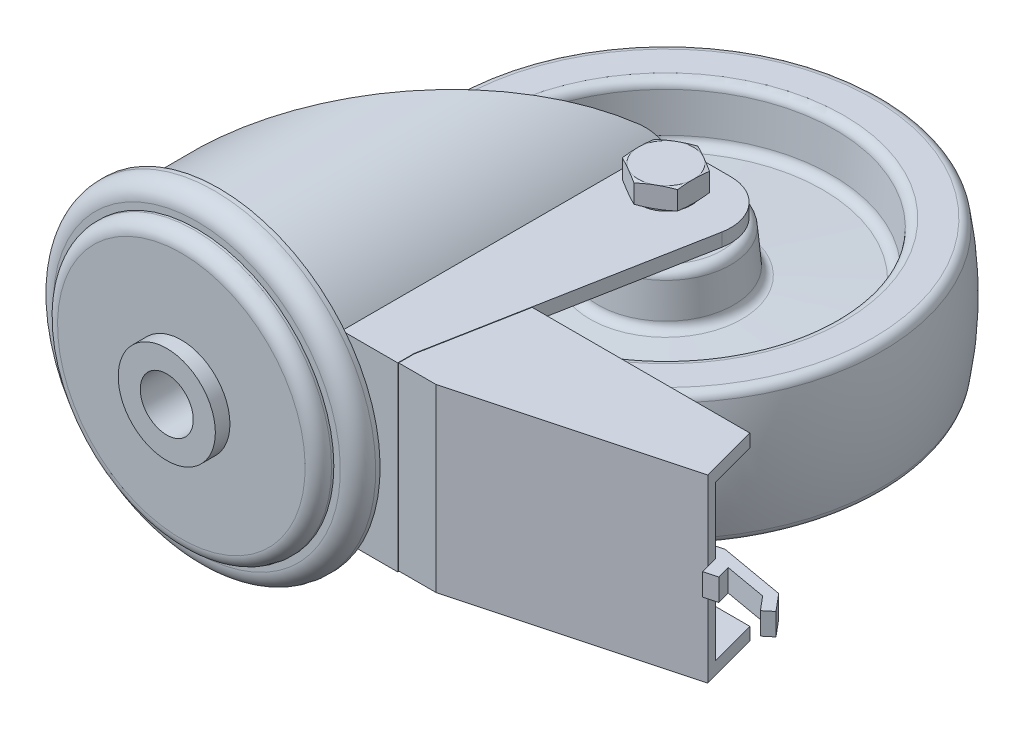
ISO-10303-21;
HEADER;
FILE_DESCRIPTION(('STEP AP214'),'2;1');
FILE_NAME('part.step','',(''),(''),'','','');
FILE_SCHEMA(('AUTOMOTIVE_DESIGN { 1 0 10303 214 1 1 1 1 }'));
ENDSEC;
DATA;
#1=APPLICATION_CONTEXT('core data for automotive mechanical design processes');
#2=APPLICATION_PROTOCOL_DEFINITION('international standard','automotive_design',2000,#1);
#3=PRODUCT_CONTEXT('',#1,'mechanical');
#4=PRODUCT('Part','Part','',(#3));
#5=PRODUCT_RELATED_PRODUCT_CATEGORY('part','',(#4));
#6=PRODUCT_DEFINITION_FORMATION('','',#4);
#7=PRODUCT_DEFINITION_CONTEXT('part definition',#1,'design');
#8=PRODUCT_DEFINITION('design','',#6,#7);
#9=PRODUCT_DEFINITION_SHAPE('','',#8);
#10=(LENGTH_UNIT() NAMED_UNIT(*) SI_UNIT(.MILLI.,.METRE.));
#11=(NAMED_UNIT(*) PLANE_ANGLE_UNIT() SI_UNIT($,.RADIAN.));
#12=(NAMED_UNIT(*) SI_UNIT($,.STERADIAN.) SOLID_ANGLE_UNIT());
#13=UNCERTAINTY_MEASURE_WITH_UNIT(LENGTH_MEASURE(1.E-05),#10,'distance_accuracy_value','');
#14=(GEOMETRIC_REPRESENTATION_CONTEXT(3) GLOBAL_UNCERTAINTY_ASSIGNED_CONTEXT((#13)) GLOBAL_UNIT_ASSIGNED_CONTEXT((#10,
#11,#12)) REPRESENTATION_CONTEXT('',''));
#15=CARTESIAN_POINT('',(0.,0.,0.));
#16=DIRECTION('',(0.,0.,1.));
#17=DIRECTION('',(1.,0.,0.));
#18=AXIS2_PLACEMENT_3D('',#15,#16,#17);
#19=CARTESIAN_POINT('',(55.,20.5,-13.8));
#20=DIRECTION('',(0.,1.,0.));
#21=DIRECTION('',(-1.,0.,0.));
#22=AXIS2_PLACEMENT_3D('',#19,#20,#21);
#23=PLANE('',#22);
#24=CARTESIAN_POINT('',(35.,20.5,-78.));
#25=DIRECTION('',(0.,-1.,0.));
#26=DIRECTION('',(-1.,0.,0.));
#27=AXIS2_PLACEMENT_3D('',#24,#25,#26);
#28=CIRCLE('',#27,5.815);
#29=CARTESIAN_POINT('',(29.185,20.5,-78.));
#30=VERTEX_POINT('',#29);
#31=EDGE_CURVE('E23',#30,#30,#28,.F.);
#32=ORIENTED_EDGE('',*,*,#31,.F.);
#33=EDGE_LOOP('',(#32));
#34=FACE_BOUND('',#33,.T.);
#35=DIRECTION('',(-1.,0.,0.));
#36=VECTOR('',#35,1.);
#37=CARTESIAN_POINT('',(55.,20.5,-88.));
#38=LINE('',#37,#36);
#39=CARTESIAN_POINT('',(39.7,20.5,-88.));
#40=VERTEX_POINT('',#39);
#41=CARTESIAN_POINT('',(30.3,20.5,-88.));
#42=VERTEX_POINT('',#41);
#43=EDGE_CURVE('E1229',#40,#42,#38,.T.);
#44=ORIENTED_EDGE('',*,*,#43,.T.);
#45=CARTESIAN_POINT('',(30.2999999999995,20.5,-78.0000000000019));
#46=DIRECTION('',(0.,1.,0.));
#47=DIRECTION('',(-1.,0.,0.));
#48=AXIS2_PLACEMENT_3D('',#45,#46,#47);
#49=CIRCLE('',#48,9.99999999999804);
#50=CARTESIAN_POINT('',(25.8602010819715,20.5,-86.9603674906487));
#51=VERTEX_POINT('',#50);
#52=EDGE_CURVE('E1232',#42,#51,#49,.T.);
#53=ORIENTED_EDGE('',*,*,#52,.T.);
#54=DIRECTION('',(0.,0.,1.));
#55=VECTOR('',#54,1.);
#56=CARTESIAN_POINT('',(25.8602010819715,20.5,-88.));
#57=LINE('',#56,#55);
#58=CARTESIAN_POINT('',(25.8602010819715,20.5,-13.8));
#59=VERTEX_POINT('',#58);
#60=EDGE_CURVE('E3383',#51,#59,#57,.T.);
#61=ORIENTED_EDGE('',*,*,#60,.T.);
#62=DIRECTION('',(1.,0.,0.));
#63=VECTOR('',#62,1.);
#64=CARTESIAN_POINT('',(0.,20.5,-13.8));
#65=LINE('',#64,#63);
#66=CARTESIAN_POINT('',(38.5,20.5,-13.8));
#67=VERTEX_POINT('',#66);
#68=EDGE_CURVE('E3389',#59,#67,#65,.T.);
#69=ORIENTED_EDGE('',*,*,#68,.T.);
#70=DIRECTION('',(0.,0.,-1.));
#71=VECTOR('',#70,1.);
#72=CARTESIAN_POINT('',(38.5,20.5,-13.8));
#73=LINE('',#72,#71);
#74=CARTESIAN_POINT('',(38.5,20.5,-17.5));
#75=VERTEX_POINT('',#74);
#76=EDGE_CURVE('E1220',#67,#75,#73,.T.);
#77=ORIENTED_EDGE('',*,*,#76,.T.);
#78=DIRECTION('',(0.184782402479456,0.,-0.982779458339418));
#79=VECTOR('',#78,1.);
#80=CARTESIAN_POINT('',(38.3914635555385,20.5,-16.9227405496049));
#81=LINE('',#80,#79);
#82=CARTESIAN_POINT('',(49.527794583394,20.5,-76.1521759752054));
#83=VERTEX_POINT('',#82);
#84=EDGE_CURVE('E1223',#75,#83,#81,.T.);
#85=ORIENTED_EDGE('',*,*,#84,.T.);
#86=CARTESIAN_POINT('',(39.7,20.5,-78.));
#87=DIRECTION('',(0.,1.,0.));
#88=DIRECTION('',(-1.,0.,0.));
#89=AXIS2_PLACEMENT_3D('',#86,#87,#88);
#90=CIRCLE('',#89,9.99999999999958);
#91=EDGE_CURVE('E1226',#83,#40,#90,.T.);
#92=ORIENTED_EDGE('',*,*,#91,.T.);
#93=EDGE_LOOP('',(#44,#53,#61,#69,#77,#85,#92));
#94=FACE_BOUND('',#93,.T.);
#95=ADVANCED_FACE('F14',(#34,#94),#23,.T.);
#96=CARTESIAN_POINT('',(35.,0.,-78.));
#97=DIRECTION('',(0.,1.,0.));
#98=DIRECTION('',(-1.,0.,0.));
#99=AXIS2_PLACEMENT_3D('',#96,#97,#98);
#100=DEGENERATE_TOROIDAL_SURFACE('',#99,30.000000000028,80.000000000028,.F.);
#101=CARTESIAN_POINT('',(35.,-13.333333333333,-78.));
#102=DIRECTION('',(0.,1.,0.));
#103=DIRECTION('',(-1.,0.,0.));
#104=AXIS2_PLACEMENT_3D('',#101,#102,#103);
#105=CIRCLE('',#104,48.881063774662);
#106=CARTESIAN_POINT('',(-13.881063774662,-13.333333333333,-78.));
#107=VERTEX_POINT('',#106);
#108=EDGE_CURVE('E955',#107,#107,#105,.T.);
#109=ORIENTED_EDGE('',*,*,#108,.T.);
#110=EDGE_LOOP('',(#109));
#111=FACE_BOUND('',#110,.T.);
#112=CARTESIAN_POINT('',(35.,13.333333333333,-78.));
#113=DIRECTION('',(0.,1.,0.));
#114=DIRECTION('',(-1.,0.,0.));
#115=AXIS2_PLACEMENT_3D('',#112,#113,#114);
#116=CIRCLE('',#115,48.881063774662);
#117=CARTESIAN_POINT('',(-13.881063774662,13.333333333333,-78.));
#118=VERTEX_POINT('',#117);
#119=EDGE_CURVE('E958',#118,#118,#116,.T.);
#120=ORIENTED_EDGE('',*,*,#119,.F.);
#121=EDGE_LOOP('',(#120));
#122=FACE_BOUND('',#121,.T.);
#123=ADVANCED_FACE('F830',(#111,#122),#100,.F.);
#124=CARTESIAN_POINT('',(35.,-12.9999999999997,-78.));
#125=DIRECTION('',(0.,1.,0.));
#126=DIRECTION('',(-1.,0.,0.));
#127=AXIS2_PLACEMENT_3D('',#124,#125,#126);
#128=TOROIDAL_SURFACE('',#127,46.9090371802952,2.0000000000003);
#129=CARTESIAN_POINT('',(35.,-15.,-78.));
#130=DIRECTION('',(0.,1.,0.));
#131=DIRECTION('',(-1.,0.,0.));
#132=AXIS2_PLACEMENT_3D('',#129,#130,#131);
#133=CIRCLE('',#132,46.909037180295);
#134=CARTESIAN_POINT('',(-11.909037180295,-15.,-78.));
#135=VERTEX_POINT('',#134);
#136=EDGE_CURVE('E576',#135,#135,#133,.T.);
#137=ORIENTED_EDGE('',*,*,#136,.T.);
#138=EDGE_LOOP('',(#137));
#139=FACE_BOUND('',#138,.T.);
#140=ORIENTED_EDGE('',*,*,#108,.F.);
#141=EDGE_LOOP('',(#140));
#142=FACE_BOUND('',#141,.T.);
#143=ADVANCED_FACE('F826',(#139,#142),#128,.T.);
#144=CARTESIAN_POINT('',(-9.,-15.,-78.));
#145=DIRECTION('',(0.,-1.,0.));
#146=DIRECTION('',(1.,0.,0.));
#147=AXIS2_PLACEMENT_3D('',#144,#145,#146);
#148=PLANE('',#147);
#149=CARTESIAN_POINT('',(35.,-15.,-78.));
#150=DIRECTION('',(0.,1.,0.));
#151=DIRECTION('',(-1.,0.,0.));
#152=AXIS2_PLACEMENT_3D('',#149,#150,#151);
#153=CIRCLE('',#152,40.332662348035);
#154=CARTESIAN_POINT('',(-5.332662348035,-15.,-78.));
#155=VERTEX_POINT('',#154);
#156=EDGE_CURVE('E988',#155,#155,#153,.T.);
#157=ORIENTED_EDGE('',*,*,#156,.T.);
#158=EDGE_LOOP('',(#157));
#159=FACE_BOUND('',#158,.T.);
#160=ORIENTED_EDGE('',*,*,#136,.F.);
#161=EDGE_LOOP('',(#160));
#162=FACE_BOUND('',#161,.T.);
#163=ADVANCED_FACE('F829',(#159,#162),#148,.T.);
#164=CARTESIAN_POINT('',(35.,-12.999999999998,-78.));
#165=DIRECTION('',(0.,1.,0.));
#166=DIRECTION('',(-1.,0.,0.));
#167=AXIS2_PLACEMENT_3D('',#164,#165,#166);
#168=TOROIDAL_SURFACE('',#167,40.3326623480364,2.00000000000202);
#169=CARTESIAN_POINT('',(35.,-13.174311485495,-78.));
#170=DIRECTION('',(0.,1.,0.));
#171=DIRECTION('',(-1.,0.,0.));
#172=AXIS2_PLACEMENT_3D('',#169,#170,#171);
#173=CIRCLE('',#172,38.340272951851);
#174=CARTESIAN_POINT('',(-3.340272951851,-13.174311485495,-78.));
#175=VERTEX_POINT('',#174);
#176=EDGE_CURVE('E985',#175,#175,#173,.T.);
#177=ORIENTED_EDGE('',*,*,#176,.T.);
#178=EDGE_LOOP('',(#177));
#179=FACE_BOUND('',#178,.T.);
#180=ORIENTED_EDGE('',*,*,#156,.F.);
#181=EDGE_LOOP('',(#180));
#182=FACE_BOUND('',#181,.T.);
#183=ADVANCED_FACE('F869',(#179,#182),#168,.T.);
#184=CARTESIAN_POINT('',(35.,-13.174311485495,-78.));
#185=DIRECTION('',(0.,-1.,0.));
#186=DIRECTION('',(1.,0.,0.));
#187=AXIS2_PLACEMENT_3D('',#184,#185,#186);
#188=CONICAL_SURFACE('',#187,38.340272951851,0.0872664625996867);
#189=CARTESIAN_POINT('',(35.,-4.6824572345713,-78.));
#190=DIRECTION('',(0.,1.,0.));
#191=DIRECTION('',(-1.,0.,0.));
#192=AXIS2_PLACEMENT_3D('',#189,#190,#191);
#193=CIRCLE('',#192,37.597331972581);
#194=CARTESIAN_POINT('',(-2.597331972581,-4.6824572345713,-78.));
#195=VERTEX_POINT('',#194);
#196=EDGE_CURVE('E982',#195,#195,#193,.T.);
#197=ORIENTED_EDGE('',*,*,#196,.T.);
#198=EDGE_LOOP('',(#197));
#199=FACE_BOUND('',#198,.T.);
#200=ORIENTED_EDGE('',*,*,#176,.F.);
#201=EDGE_LOOP('',(#200));
#202=FACE_BOUND('',#201,.T.);
#203=ADVANCED_FACE('F865',(#199,#202),#188,.F.);
#204=CARTESIAN_POINT('',(35.,-4.85676872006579,-78.));
#205=DIRECTION('',(0.,1.,0.));
#206=DIRECTION('',(-1.,0.,0.));
#207=AXIS2_PLACEMENT_3D('',#204,#205,#206);
#208=TOROIDAL_SURFACE('',#207,35.6049425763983,1.99999999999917);
#209=CARTESIAN_POINT('',(35.,-2.85950965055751,-78.));
#210=DIRECTION('',(0.,1.,0.));
#211=DIRECTION('',(-1.,0.,0.));
#212=AXIS2_PLACEMENT_3D('',#209,#210,#211);
#213=CIRCLE('',#212,35.500270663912);
#214=CARTESIAN_POINT('',(-0.500270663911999,-2.85950965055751,-78.));
#215=VERTEX_POINT('',#214);
#216=EDGE_CURVE('E979',#215,#215,#213,.T.);
#217=ORIENTED_EDGE('',*,*,#216,.T.);
#218=EDGE_LOOP('',(#217));
#219=FACE_BOUND('',#218,.T.);
#220=ORIENTED_EDGE('',*,*,#196,.F.);
#221=EDGE_LOOP('',(#220));
#222=FACE_BOUND('',#221,.T.);
#223=ADVANCED_FACE('F861',(#219,#222),#208,.F.);
#224=CARTESIAN_POINT('',(35.,-2.85950965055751,-78.));
#225=DIRECTION('',(0.,1.,0.));
#226=DIRECTION('',(-1.,0.,0.));
#227=AXIS2_PLACEMENT_3D('',#224,#225,#226);
#228=CONICAL_SURFACE('',#227,35.500270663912,1.51843644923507);
#229=CARTESIAN_POINT('',(35.,-3.8182451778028,-78.));
#230=DIRECTION('',(0.,1.,0.));
#231=DIRECTION('',(-1.,0.,0.));
#232=AXIS2_PLACEMENT_3D('',#229,#230,#231);
#233=CIRCLE('',#232,17.206507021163);
#234=CARTESIAN_POINT('',(17.793492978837,-3.8182451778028,-78.));
#235=VERTEX_POINT('',#234);
#236=EDGE_CURVE('E976',#235,#235,#233,.T.);
#237=ORIENTED_EDGE('',*,*,#236,.T.);
#238=EDGE_LOOP('',(#237));
#239=FACE_BOUND('',#238,.T.);
#240=ORIENTED_EDGE('',*,*,#216,.F.);
#241=EDGE_LOOP('',(#240));
#242=FACE_BOUND('',#241,.T.);
#243=ADVANCED_FACE('F857',(#239,#242),#228,.T.);
#244=CARTESIAN_POINT('',(35.,-5.81550424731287,-78.));
#245=DIRECTION('',(0.,1.,0.));
#246=DIRECTION('',(-1.,0.,0.));
#247=AXIS2_PLACEMENT_3D('',#244,#245,#246);
#248=TOROIDAL_SURFACE('',#247,17.3111789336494,2.00000000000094);
#249=CARTESIAN_POINT('',(35.,-5.6411927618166,-78.));
#250=DIRECTION('',(0.,1.,0.));
#251=DIRECTION('',(-1.,0.,0.));
#252=AXIS2_PLACEMENT_3D('',#249,#250,#251);
#253=CIRCLE('',#252,15.318789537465);
#254=CARTESIAN_POINT('',(19.681210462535,-5.6411927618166,-78.));
#255=VERTEX_POINT('',#254);
#256=EDGE_CURVE('E973',#255,#255,#253,.T.);
#257=ORIENTED_EDGE('',*,*,#256,.T.);
#258=EDGE_LOOP('',(#257));
#259=FACE_BOUND('',#258,.T.);
#260=ORIENTED_EDGE('',*,*,#236,.F.);
#261=EDGE_LOOP('',(#260));
#262=FACE_BOUND('',#261,.T.);
#263=ADVANCED_FACE('F853',(#259,#262),#248,.F.);
#264=CARTESIAN_POINT('',(35.,-5.6411927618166,-78.));
#265=DIRECTION('',(0.,1.,0.));
#266=DIRECTION('',(-1.,0.,0.));
#267=AXIS2_PLACEMENT_3D('',#264,#265,#266);
#268=CONICAL_SURFACE('',#267,15.318789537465,0.0872664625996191);
#269=CARTESIAN_POINT('',(35.,-13.174311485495,-78.));
#270=DIRECTION('',(0.,1.,0.));
#271=DIRECTION('',(-1.,0.,0.));
#272=AXIS2_PLACEMENT_3D('',#269,#270,#271);
#273=CIRCLE('',#272,14.659727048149);
#274=CARTESIAN_POINT('',(20.340272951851,-13.174311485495,-78.));
#275=VERTEX_POINT('',#274);
#276=EDGE_CURVE('E970',#275,#275,#273,.T.);
#277=ORIENTED_EDGE('',*,*,#276,.T.);
#278=EDGE_LOOP('',(#277));
#279=FACE_BOUND('',#278,.T.);
#280=ORIENTED_EDGE('',*,*,#256,.F.);
#281=EDGE_LOOP('',(#280));
#282=FACE_BOUND('',#281,.T.);
#283=ADVANCED_FACE('F849',(#279,#282),#268,.T.);
#284=CARTESIAN_POINT('',(35.,-12.999999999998,-78.));
#285=DIRECTION('',(0.,1.,0.));
#286=DIRECTION('',(-1.,0.,0.));
#287=AXIS2_PLACEMENT_3D('',#284,#285,#286);
#288=TOROIDAL_SURFACE('',#287,12.6673376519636,2.00000000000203);
#289=CARTESIAN_POINT('',(35.,-15.,-78.));
#290=DIRECTION('',(0.,1.,0.));
#291=DIRECTION('',(-1.,0.,0.));
#292=AXIS2_PLACEMENT_3D('',#289,#290,#291);
#293=CIRCLE('',#292,12.667337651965);
#294=CARTESIAN_POINT('',(22.332662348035,-15.,-78.));
#295=VERTEX_POINT('',#294);
#296=EDGE_CURVE('E967',#295,#295,#293,.T.);
#297=ORIENTED_EDGE('',*,*,#296,.T.);
#298=EDGE_LOOP('',(#297));
#299=FACE_BOUND('',#298,.T.);
#300=ORIENTED_EDGE('',*,*,#276,.F.);
#301=EDGE_LOOP('',(#300));
#302=FACE_BOUND('',#301,.T.);
#303=ADVANCED_FACE('F845',(#299,#302),#288,.T.);
#304=CARTESIAN_POINT('',(22.332662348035,-15.,-78.));
#305=DIRECTION('',(0.,-1.,0.));
#306=DIRECTION('',(1.,0.,0.));
#307=AXIS2_PLACEMENT_3D('',#304,#305,#306);
#308=PLANE('',#307);
#309=CARTESIAN_POINT('',(35.,-15.,-78.));
#310=DIRECTION('',(0.,1.,0.));
#311=DIRECTION('',(-1.,0.,0.));
#312=AXIS2_PLACEMENT_3D('',#309,#310,#311);
#313=CIRCLE('',#312,6.);
#314=CARTESIAN_POINT('',(29.,-15.,-78.));
#315=VERTEX_POINT('',#314);
#316=EDGE_CURVE('E964',#315,#315,#313,.T.);
#317=ORIENTED_EDGE('',*,*,#316,.T.);
#318=EDGE_LOOP('',(#317));
#319=FACE_BOUND('',#318,.T.);
#320=ORIENTED_EDGE('',*,*,#296,.F.);
#321=EDGE_LOOP('',(#320));
#322=FACE_BOUND('',#321,.T.);
#323=ADVANCED_FACE('F842',(#319,#322),#308,.T.);
#324=CARTESIAN_POINT('',(35.,-17.5,-78.));
#325=DIRECTION('',(0.,1.,0.));
#326=DIRECTION('',(1.,0.,0.));
#327=AXIS2_PLACEMENT_3D('',#324,#325,#326);
#328=CYLINDRICAL_SURFACE('',#327,6.);
#329=CARTESIAN_POINT('',(35.,-17.5,-78.));
#330=DIRECTION('',(0.,1.,0.));
#331=DIRECTION('',(-1.,0.,0.));
#332=AXIS2_PLACEMENT_3D('',#329,#330,#331);
#333=CIRCLE('',#332,6.);
#334=CARTESIAN_POINT('',(29.,-17.5,-78.));
#335=VERTEX_POINT('',#334);
#336=EDGE_CURVE('E942',#335,#335,#333,.F.);
#337=ORIENTED_EDGE('',*,*,#336,.F.);
#338=EDGE_LOOP('',(#337));
#339=FACE_BOUND('',#338,.T.);
#340=ORIENTED_EDGE('',*,*,#316,.F.);
#341=EDGE_LOOP('',(#340));
#342=FACE_BOUND('',#341,.T.);
#343=ADVANCED_FACE('F840',(#339,#342),#328,.T.);
#344=CARTESIAN_POINT('',(35.,12.9999999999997,-78.));
#345=DIRECTION('',(0.,1.,0.));
#346=DIRECTION('',(-1.,0.,0.));
#347=AXIS2_PLACEMENT_3D('',#344,#345,#346);
#348=TOROIDAL_SURFACE('',#347,46.9090371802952,2.0000000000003);
#349=ORIENTED_EDGE('',*,*,#119,.T.);
#350=EDGE_LOOP('',(#349));
#351=FACE_BOUND('',#350,.T.);
#352=CARTESIAN_POINT('',(35.,15.,-78.));
#353=DIRECTION('',(0.,1.,0.));
#354=DIRECTION('',(-1.,0.,0.));
#355=AXIS2_PLACEMENT_3D('',#352,#353,#354);
#356=CIRCLE('',#355,46.909037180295);
#357=CARTESIAN_POINT('',(-11.909037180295,15.,-78.));
#358=VERTEX_POINT('',#357);
#359=EDGE_CURVE('E961',#358,#358,#356,.T.);
#360=ORIENTED_EDGE('',*,*,#359,.F.);
#361=EDGE_LOOP('',(#360));
#362=FACE_BOUND('',#361,.T.);
#363=ADVANCED_FACE('F836',(#351,#362),#348,.T.);
#364=CARTESIAN_POINT('',(-5.332662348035,15.,-78.));
#365=DIRECTION('',(0.,1.,0.));
#366=DIRECTION('',(-1.,0.,0.));
#367=AXIS2_PLACEMENT_3D('',#364,#365,#366);
#368=PLANE('',#367);
#369=ORIENTED_EDGE('',*,*,#359,.T.);
#370=EDGE_LOOP('',(#369));
#371=FACE_BOUND('',#370,.T.);
#372=CARTESIAN_POINT('',(35.,15.,-78.));
#373=DIRECTION('',(0.,1.,0.));
#374=DIRECTION('',(-1.,0.,0.));
#375=AXIS2_PLACEMENT_3D('',#372,#373,#374);
#376=CIRCLE('',#375,40.332662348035);
#377=CARTESIAN_POINT('',(-5.332662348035,15.,-78.));
#378=VERTEX_POINT('',#377);
#379=EDGE_CURVE('E991',#378,#378,#376,.T.);
#380=ORIENTED_EDGE('',*,*,#379,.F.);
#381=EDGE_LOOP('',(#380));
#382=FACE_BOUND('',#381,.T.);
#383=ADVANCED_FACE('F839',(#371,#382),#368,.T.);
#384=CARTESIAN_POINT('',(35.,12.999999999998,-78.));
#385=DIRECTION('',(0.,1.,0.));
#386=DIRECTION('',(-1.,0.,0.));
#387=AXIS2_PLACEMENT_3D('',#384,#385,#386);
#388=TOROIDAL_SURFACE('',#387,40.3326623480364,2.00000000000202);
#389=ORIENTED_EDGE('',*,*,#379,.T.);
#390=EDGE_LOOP('',(#389));
#391=FACE_BOUND('',#390,.T.);
#392=CARTESIAN_POINT('',(35.,13.174311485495,-78.));
#393=DIRECTION('',(0.,1.,0.));
#394=DIRECTION('',(-1.,0.,0.));
#395=AXIS2_PLACEMENT_3D('',#392,#393,#394);
#396=CIRCLE('',#395,38.340272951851);
#397=CARTESIAN_POINT('',(-3.340272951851,13.174311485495,-78.));
#398=VERTEX_POINT('',#397);
#399=EDGE_CURVE('E994',#398,#398,#396,.T.);
#400=ORIENTED_EDGE('',*,*,#399,.F.);
#401=EDGE_LOOP('',(#400));
#402=FACE_BOUND('',#401,.T.);
#403=ADVANCED_FACE('F879',(#391,#402),#388,.T.);
#404=CARTESIAN_POINT('',(35.,4.6824572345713,-78.));
#405=DIRECTION('',(0.,1.,0.));
#406=DIRECTION('',(-1.,0.,0.));
#407=AXIS2_PLACEMENT_3D('',#404,#405,#406);
#408=CONICAL_SURFACE('',#407,37.597331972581,0.0872664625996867);
#409=ORIENTED_EDGE('',*,*,#399,.T.);
#410=EDGE_LOOP('',(#409));
#411=FACE_BOUND('',#410,.T.);
#412=CARTESIAN_POINT('',(35.,4.6824572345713,-78.));
#413=DIRECTION('',(0.,1.,0.));
#414=DIRECTION('',(-1.,0.,0.));
#415=AXIS2_PLACEMENT_3D('',#412,#413,#414);
#416=CIRCLE('',#415,37.597331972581);
#417=CARTESIAN_POINT('',(-2.597331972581,4.6824572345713,-78.));
#418=VERTEX_POINT('',#417);
#419=EDGE_CURVE('E997',#418,#418,#416,.T.);
#420=ORIENTED_EDGE('',*,*,#419,.F.);
#421=EDGE_LOOP('',(#420));
#422=FACE_BOUND('',#421,.T.);
#423=ADVANCED_FACE('F883',(#411,#422),#408,.F.);
#424=CARTESIAN_POINT('',(35.,4.85676872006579,-78.));
#425=DIRECTION('',(0.,1.,0.));
#426=DIRECTION('',(-1.,0.,0.));
#427=AXIS2_PLACEMENT_3D('',#424,#425,#426);
#428=TOROIDAL_SURFACE('',#427,35.6049425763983,1.99999999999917);
#429=ORIENTED_EDGE('',*,*,#419,.T.);
#430=EDGE_LOOP('',(#429));
#431=FACE_BOUND('',#430,.T.);
#432=CARTESIAN_POINT('',(35.,2.8595096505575,-78.));
#433=DIRECTION('',(0.,1.,0.));
#434=DIRECTION('',(-1.,0.,0.));
#435=AXIS2_PLACEMENT_3D('',#432,#433,#434);
#436=CIRCLE('',#435,35.500270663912);
#437=CARTESIAN_POINT('',(-0.500270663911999,2.8595096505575,-78.));
#438=VERTEX_POINT('',#437);
#439=EDGE_CURVE('E1000',#438,#438,#436,.T.);
#440=ORIENTED_EDGE('',*,*,#439,.F.);
#441=EDGE_LOOP('',(#440));
#442=FACE_BOUND('',#441,.T.);
#443=ADVANCED_FACE('F887',(#431,#442),#428,.F.);
#444=CARTESIAN_POINT('',(35.,3.8182451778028,-78.));
#445=DIRECTION('',(0.,-1.,0.));
#446=DIRECTION('',(1.,0.,0.));
#447=AXIS2_PLACEMENT_3D('',#444,#445,#446);
#448=CONICAL_SURFACE('',#447,17.206507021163,1.51843644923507);
#449=ORIENTED_EDGE('',*,*,#439,.T.);
#450=EDGE_LOOP('',(#449));
#451=FACE_BOUND('',#450,.T.);
#452=CARTESIAN_POINT('',(35.,3.8182451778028,-78.));
#453=DIRECTION('',(0.,1.,0.));
#454=DIRECTION('',(-1.,0.,0.));
#455=AXIS2_PLACEMENT_3D('',#452,#453,#454);
#456=CIRCLE('',#455,17.206507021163);
#457=CARTESIAN_POINT('',(17.793492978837,3.8182451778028,-78.));
#458=VERTEX_POINT('',#457);
#459=EDGE_CURVE('E1003',#458,#458,#456,.T.);
#460=ORIENTED_EDGE('',*,*,#459,.F.);
#461=EDGE_LOOP('',(#460));
#462=FACE_BOUND('',#461,.T.);
#463=ADVANCED_FACE('F891',(#451,#462),#448,.T.);
#464=CARTESIAN_POINT('',(35.,5.81550424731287,-78.));
#465=DIRECTION('',(0.,1.,0.));
#466=DIRECTION('',(-1.,0.,0.));
#467=AXIS2_PLACEMENT_3D('',#464,#465,#466);
#468=TOROIDAL_SURFACE('',#467,17.3111789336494,2.00000000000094);
#469=ORIENTED_EDGE('',*,*,#459,.T.);
#470=EDGE_LOOP('',(#469));
#471=FACE_BOUND('',#470,.T.);
#472=CARTESIAN_POINT('',(35.,5.6411927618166,-78.));
#473=DIRECTION('',(0.,1.,0.));
#474=DIRECTION('',(-1.,0.,0.));
#475=AXIS2_PLACEMENT_3D('',#472,#473,#474);
#476=CIRCLE('',#475,15.318789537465);
#477=CARTESIAN_POINT('',(19.681210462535,5.6411927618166,-78.));
#478=VERTEX_POINT('',#477);
#479=EDGE_CURVE('E1006',#478,#478,#476,.T.);
#480=ORIENTED_EDGE('',*,*,#479,.F.);
#481=EDGE_LOOP('',(#480));
#482=FACE_BOUND('',#481,.T.);
#483=ADVANCED_FACE('F895',(#471,#482),#468,.F.);
#484=CARTESIAN_POINT('',(35.,13.174311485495,-78.));
#485=DIRECTION('',(0.,-1.,0.));
#486=DIRECTION('',(1.,0.,0.));
#487=AXIS2_PLACEMENT_3D('',#484,#485,#486);
#488=CONICAL_SURFACE('',#487,14.659727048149,0.0872664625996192);
#489=ORIENTED_EDGE('',*,*,#479,.T.);
#490=EDGE_LOOP('',(#489));
#491=FACE_BOUND('',#490,.T.);
#492=CARTESIAN_POINT('',(35.,13.174311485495,-78.));
#493=DIRECTION('',(0.,1.,0.));
#494=DIRECTION('',(-1.,0.,0.));
#495=AXIS2_PLACEMENT_3D('',#492,#493,#494);
#496=CIRCLE('',#495,14.659727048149);
#497=CARTESIAN_POINT('',(20.340272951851,13.174311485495,-78.));
#498=VERTEX_POINT('',#497);
#499=EDGE_CURVE('E1009',#498,#498,#496,.T.);
#500=ORIENTED_EDGE('',*,*,#499,.F.);
#501=EDGE_LOOP('',(#500));
#502=FACE_BOUND('',#501,.T.);
#503=ADVANCED_FACE('F899',(#491,#502),#488,.T.);
#504=CARTESIAN_POINT('',(35.,12.999999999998,-78.));
#505=DIRECTION('',(0.,1.,0.));
#506=DIRECTION('',(-1.,0.,0.));
#507=AXIS2_PLACEMENT_3D('',#504,#505,#506);
#508=TOROIDAL_SURFACE('',#507,12.6673376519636,2.00000000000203);
#509=ORIENTED_EDGE('',*,*,#499,.T.);
#510=EDGE_LOOP('',(#509));
#511=FACE_BOUND('',#510,.T.);
#512=CARTESIAN_POINT('',(35.,15.,-78.));
#513=DIRECTION('',(0.,1.,0.));
#514=DIRECTION('',(-1.,0.,0.));
#515=AXIS2_PLACEMENT_3D('',#512,#513,#514);
#516=CIRCLE('',#515,12.667337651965);
#517=CARTESIAN_POINT('',(22.332662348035,15.,-78.));
#518=VERTEX_POINT('',#517);
#519=EDGE_CURVE('E1012',#518,#518,#516,.T.);
#520=ORIENTED_EDGE('',*,*,#519,.F.);
#521=EDGE_LOOP('',(#520));
#522=FACE_BOUND('',#521,.T.);
#523=ADVANCED_FACE('F903',(#511,#522),#508,.T.);
#524=CARTESIAN_POINT('',(29.,15.,-78.));
#525=DIRECTION('',(0.,1.,0.));
#526=DIRECTION('',(-1.,0.,0.));
#527=AXIS2_PLACEMENT_3D('',#524,#525,#526);
#528=PLANE('',#527);
#529=ORIENTED_EDGE('',*,*,#519,.T.);
#530=EDGE_LOOP('',(#529));
#531=FACE_BOUND('',#530,.T.);
#532=CARTESIAN_POINT('',(35.,15.,-78.));
#533=DIRECTION('',(0.,1.,0.));
#534=DIRECTION('',(-1.,0.,0.));
#535=AXIS2_PLACEMENT_3D('',#532,#533,#534);
#536=CIRCLE('',#535,6.);
#537=CARTESIAN_POINT('',(29.,15.,-78.));
#538=VERTEX_POINT('',#537);
#539=EDGE_CURVE('E1014',#538,#538,#536,.T.);
#540=ORIENTED_EDGE('',*,*,#539,.F.);
#541=EDGE_LOOP('',(#540));
#542=FACE_BOUND('',#541,.T.);
#543=ADVANCED_FACE('F907',(#531,#542),#528,.T.);
#544=CARTESIAN_POINT('',(35.,17.5,-78.));
#545=DIRECTION('',(0.,-1.,0.));
#546=DIRECTION('',(1.,0.,0.));
#547=AXIS2_PLACEMENT_3D('',#544,#545,#546);
#548=CIRCLE('',#547,6.);
#549=CARTESIAN_POINT('',(41.,17.5,-78.));
#550=VERTEX_POINT('',#549);
#551=EDGE_CURVE('E9',#550,#550,#548,.F.);
#552=ORIENTED_EDGE('',*,*,#551,.F.);
#553=EDGE_LOOP('',(#552));
#554=FACE_BOUND('',#553,.T.);
#555=ORIENTED_EDGE('',*,*,#539,.T.);
#556=EDGE_LOOP('',(#555));
#557=FACE_BOUND('',#556,.T.);
#558=ADVANCED_FACE('F543',(#554,#557),#328,.T.);
#559=CARTESIAN_POINT('',(35.,-31.5,-81.233));
#560=DIRECTION('',(0.,-1.,0.));
#561=DIRECTION('',(-1.,0.,0.));
#562=AXIS2_PLACEMENT_3D('',#559,#560,#561);
#563=PLANE('',#562);
#564=CARTESIAN_POINT('',(35.,-31.5,-78.));
#565=DIRECTION('',(0.,1.,0.));
#566=DIRECTION('',(1.,0.,0.));
#567=AXIS2_PLACEMENT_3D('',#564,#565,#566);
#568=CIRCLE('',#567,3.233);
#569=CARTESIAN_POINT('',(38.233,-31.5,-78.));
#570=VERTEX_POINT('',#569);
#571=EDGE_CURVE('E1474',#570,#570,#568,.T.);
#572=ORIENTED_EDGE('',*,*,#571,.F.);
#573=EDGE_LOOP('',(#572));
#574=FACE_BOUND('',#573,.T.);
#575=ADVANCED_FACE('F773',(#574),#563,.T.);
#576=CARTESIAN_POINT('',(35.,-30.733,-78.));
#577=DIRECTION('',(0.,1.,0.));
#578=DIRECTION('',(1.,0.,0.));
#579=AXIS2_PLACEMENT_3D('',#576,#577,#578);
#580=CONICAL_SURFACE('',#579,4.,0.78539816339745);
#581=ORIENTED_EDGE('',*,*,#571,.T.);
#582=EDGE_LOOP('',(#581));
#583=FACE_BOUND('',#582,.T.);
#584=CARTESIAN_POINT('',(35.,-30.733,-78.));
#585=DIRECTION('',(0.,1.,0.));
#586=DIRECTION('',(1.,0.,0.));
#587=AXIS2_PLACEMENT_3D('',#584,#585,#586);
#588=CIRCLE('',#587,4.);
#589=CARTESIAN_POINT('',(39.,-30.733,-78.));
#590=VERTEX_POINT('',#589);
#591=EDGE_CURVE('E1471',#590,#590,#588,.T.);
#592=ORIENTED_EDGE('',*,*,#591,.F.);
#593=EDGE_LOOP('',(#592));
#594=FACE_BOUND('',#593,.T.);
#595=ADVANCED_FACE('F777',(#583,#594),#580,.T.);
#596=CARTESIAN_POINT('',(35.,-31.5,-78.));
#597=DIRECTION('',(0.,1.,0.));
#598=DIRECTION('',(1.,0.,0.));
#599=AXIS2_PLACEMENT_3D('',#596,#597,#598);
#600=CYLINDRICAL_SURFACE('',#599,4.);
#601=ORIENTED_EDGE('',*,*,#591,.T.);
#602=EDGE_LOOP('',(#601));
#603=FACE_BOUND('',#602,.T.);
#604=CARTESIAN_POINT('',(35.,-28.5,-78.));
#605=DIRECTION('',(0.,1.,0.));
#606=DIRECTION('',(1.,0.,0.));
#607=AXIS2_PLACEMENT_3D('',#604,#605,#606);
#608=CIRCLE('',#607,4.);
#609=CARTESIAN_POINT('',(39.,-28.5,-78.));
#610=VERTEX_POINT('',#609);
#611=EDGE_CURVE('E644',#610,#610,#608,.T.);
#612=ORIENTED_EDGE('',*,*,#611,.F.);
#613=EDGE_LOOP('',(#612));
#614=FACE_BOUND('',#613,.T.);
#615=ADVANCED_FACE('F781',(#603,#614),#600,.T.);
#616=CARTESIAN_POINT('',(35.,-28.5,-82.));
#617=DIRECTION('',(0.,1.,0.));
#618=DIRECTION('',(1.,0.,0.));
#619=AXIS2_PLACEMENT_3D('',#616,#617,#618);
#620=PLANE('',#619);
#621=CARTESIAN_POINT('',(35.,-28.5,-78.));
#622=DIRECTION('',(0.,1.,0.));
#623=DIRECTION('',(1.,0.,0.));
#624=AXIS2_PLACEMENT_3D('',#621,#622,#623);
#625=CIRCLE('',#624,5.815);
#626=CARTESIAN_POINT('',(40.815,-28.5,-78.));
#627=VERTEX_POINT('',#626);
#628=EDGE_CURVE('E641',#627,#627,#625,.T.);
#629=ORIENTED_EDGE('',*,*,#628,.F.);
#630=EDGE_LOOP('',(#629));
#631=FACE_BOUND('',#630,.T.);
#632=ORIENTED_EDGE('',*,*,#611,.T.);
#633=EDGE_LOOP('',(#632));
#634=FACE_BOUND('',#633,.T.);
#635=ADVANCED_FACE('F476',(#631,#634),#620,.F.);
#636=CARTESIAN_POINT('',(35.,-28.5,-78.));
#637=DIRECTION('',(0.,1.,0.));
#638=DIRECTION('',(1.,0.,0.));
#639=AXIS2_PLACEMENT_3D('',#636,#637,#638);
#640=CYLINDRICAL_SURFACE('',#639,5.815);
#641=CARTESIAN_POINT('',(35.,-26.,-78.));
#642=DIRECTION('',(0.,1.,0.));
#643=DIRECTION('',(1.,0.,0.));
#644=AXIS2_PLACEMENT_3D('',#641,#642,#643);
#645=CIRCLE('',#644,5.815);
#646=CARTESIAN_POINT('',(40.815,-26.,-78.));
#647=VERTEX_POINT('',#646);
#648=EDGE_CURVE('E632',#647,#647,#645,.T.);
#649=ORIENTED_EDGE('',*,*,#648,.F.);
#650=EDGE_LOOP('',(#649));
#651=FACE_BOUND('',#650,.T.);
#652=ORIENTED_EDGE('',*,*,#628,.T.);
#653=EDGE_LOOP('',(#652));
#654=FACE_BOUND('',#653,.T.);
#655=ADVANCED_FACE('F2102',(#651,#654),#640,.T.);
#656=CARTESIAN_POINT('',(35.,-26.,-83.815));
#657=DIRECTION('',(0.,1.,0.));
#658=DIRECTION('',(1.,0.,0.));
#659=AXIS2_PLACEMENT_3D('',#656,#657,#658);
#660=PLANE('',#659);
#661=CARTESIAN_POINT('',(35.,-26.,-78.));
#662=DIRECTION('',(0.,1.,0.));
#663=DIRECTION('',(1.,0.,0.));
#664=AXIS2_PLACEMENT_3D('',#661,#662,#663);
#665=CIRCLE('',#664,6.2583333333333);
#666=CARTESIAN_POINT('',(41.2583333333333,-26.,-78.));
#667=VERTEX_POINT('',#666);
#668=CARTESIAN_POINT('',(38.1291666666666,-26.,-83.4198756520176));
#669=VERTEX_POINT('',#668);
#670=EDGE_CURVE('E596',#667,#669,#665,.T.);
#671=ORIENTED_EDGE('',*,*,#670,.F.);
#672=CARTESIAN_POINT('',(38.1291666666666,-26.,-72.5801243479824));
#673=VERTEX_POINT('',#672);
#674=EDGE_CURVE('E633',#673,#667,#665,.T.);
#675=ORIENTED_EDGE('',*,*,#674,.F.);
#676=CARTESIAN_POINT('',(31.8708333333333,-26.,-72.5801243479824));
#677=VERTEX_POINT('',#676);
#678=EDGE_CURVE('E627',#677,#673,#665,.T.);
#679=ORIENTED_EDGE('',*,*,#678,.F.);
#680=CARTESIAN_POINT('',(28.7416666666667,-26.,-78.));
#681=VERTEX_POINT('',#680);
#682=EDGE_CURVE('E621',#681,#677,#665,.T.);
#683=ORIENTED_EDGE('',*,*,#682,.F.);
#684=CARTESIAN_POINT('',(31.8708333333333,-26.,-83.4198756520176));
#685=VERTEX_POINT('',#684);
#686=EDGE_CURVE('E625',#685,#681,#665,.T.);
#687=ORIENTED_EDGE('',*,*,#686,.F.);
#688=EDGE_CURVE('E630',#669,#685,#665,.T.);
#689=ORIENTED_EDGE('',*,*,#688,.F.);
#690=EDGE_LOOP('',(#671,#675,#679,#683,#687,#689));
#691=FACE_BOUND('',#690,.T.);
#692=ORIENTED_EDGE('',*,*,#648,.T.);
#693=EDGE_LOOP('',(#692));
#694=FACE_BOUND('',#693,.T.);
#695=ADVANCED_FACE('F542',(#691,#694),#660,.F.);
#696=CARTESIAN_POINT('',(35.,-26.,-78.));
#697=DIRECTION('',(0.,1.,0.));
#698=DIRECTION('',(1.,0.,0.));
#699=AXIS2_PLACEMENT_3D('',#696,#697,#698);
#700=CONICAL_SURFACE('',#699,6.2583333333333,1.30899693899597);
#701=CARTESIAN_POINT('',(41.2585333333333,-25.7405493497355,-74.3868650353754));
#702=CARTESIAN_POINT('',(40.9986239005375,-25.7807746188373,-74.2368062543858));
#703=CARTESIAN_POINT('',(40.7382432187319,-25.8172925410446,-74.0864753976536));
#704=CARTESIAN_POINT('',(40.216562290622,-25.881451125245,-73.7852827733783));
#705=CARTESIAN_POINT('',(39.9552617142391,-25.9090881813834,-73.6344208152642));
#706=CARTESIAN_POINT('',(39.4333252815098,-25.9538715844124,-73.333080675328));
#707=CARTESIAN_POINT('',(39.1726929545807,-25.9710713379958,-73.182604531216));
#708=CARTESIAN_POINT('',(38.6510959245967,-25.9941344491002,-72.8814603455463));
#709=CARTESIAN_POINT('',(38.3901312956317,-26.,-72.7307923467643));
#710=CARTESIAN_POINT('',(37.8682020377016,-26.,-72.4294563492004));
#711=CARTESIAN_POINT('',(37.6072374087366,-25.9941344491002,-72.2787883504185));
#712=CARTESIAN_POINT('',(37.0856403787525,-25.9710713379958,-71.9776441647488));
#713=CARTESIAN_POINT('',(36.8250080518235,-25.9538715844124,-71.8271680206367));
#714=CARTESIAN_POINT('',(36.3030716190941,-25.9090881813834,-71.5258278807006));
#715=CARTESIAN_POINT('',(36.0417710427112,-25.881451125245,-71.3749659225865));
#716=CARTESIAN_POINT('',(35.5200901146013,-25.8172925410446,-71.0737732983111));
#717=CARTESIAN_POINT('',(35.2597094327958,-25.7807746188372,-70.9234424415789));
#718=CARTESIAN_POINT('',(34.9998,-25.7405493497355,-70.7733836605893));
#719=B_SPLINE_CURVE_WITH_KNOTS('',3,(#701,#702,#703,#704,#705,#706,#707,#708,#709,#710,#711,
#712,#713,#714,#715,#716,#717,#718),.UNSPECIFIED.,.F.,.F.,(4,2,2,2,2,2,2,2,4),(0.,
0.908451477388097,1.81727134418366,2.72140076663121,3.62535520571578,4.52930964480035,
5.4334390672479,6.34225893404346,7.25071041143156),.UNSPECIFIED.);
#720=CARTESIAN_POINT('',(35.,-25.7405802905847,-70.7734991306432));
#721=VERTEX_POINT('',#720);
#722=EDGE_CURVE('E523',#673,#721,#719,.T.);
#723=ORIENTED_EDGE('',*,*,#722,.T.);
#724=CARTESIAN_POINT('',(35.0002,-25.7405493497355,-70.7733836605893));
#725=CARTESIAN_POINT('',(34.7402905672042,-25.7807746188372,-70.9234424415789));
#726=CARTESIAN_POINT('',(34.4799098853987,-25.8172925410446,-71.0737732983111));
#727=CARTESIAN_POINT('',(33.9582289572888,-25.881451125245,-71.3749659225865));
#728=CARTESIAN_POINT('',(33.6969283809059,-25.9090881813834,-71.5258278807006));
#729=CARTESIAN_POINT('',(33.1749919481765,-25.9538715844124,-71.8271680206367));
#730=CARTESIAN_POINT('',(32.9143596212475,-25.9710713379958,-71.9776441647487));
#731=CARTESIAN_POINT('',(32.3927625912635,-25.9941344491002,-72.2787883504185));
#732=CARTESIAN_POINT('',(32.1317979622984,-26.,-72.4294563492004));
#733=CARTESIAN_POINT('',(31.6098687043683,-26.,-72.7307923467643));
#734=CARTESIAN_POINT('',(31.3489040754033,-25.9941344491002,-72.8814603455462));
#735=CARTESIAN_POINT('',(30.8273070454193,-25.9710713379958,-73.182604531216));
#736=CARTESIAN_POINT('',(30.5666747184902,-25.9538715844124,-73.333080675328));
#737=CARTESIAN_POINT('',(30.0447382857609,-25.9090881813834,-73.6344208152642));
#738=CARTESIAN_POINT('',(29.783437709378,-25.881451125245,-73.7852827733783));
#739=CARTESIAN_POINT('',(29.2617567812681,-25.8172925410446,-74.0864753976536));
#740=CARTESIAN_POINT('',(29.0013760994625,-25.7807746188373,-74.2368062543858));
#741=CARTESIAN_POINT('',(28.7414666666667,-25.7405493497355,-74.3868650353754));
#742=B_SPLINE_CURVE_WITH_KNOTS('',3,(#724,#725,#726,#727,#728,#729,#730,#731,#732,#733,#734,
#735,#736,#737,#738,#739,#740,#741),.UNSPECIFIED.,.F.,.F.,(4,2,2,2,2,2,2,2,4),(0.,
0.908451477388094,1.81727134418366,2.7214007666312,3.62535520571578,4.52930964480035,
5.43343906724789,6.34225893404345,7.25071041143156),.UNSPECIFIED.);
#743=EDGE_CURVE('E551',#721,#677,#742,.T.);
#744=ORIENTED_EDGE('',*,*,#743,.T.);
#745=ORIENTED_EDGE('',*,*,#678,.T.);
#746=EDGE_LOOP('',(#723,#744,#745));
#747=FACE_BOUND('',#746,.T.);
#748=ADVANCED_FACE('F2090',(#747),#700,.T.);
#749=CARTESIAN_POINT('',(28.7416666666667,-25.7405802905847,-74.3867495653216));
#750=VERTEX_POINT('',#749);
#751=EDGE_CURVE('E571',#677,#750,#742,.T.);
#752=ORIENTED_EDGE('',*,*,#751,.T.);
#753=CARTESIAN_POINT('',(28.7416666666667,-24.6156103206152,-68.441618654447));
#754=CARTESIAN_POINT('',(28.7416666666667,-24.6792409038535,-68.7255412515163));
#755=CARTESIAN_POINT('',(28.7416666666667,-24.7420932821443,-69.0096414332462));
#756=CARTESIAN_POINT('',(28.7416666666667,-24.8658215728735,-69.5782841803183));
#757=CARTESIAN_POINT('',(28.7416666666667,-24.9266973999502,-69.862826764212));
#758=CARTESIAN_POINT('',(28.7416666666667,-25.0461055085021,-70.4326964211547));
#759=CARTESIAN_POINT('',(28.7416666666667,-25.1046354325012,-70.7180239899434));
#760=CARTESIAN_POINT('',(28.7416666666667,-25.2187199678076,-71.289273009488));
#761=CARTESIAN_POINT('',(28.7416666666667,-25.274274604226,-71.5751944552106));
#762=CARTESIAN_POINT('',(28.7416666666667,-25.3812719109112,-72.1454542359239));
#763=CARTESIAN_POINT('',(28.7416666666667,-25.4327437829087,-72.4297870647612));
#764=CARTESIAN_POINT('',(28.7416666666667,-25.5311937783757,-72.9992282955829));
#765=CARTESIAN_POINT('',(28.7416666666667,-25.5781720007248,-73.2843366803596));
#766=CARTESIAN_POINT('',(28.7416666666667,-25.6665769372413,-73.8553843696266));
#767=CARTESIAN_POINT('',(28.7416666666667,-25.7080043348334,-74.1413235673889));
#768=CARTESIAN_POINT('',(28.7416666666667,-25.7840868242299,-74.7141118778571));
#769=CARTESIAN_POINT('',(28.7416666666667,-25.8187419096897,-75.0009609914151));
#770=CARTESIAN_POINT('',(28.7416666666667,-25.8802984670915,-75.5788053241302));
#771=CARTESIAN_POINT('',(28.7416666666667,-25.9071071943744,-75.8698105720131));
#772=CARTESIAN_POINT('',(28.7416666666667,-25.9511216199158,-76.4525526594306));
#773=CARTESIAN_POINT('',(28.7416666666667,-25.9683275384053,-76.7442894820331));
#774=CARTESIAN_POINT('',(28.7416666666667,-25.9921328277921,-77.328071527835));
#775=CARTESIAN_POINT('',(28.7416666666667,-25.9987370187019,-77.6201165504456));
#776=CARTESIAN_POINT('',(28.7416666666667,-26.0009328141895,-78.2042485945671));
#777=CARTESIAN_POINT('',(28.7416666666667,-25.9965244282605,-78.4963356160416));
#778=CARTESIAN_POINT('',(28.7416666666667,-25.9769429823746,-79.0812041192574));
#779=CARTESIAN_POINT('',(28.7416666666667,-25.9617308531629,-79.3739842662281));
#780=CARTESIAN_POINT('',(28.7416666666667,-25.9214102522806,-79.9588560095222));
#781=CARTESIAN_POINT('',(28.7416666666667,-25.8963015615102,-80.2509475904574));
#782=CARTESIAN_POINT('',(28.7416666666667,-25.8374561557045,-80.8344397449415));
#783=CARTESIAN_POINT('',(28.7416666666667,-25.8037138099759,-81.1258397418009));
#784=CARTESIAN_POINT('',(28.7416666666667,-25.7290051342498,-81.707701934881));
#785=CARTESIAN_POINT('',(28.7416666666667,-25.6880387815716,-81.9981641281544));
#786=CARTESIAN_POINT('',(28.7416666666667,-25.6031009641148,-82.558977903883));
#787=CARTESIAN_POINT('',(28.7416666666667,-25.5595081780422,-82.8293874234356));
#788=CARTESIAN_POINT('',(28.7416666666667,-25.4680911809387,-83.3694937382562));
#789=CARTESIAN_POINT('',(28.7416666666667,-25.4202668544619,-83.6391905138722));
#790=CARTESIAN_POINT('',(28.7416666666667,-25.3211609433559,-84.1779700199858));
#791=CARTESIAN_POINT('',(28.7416666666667,-25.2698790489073,-84.4470526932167));
#792=CARTESIAN_POINT('',(28.7416666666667,-25.1644891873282,-84.9846653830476));
#793=CARTESIAN_POINT('',(28.7416666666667,-25.1103811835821,-85.2531953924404));
#794=CARTESIAN_POINT('',(28.7416666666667,-24.9445857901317,-86.0581940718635));
#795=CARTESIAN_POINT('',(28.7416666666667,-24.8294495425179,-86.5939516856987));
#796=CARTESIAN_POINT('',(28.7416666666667,-24.5929441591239,-87.6640421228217));
#797=CARTESIAN_POINT('',(28.7416666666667,-24.4715753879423,-88.1983750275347));
#798=CARTESIAN_POINT('',(28.7416666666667,-24.2256612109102,-89.2607760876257));
#799=CARTESIAN_POINT('',(28.7416666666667,-24.1011587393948,-89.7888542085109));
#800=CARTESIAN_POINT('',(28.7416666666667,-23.8490368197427,-90.8442737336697));
#801=CARTESIAN_POINT('',(28.7416666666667,-23.7214173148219,-91.3716151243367));
#802=CARTESIAN_POINT('',(28.7416666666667,-23.46403420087,-92.4250837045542));
#803=CARTESIAN_POINT('',(28.7416666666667,-23.3342734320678,-92.9512115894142));
#804=CARTESIAN_POINT('',(28.7416666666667,-23.0729800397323,-94.0030090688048));
#805=CARTESIAN_POINT('',(28.7416666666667,-22.9414474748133,-94.5286786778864));
#806=CARTESIAN_POINT('',(28.7416666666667,-22.8092874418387,-95.0541885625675));
#807=B_SPLINE_CURVE_WITH_KNOTS('',3,(#753,#754,#755,#756,#757,#758,#759,#760,#761,#762,#763,
#764,#765,#766,#767,#768,#769,#770,#771,#772,#773,#774,#775,#776,#777,#778,#779,#780,#781,#782,
#783,#784,#785,#786,#787,#788,#789,#790,#791,#792,#793,#794,#795,#796,#797,#798,#799,#800,#801,
#802,#803,#804,#805,#806),.UNSPECIFIED.,.F.,.F.,(4,2,2,2,2,2,2,2,2,2,2,2,2,2,2,2,2,2,2,2,2,2,2,
2,2,2,4),(0.,0.872899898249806,1.74583744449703,2.61963129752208,3.4934177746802,
4.36025148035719,5.22706610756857,6.09377391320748,6.96048253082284,7.83705637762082,
8.71361012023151,9.5897652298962,10.4659195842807,11.3452585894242,12.2246170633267,
13.1045505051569,13.9844867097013,14.8061494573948,15.6278346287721,16.4495935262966,
17.2713630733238,18.9152675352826,20.5590759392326,22.1867315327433,23.8144167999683,
25.4400934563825,27.0657164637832),.UNSPECIFIED.);
#808=EDGE_CURVE('E570',#750,#681,#807,.T.);
#809=ORIENTED_EDGE('',*,*,#808,.T.);
#810=ORIENTED_EDGE('',*,*,#682,.T.);
#811=EDGE_LOOP('',(#752,#809,#810));
#812=FACE_BOUND('',#811,.T.);
#813=ADVANCED_FACE('F541',(#812),#700,.T.);
#814=ORIENTED_EDGE('',*,*,#686,.T.);
#815=CARTESIAN_POINT('',(28.7416666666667,-25.7405802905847,-81.6132504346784));
#816=VERTEX_POINT('',#815);
#817=EDGE_CURVE('E564',#681,#816,#807,.T.);
#818=ORIENTED_EDGE('',*,*,#817,.T.);
#819=CARTESIAN_POINT('',(28.7414666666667,-25.7405493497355,-81.6131349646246));
#820=CARTESIAN_POINT('',(29.0013760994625,-25.7807746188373,-81.7631937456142));
#821=CARTESIAN_POINT('',(29.2617567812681,-25.8172925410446,-81.9135246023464));
#822=CARTESIAN_POINT('',(29.783437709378,-25.881451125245,-82.2147172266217));
#823=CARTESIAN_POINT('',(30.0447382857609,-25.9090881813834,-82.3655791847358));
#824=CARTESIAN_POINT('',(30.5666747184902,-25.9538715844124,-82.6669193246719));
#825=CARTESIAN_POINT('',(30.8273070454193,-25.9710713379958,-82.817395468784));
#826=CARTESIAN_POINT('',(31.3489040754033,-25.9941344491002,-83.1185396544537));
#827=CARTESIAN_POINT('',(31.6098687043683,-26.,-83.2692076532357));
#828=CARTESIAN_POINT('',(32.1317979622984,-26.,-83.5705436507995));
#829=CARTESIAN_POINT('',(32.3927625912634,-25.9941344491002,-83.7212116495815));
#830=CARTESIAN_POINT('',(32.9143596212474,-25.9710713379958,-84.0223558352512));
#831=CARTESIAN_POINT('',(33.1749919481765,-25.9538715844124,-84.1728319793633));
#832=CARTESIAN_POINT('',(33.6969283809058,-25.9090881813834,-84.4741721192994));
#833=CARTESIAN_POINT('',(33.9582289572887,-25.881451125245,-84.6250340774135));
#834=CARTESIAN_POINT('',(34.4799098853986,-25.8172925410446,-84.9262267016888));
#835=CARTESIAN_POINT('',(34.7402905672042,-25.7807746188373,-85.076557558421));
#836=CARTESIAN_POINT('',(35.0002,-25.7405493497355,-85.2266163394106));
#837=B_SPLINE_CURVE_WITH_KNOTS('',3,(#819,#820,#821,#822,#823,#824,#825,#826,#827,#828,#829,
#830,#831,#832,#833,#834,#835,#836),.UNSPECIFIED.,.F.,.F.,(4,2,2,2,2,2,2,2,4),(0.,
0.9084514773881,1.81727134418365,2.72140076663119,3.62535520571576,4.52930964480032,
5.43343906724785,6.34225893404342,7.25071041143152),.UNSPECIFIED.);
#838=EDGE_CURVE('E563',#816,#685,#837,.T.);
#839=ORIENTED_EDGE('',*,*,#838,.T.);
#840=EDGE_LOOP('',(#814,#818,#839));
#841=FACE_BOUND('',#840,.T.);
#842=ADVANCED_FACE('F629',(#841),#700,.T.);
#843=ORIENTED_EDGE('',*,*,#688,.T.);
#844=CARTESIAN_POINT('',(35.,-25.7405802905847,-85.2265008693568));
#845=VERTEX_POINT('',#844);
#846=EDGE_CURVE('E557',#685,#845,#837,.T.);
#847=ORIENTED_EDGE('',*,*,#846,.T.);
#848=CARTESIAN_POINT('',(34.9998,-25.7405493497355,-85.2266163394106));
#849=CARTESIAN_POINT('',(35.2597094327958,-25.7807746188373,-85.076557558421));
#850=CARTESIAN_POINT('',(35.5200901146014,-25.8172925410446,-84.9262267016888));
#851=CARTESIAN_POINT('',(36.0417710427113,-25.881451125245,-84.6250340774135));
#852=CARTESIAN_POINT('',(36.3030716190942,-25.9090881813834,-84.4741721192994));
#853=CARTESIAN_POINT('',(36.8250080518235,-25.9538715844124,-84.1728319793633));
#854=CARTESIAN_POINT('',(37.0856403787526,-25.9710713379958,-84.0223558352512));
#855=CARTESIAN_POINT('',(37.6072374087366,-25.9941344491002,-83.7212116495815));
#856=CARTESIAN_POINT('',(37.8682020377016,-26.,-83.5705436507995));
#857=CARTESIAN_POINT('',(38.3901312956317,-26.,-83.2692076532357));
#858=CARTESIAN_POINT('',(38.6510959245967,-25.9941344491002,-83.1185396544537));
#859=CARTESIAN_POINT('',(39.1726929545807,-25.9710713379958,-82.817395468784));
#860=CARTESIAN_POINT('',(39.4333252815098,-25.9538715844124,-82.6669193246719));
#861=CARTESIAN_POINT('',(39.9552617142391,-25.9090881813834,-82.3655791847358));
#862=CARTESIAN_POINT('',(40.216562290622,-25.881451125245,-82.2147172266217));
#863=CARTESIAN_POINT('',(40.7382432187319,-25.8172925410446,-81.9135246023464));
#864=CARTESIAN_POINT('',(40.9986239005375,-25.7807746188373,-81.7631937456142));
#865=CARTESIAN_POINT('',(41.2585333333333,-25.7405493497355,-81.6131349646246));
#866=B_SPLINE_CURVE_WITH_KNOTS('',3,(#848,#849,#850,#851,#852,#853,#854,#855,#856,#857,#858,
#859,#860,#861,#862,#863,#864,#865),.UNSPECIFIED.,.F.,.F.,(4,2,2,2,2,2,2,2,4),(0.,
0.908451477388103,1.81727134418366,2.72140076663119,3.62535520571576,4.52930964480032,
5.43343906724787,6.34225893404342,7.25071041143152),.UNSPECIFIED.);
#867=EDGE_CURVE('E585',#845,#669,#866,.T.);
#868=ORIENTED_EDGE('',*,*,#867,.T.);
#869=EDGE_LOOP('',(#843,#847,#868));
#870=FACE_BOUND('',#869,.T.);
#871=ADVANCED_FACE('F2089',(#870),#700,.T.);
#872=ORIENTED_EDGE('',*,*,#670,.T.);
#873=CARTESIAN_POINT('',(41.2583333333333,-25.7405802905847,-81.6132504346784));
#874=VERTEX_POINT('',#873);
#875=EDGE_CURVE('E521',#669,#874,#866,.T.);
#876=ORIENTED_EDGE('',*,*,#875,.T.);
#877=CARTESIAN_POINT('',(41.2583333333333,-24.6156103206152,-68.441618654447));
#878=CARTESIAN_POINT('',(41.2583333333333,-24.6792409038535,-68.7255412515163));
#879=CARTESIAN_POINT('',(41.2583333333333,-24.7420932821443,-69.0096414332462));
#880=CARTESIAN_POINT('',(41.2583333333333,-24.8658215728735,-69.5782841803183));
#881=CARTESIAN_POINT('',(41.2583333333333,-24.9266973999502,-69.862826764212));
#882=CARTESIAN_POINT('',(41.2583333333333,-25.0461055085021,-70.4326964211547));
#883=CARTESIAN_POINT('',(41.2583333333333,-25.1046354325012,-70.7180239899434));
#884=CARTESIAN_POINT('',(41.2583333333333,-25.2187199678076,-71.289273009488));
#885=CARTESIAN_POINT('',(41.2583333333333,-25.274274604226,-71.5751944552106));
#886=CARTESIAN_POINT('',(41.2583333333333,-25.3812719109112,-72.1454542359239));
#887=CARTESIAN_POINT('',(41.2583333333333,-25.4327437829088,-72.4297870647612));
#888=CARTESIAN_POINT('',(41.2583333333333,-25.5311937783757,-72.9992282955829));
#889=CARTESIAN_POINT('',(41.2583333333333,-25.5781720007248,-73.2843366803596));
#890=CARTESIAN_POINT('',(41.2583333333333,-25.6665769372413,-73.8553843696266));
#891=CARTESIAN_POINT('',(41.2583333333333,-25.7080043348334,-74.1413235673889));
#892=CARTESIAN_POINT('',(41.2583333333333,-25.7840868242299,-74.7141118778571));
#893=CARTESIAN_POINT('',(41.2583333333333,-25.8187419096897,-75.0009609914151));
#894=CARTESIAN_POINT('',(41.2583333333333,-25.8802984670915,-75.5788053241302));
#895=CARTESIAN_POINT('',(41.2583333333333,-25.9071071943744,-75.8698105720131));
#896=CARTESIAN_POINT('',(41.2583333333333,-25.9511216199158,-76.4525526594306));
#897=CARTESIAN_POINT('',(41.2583333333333,-25.9683275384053,-76.7442894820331));
#898=CARTESIAN_POINT('',(41.2583333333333,-25.9921328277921,-77.328071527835));
#899=CARTESIAN_POINT('',(41.2583333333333,-25.9987370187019,-77.6201165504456));
#900=CARTESIAN_POINT('',(41.2583333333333,-26.0009328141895,-78.2042485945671));
#901=CARTESIAN_POINT('',(41.2583333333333,-25.9965244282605,-78.4963356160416));
#902=CARTESIAN_POINT('',(41.2583333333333,-25.9769429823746,-79.0812041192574));
#903=CARTESIAN_POINT('',(41.2583333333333,-25.9617308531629,-79.3739842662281));
#904=CARTESIAN_POINT('',(41.2583333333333,-25.9214102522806,-79.9588560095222));
#905=CARTESIAN_POINT('',(41.2583333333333,-25.8963015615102,-80.2509475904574));
#906=CARTESIAN_POINT('',(41.2583333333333,-25.8374561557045,-80.8344397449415));
#907=CARTESIAN_POINT('',(41.2583333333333,-25.8037138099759,-81.1258397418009));
#908=CARTESIAN_POINT('',(41.2583333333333,-25.7290051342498,-81.707701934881));
#909=CARTESIAN_POINT('',(41.2583333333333,-25.6880387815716,-81.9981641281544));
#910=CARTESIAN_POINT('',(41.2583333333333,-25.6031009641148,-82.558977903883));
#911=CARTESIAN_POINT('',(41.2583333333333,-25.5595081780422,-82.8293874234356));
#912=CARTESIAN_POINT('',(41.2583333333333,-25.4680911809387,-83.3694937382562));
#913=CARTESIAN_POINT('',(41.2583333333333,-25.4202668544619,-83.6391905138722));
#914=CARTESIAN_POINT('',(41.2583333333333,-25.3211609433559,-84.1779700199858));
#915=CARTESIAN_POINT('',(41.2583333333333,-25.2698790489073,-84.4470526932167));
#916=CARTESIAN_POINT('',(41.2583333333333,-25.1644891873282,-84.9846653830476));
#917=CARTESIAN_POINT('',(41.2583333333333,-25.1103811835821,-85.2531953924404));
#918=CARTESIAN_POINT('',(41.2583333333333,-24.9445857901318,-86.0581940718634));
#919=CARTESIAN_POINT('',(41.2583333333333,-24.8294495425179,-86.5939516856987));
#920=CARTESIAN_POINT('',(41.2583333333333,-24.5929441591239,-87.6640421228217));
#921=CARTESIAN_POINT('',(41.2583333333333,-24.4715753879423,-88.1983750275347));
#922=CARTESIAN_POINT('',(41.2583333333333,-24.2256612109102,-89.2607760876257));
#923=CARTESIAN_POINT('',(41.2583333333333,-24.1011587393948,-89.7888542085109));
#924=CARTESIAN_POINT('',(41.2583333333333,-23.8490368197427,-90.8442737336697));
#925=CARTESIAN_POINT('',(41.2583333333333,-23.721417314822,-91.3716151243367));
#926=CARTESIAN_POINT('',(41.2583333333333,-23.46403420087,-92.4250837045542));
#927=CARTESIAN_POINT('',(41.2583333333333,-23.3342734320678,-92.9512115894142));
#928=CARTESIAN_POINT('',(41.2583333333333,-23.0729800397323,-94.0030090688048));
#929=CARTESIAN_POINT('',(41.2583333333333,-22.9414474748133,-94.5286786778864));
#930=CARTESIAN_POINT('',(41.2583333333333,-22.8092874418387,-95.0541885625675));
#931=B_SPLINE_CURVE_WITH_KNOTS('',3,(#877,#878,#879,#880,#881,#882,#883,#884,#885,#886,#887,
#888,#889,#890,#891,#892,#893,#894,#895,#896,#897,#898,#899,#900,#901,#902,#903,#904,#905,#906,
#907,#908,#909,#910,#911,#912,#913,#914,#915,#916,#917,#918,#919,#920,#921,#922,#923,#924,#925,
#926,#927,#928,#929,#930),.UNSPECIFIED.,.F.,.F.,(4,2,2,2,2,2,2,2,2,2,2,2,2,2,2,2,2,2,2,2,2,2,2,
2,2,2,4),(0.,0.872899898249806,1.74583744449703,2.61963129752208,3.4934177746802,
4.36025148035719,5.22706610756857,6.09377391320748,6.96048253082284,7.83705637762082,
8.71361012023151,9.5897652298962,10.4659195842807,11.3452585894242,12.2246170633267,
13.1045505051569,13.9844867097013,14.8061494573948,15.6278346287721,16.4495935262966,
17.2713630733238,18.9152675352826,20.5590759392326,22.1867315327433,23.8144167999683,
25.4400934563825,27.0657164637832),.UNSPECIFIED.);
#932=EDGE_CURVE('E522',#874,#667,#931,.F.);
#933=ORIENTED_EDGE('',*,*,#932,.T.);
#934=EDGE_LOOP('',(#872,#876,#933));
#935=FACE_BOUND('',#934,.T.);
#936=ADVANCED_FACE('F539',(#935),#700,.T.);
#937=CARTESIAN_POINT('',(41.2583333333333,-25.7405802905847,-74.3867495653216));
#938=VERTEX_POINT('',#937);
#939=EDGE_CURVE('E524',#667,#938,#931,.F.);
#940=ORIENTED_EDGE('',*,*,#939,.T.);
#941=EDGE_CURVE('E512',#938,#673,#719,.T.);
#942=ORIENTED_EDGE('',*,*,#941,.T.);
#943=ORIENTED_EDGE('',*,*,#674,.T.);
#944=EDGE_LOOP('',(#940,#942,#943));
#945=FACE_BOUND('',#944,.T.);
#946=ADVANCED_FACE('F535',(#945),#700,.T.);
#947=CARTESIAN_POINT('',(41.2583333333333,-26.,-81.6132504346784));
#948=DIRECTION('',(-1.,0.,0.));
#949=DIRECTION('',(0.,1.,0.));
#950=AXIS2_PLACEMENT_3D('',#947,#948,#949);
#951=PLANE('',#950);
#952=DIRECTION('',(0.,1.,0.));
#953=VECTOR('',#952,1.);
#954=CARTESIAN_POINT('',(41.2583333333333,-26.,-74.3867495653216));
#955=LINE('',#954,#953);
#956=CARTESIAN_POINT('',(41.2583333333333,-20.7594197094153,-74.3867495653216));
#957=VERTEX_POINT('',#956);
#958=EDGE_CURVE('E160',#938,#957,#955,.T.);
#959=ORIENTED_EDGE('',*,*,#958,.F.);
#960=ORIENTED_EDGE('',*,*,#939,.F.);
#961=ORIENTED_EDGE('',*,*,#932,.F.);
#962=DIRECTION('',(0.,1.,0.));
#963=VECTOR('',#962,1.);
#964=CARTESIAN_POINT('',(41.2583333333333,-26.,-81.6132504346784));
#965=LINE('',#964,#963);
#966=CARTESIAN_POINT('',(41.2583333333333,-20.7594197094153,-81.6132504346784));
#967=VERTEX_POINT('',#966);
#968=EDGE_CURVE('E166',#874,#967,#965,.T.);
#969=ORIENTED_EDGE('',*,*,#968,.T.);
#970=CARTESIAN_POINT('',(41.2583333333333,-21.8843896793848,-68.441618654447));
#971=CARTESIAN_POINT('',(41.2583333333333,-21.8207590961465,-68.7255412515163));
#972=CARTESIAN_POINT('',(41.2583333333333,-21.7579067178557,-69.0096414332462));
#973=CARTESIAN_POINT('',(41.2583333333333,-21.6341784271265,-69.5782841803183));
#974=CARTESIAN_POINT('',(41.2583333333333,-21.5733026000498,-69.8628267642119));
#975=CARTESIAN_POINT('',(41.2583333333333,-21.4538944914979,-70.4326964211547));
#976=CARTESIAN_POINT('',(41.2583333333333,-21.3953645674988,-70.7180239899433));
#977=CARTESIAN_POINT('',(41.2583333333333,-21.2812800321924,-71.289273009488));
#978=CARTESIAN_POINT('',(41.2583333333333,-21.225725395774,-71.5751944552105));
#979=CARTESIAN_POINT('',(41.2583333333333,-21.1187280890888,-72.1454542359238));
#980=CARTESIAN_POINT('',(41.2583333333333,-21.0672562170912,-72.4297870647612));
#981=CARTESIAN_POINT('',(41.2583333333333,-20.9688062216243,-72.9992282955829));
#982=CARTESIAN_POINT('',(41.2583333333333,-20.9218279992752,-73.2843366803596));
#983=CARTESIAN_POINT('',(41.2583333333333,-20.8334230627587,-73.8553843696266));
#984=CARTESIAN_POINT('',(41.2583333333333,-20.7919956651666,-74.1413235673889));
#985=CARTESIAN_POINT('',(41.2583333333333,-20.7159131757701,-74.7141118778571));
#986=CARTESIAN_POINT('',(41.2583333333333,-20.6812580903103,-75.0009609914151));
#987=CARTESIAN_POINT('',(41.2583333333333,-20.6197015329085,-75.5788053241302));
#988=CARTESIAN_POINT('',(41.2583333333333,-20.5928928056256,-75.869810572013));
#989=CARTESIAN_POINT('',(41.2583333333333,-20.5488783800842,-76.4525526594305));
#990=CARTESIAN_POINT('',(41.2583333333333,-20.5316724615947,-76.744289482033));
#991=CARTESIAN_POINT('',(41.2583333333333,-20.5078671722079,-77.328071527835));
#992=CARTESIAN_POINT('',(41.2583333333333,-20.5012629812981,-77.6201165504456));
#993=CARTESIAN_POINT('',(41.2583333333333,-20.4990671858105,-78.2042485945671));
#994=CARTESIAN_POINT('',(41.2583333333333,-20.5034755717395,-78.4963356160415));
#995=CARTESIAN_POINT('',(41.2583333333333,-20.5230570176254,-79.0812041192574));
#996=CARTESIAN_POINT('',(41.2583333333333,-20.5382691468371,-79.373984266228));
#997=CARTESIAN_POINT('',(41.2583333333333,-20.5785897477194,-79.9588560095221));
#998=CARTESIAN_POINT('',(41.2583333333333,-20.6036984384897,-80.2509475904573));
#999=CARTESIAN_POINT('',(41.2583333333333,-20.6625438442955,-80.8344397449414));
#1000=CARTESIAN_POINT('',(41.2583333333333,-20.6962861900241,-81.1258397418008));
#1001=CARTESIAN_POINT('',(41.2583333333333,-20.7709948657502,-81.7077019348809));
#1002=CARTESIAN_POINT('',(41.2583333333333,-20.8119612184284,-81.9981641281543));
#1003=CARTESIAN_POINT('',(41.2583333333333,-20.8968990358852,-82.5589779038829));
#1004=CARTESIAN_POINT('',(41.2583333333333,-20.9404918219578,-82.8293874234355));
#1005=CARTESIAN_POINT('',(41.2583333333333,-21.0319088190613,-83.3694937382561));
#1006=CARTESIAN_POINT('',(41.2583333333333,-21.0797331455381,-83.6391905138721));
#1007=CARTESIAN_POINT('',(41.2583333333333,-21.1788390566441,-84.1779700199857));
#1008=CARTESIAN_POINT('',(41.2583333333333,-21.2301209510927,-84.4470526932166));
#1009=CARTESIAN_POINT('',(41.2583333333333,-21.3355108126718,-84.9846653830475));
#1010=CARTESIAN_POINT('',(41.2583333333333,-21.3896188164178,-85.2531953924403));
#1011=CARTESIAN_POINT('',(41.2583333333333,-21.5554142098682,-86.0581940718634));
#1012=CARTESIAN_POINT('',(41.2583333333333,-21.6705504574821,-86.5939516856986));
#1013=CARTESIAN_POINT('',(41.2583333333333,-21.9070558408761,-87.6640421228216));
#1014=CARTESIAN_POINT('',(41.2583333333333,-22.0284246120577,-88.1983750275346));
#1015=CARTESIAN_POINT('',(41.2583333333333,-22.2743387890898,-89.2607760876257));
#1016=CARTESIAN_POINT('',(41.2583333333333,-22.3988412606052,-89.7888542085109));
#1017=CARTESIAN_POINT('',(41.2583333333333,-22.6509631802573,-90.8442737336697));
#1018=CARTESIAN_POINT('',(41.2583333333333,-22.778582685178,-91.3716151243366));
#1019=CARTESIAN_POINT('',(41.2583333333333,-23.03596579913,-92.4250837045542));
#1020=CARTESIAN_POINT('',(41.2583333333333,-23.1657265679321,-92.9512115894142));
#1021=CARTESIAN_POINT('',(41.2583333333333,-23.4270199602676,-94.0030090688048));
#1022=CARTESIAN_POINT('',(41.2583333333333,-23.5585525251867,-94.5286786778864));
#1023=CARTESIAN_POINT('',(41.2583333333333,-23.6907125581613,-95.0541885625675));
#1024=B_SPLINE_CURVE_WITH_KNOTS('',3,(#970,#971,#972,#973,#974,#975,#976,#977,#978,#979,#980,
#981,#982,#983,#984,#985,#986,#987,#988,#989,#990,#991,#992,#993,#994,#995,#996,#997,#998,#999,
#1000,#1001,#1002,#1003,#1004,#1005,#1006,#1007,#1008,#1009,#1010,#1011,#1012,#1013,#1014,#1015,
#1016,#1017,#1018,#1019,#1020,#1021,#1022,#1023),.UNSPECIFIED.,.F.,.F.,(4,2,2,2,2,2,2,2,2,2,2,2,
2,2,2,2,2,2,2,2,2,2,2,2,2,2,4),(0.,0.87289989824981,1.74583744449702,2.61963129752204,
3.49341777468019,4.36025148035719,5.22706610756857,6.09377391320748,6.96048253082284,
7.83705637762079,8.71361012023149,9.58976522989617,10.4659195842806,11.3452585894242,
12.2246170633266,13.1045505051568,13.9844867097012,14.8061494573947,15.627834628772,
16.4495935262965,17.2713630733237,18.9152675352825,20.5590759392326,22.1867315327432,
23.8144167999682,25.4400934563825,27.0657164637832),.UNSPECIFIED.);
#1025=CARTESIAN_POINT('',(41.2583333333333,-20.5,-78.));
#1026=VERTEX_POINT('',#1025);
#1027=EDGE_CURVE('E484',#1026,#967,#1024,.T.);
#1028=ORIENTED_EDGE('',*,*,#1027,.F.);
#1029=EDGE_CURVE('E502',#957,#1026,#1024,.T.);
#1030=ORIENTED_EDGE('',*,*,#1029,.F.);
#1031=EDGE_LOOP('',(#959,#960,#961,#969,#1028,#1030));
#1032=FACE_BOUND('',#1031,.T.);
#1033=ADVANCED_FACE('F505',(#1032),#951,.F.);
#1034=CARTESIAN_POINT('',(41.2583333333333,-26.,-74.3867495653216));
#1035=DIRECTION('',(-0.5,0.,-0.866025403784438));
#1036=DIRECTION('',(0.866025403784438,0.,-0.5));
#1037=AXIS2_PLACEMENT_3D('',#1034,#1035,#1036);
#1038=PLANE('',#1037);
#1039=DIRECTION('',(0.,1.,0.));
#1040=VECTOR('',#1039,1.);
#1041=CARTESIAN_POINT('',(35.,-26.,-70.7734991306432));
#1042=LINE('',#1041,#1040);
#1043=CARTESIAN_POINT('',(35.,-20.7594197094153,-70.7734991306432));
#1044=VERTEX_POINT('',#1043);
#1045=EDGE_CURVE('E606',#721,#1044,#1042,.T.);
#1046=ORIENTED_EDGE('',*,*,#1045,.F.);
#1047=ORIENTED_EDGE('',*,*,#722,.F.);
#1048=ORIENTED_EDGE('',*,*,#941,.F.);
#1049=ORIENTED_EDGE('',*,*,#958,.T.);
#1050=CARTESIAN_POINT('',(34.9998,-20.7594506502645,-70.7733836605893));
#1051=CARTESIAN_POINT('',(35.2597094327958,-20.7192253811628,-70.9234424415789));
#1052=CARTESIAN_POINT('',(35.5200901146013,-20.6827074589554,-71.0737732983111));
#1053=CARTESIAN_POINT('',(36.0417710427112,-20.618548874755,-71.3749659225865));
#1054=CARTESIAN_POINT('',(36.3030716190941,-20.5909118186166,-71.5258278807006));
#1055=CARTESIAN_POINT('',(36.8250080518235,-20.5461284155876,-71.8271680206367));
#1056=CARTESIAN_POINT('',(37.0856403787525,-20.5289286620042,-71.9776441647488));
#1057=CARTESIAN_POINT('',(37.6072374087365,-20.5058655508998,-72.2787883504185));
#1058=CARTESIAN_POINT('',(37.8682020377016,-20.5,-72.4294563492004));
#1059=CARTESIAN_POINT('',(38.3901312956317,-20.5,-72.7307923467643));
#1060=CARTESIAN_POINT('',(38.6510959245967,-20.5058655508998,-72.8814603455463));
#1061=CARTESIAN_POINT('',(39.1726929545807,-20.5289286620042,-73.182604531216));
#1062=CARTESIAN_POINT('',(39.4333252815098,-20.5461284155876,-73.333080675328));
#1063=CARTESIAN_POINT('',(39.9552617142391,-20.5909118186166,-73.6344208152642));
#1064=CARTESIAN_POINT('',(40.216562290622,-20.618548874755,-73.7852827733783));
#1065=CARTESIAN_POINT('',(40.7382432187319,-20.6827074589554,-74.0864753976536));
#1066=CARTESIAN_POINT('',(40.9986239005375,-20.7192253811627,-74.2368062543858));
#1067=CARTESIAN_POINT('',(41.2585333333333,-20.7594506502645,-74.3868650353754));
#1068=B_SPLINE_CURVE_WITH_KNOTS('',3,(#1050,#1051,#1052,#1053,#1054,#1055,#1056,#1057,#1058,
#1059,#1060,#1061,#1062,#1063,#1064,#1065,#1066,#1067),.UNSPECIFIED.,.F.,.F.,(4,2,2,2,2,2,2,2,
4),(0.,0.908451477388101,1.81727134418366,2.7214007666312,3.62535520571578,4.52930964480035,
5.4334390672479,6.34225893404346,7.25071041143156),.UNSPECIFIED.);
#1069=CARTESIAN_POINT('',(38.1291666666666,-20.5,-72.5801243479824));
#1070=VERTEX_POINT('',#1069);
#1071=EDGE_CURVE('E493',#1070,#957,#1068,.T.);
#1072=ORIENTED_EDGE('',*,*,#1071,.F.);
#1073=EDGE_CURVE('E501',#1044,#1070,#1068,.T.);
#1074=ORIENTED_EDGE('',*,*,#1073,.F.);
#1075=EDGE_LOOP('',(#1046,#1047,#1048,#1049,#1072,#1074));
#1076=FACE_BOUND('',#1075,.T.);
#1077=ADVANCED_FACE('F471',(#1076),#1038,.F.);
#1078=CARTESIAN_POINT('',(35.,-20.835383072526,-78.));
#1079=DIRECTION('',(0.,-1.,0.));
#1080=DIRECTION('',(-1.,0.,0.));
#1081=AXIS2_PLACEMENT_3D('',#1078,#1079,#1080);
#1082=CONICAL_SURFACE('',#1081,7.51,1.30899693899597);
#1083=CARTESIAN_POINT('',(35.,-20.5,-78.));
#1084=DIRECTION('',(0.,1.,0.));
#1085=DIRECTION('',(1.,0.,0.));
#1086=AXIS2_PLACEMENT_3D('',#1083,#1084,#1085);
#1087=CIRCLE('',#1086,6.2583333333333);
#1088=EDGE_CURVE('E649',#1070,#1026,#1087,.T.);
#1089=ORIENTED_EDGE('',*,*,#1088,.F.);
#1090=ORIENTED_EDGE('',*,*,#1071,.T.);
#1091=ORIENTED_EDGE('',*,*,#1029,.T.);
#1092=EDGE_LOOP('',(#1089,#1090,#1091));
#1093=FACE_BOUND('',#1092,.T.);
#1094=ADVANCED_FACE('F465',(#1093),#1082,.T.);
#1095=CARTESIAN_POINT('',(35.,-26.,-70.7734991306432));
#1096=DIRECTION('',(0.5,0.,-0.866025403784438));
#1097=DIRECTION('',(0.866025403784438,0.,0.5));
#1098=AXIS2_PLACEMENT_3D('',#1095,#1096,#1097);
#1099=PLANE('',#1098);
#1100=DIRECTION('',(0.,1.,0.));
#1101=VECTOR('',#1100,1.);
#1102=CARTESIAN_POINT('',(28.7416666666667,-26.,-74.3867495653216));
#1103=LINE('',#1102,#1101);
#1104=CARTESIAN_POINT('',(28.7416666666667,-20.7594197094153,-74.3867495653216));
#1105=VERTEX_POINT('',#1104);
#1106=EDGE_CURVE('E442',#750,#1105,#1103,.T.);
#1107=ORIENTED_EDGE('',*,*,#1106,.F.);
#1108=ORIENTED_EDGE('',*,*,#751,.F.);
#1109=ORIENTED_EDGE('',*,*,#743,.F.);
#1110=ORIENTED_EDGE('',*,*,#1045,.T.);
#1111=CARTESIAN_POINT('',(28.7414666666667,-20.7594506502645,-74.3868650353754));
#1112=CARTESIAN_POINT('',(29.0013760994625,-20.7192253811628,-74.2368062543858));
#1113=CARTESIAN_POINT('',(29.2617567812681,-20.6827074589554,-74.0864753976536));
#1114=CARTESIAN_POINT('',(29.783437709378,-20.618548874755,-73.7852827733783));
#1115=CARTESIAN_POINT('',(30.0447382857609,-20.5909118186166,-73.6344208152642));
#1116=CARTESIAN_POINT('',(30.5666747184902,-20.5461284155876,-73.333080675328));
#1117=CARTESIAN_POINT('',(30.8273070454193,-20.5289286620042,-73.182604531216));
#1118=CARTESIAN_POINT('',(31.3489040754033,-20.5058655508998,-72.8814603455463));
#1119=CARTESIAN_POINT('',(31.6098687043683,-20.5,-72.7307923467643));
#1120=CARTESIAN_POINT('',(32.1317979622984,-20.5,-72.4294563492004));
#1121=CARTESIAN_POINT('',(32.3927625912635,-20.5058655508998,-72.2787883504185));
#1122=CARTESIAN_POINT('',(32.9143596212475,-20.5289286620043,-71.9776441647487));
#1123=CARTESIAN_POINT('',(33.1749919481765,-20.5461284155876,-71.8271680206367));
#1124=CARTESIAN_POINT('',(33.6969283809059,-20.5909118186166,-71.5258278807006));
#1125=CARTESIAN_POINT('',(33.9582289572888,-20.618548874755,-71.3749659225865));
#1126=CARTESIAN_POINT('',(34.4799098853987,-20.6827074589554,-71.0737732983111));
#1127=CARTESIAN_POINT('',(34.7402905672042,-20.7192253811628,-70.9234424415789));
#1128=CARTESIAN_POINT('',(35.0002,-20.7594506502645,-70.7733836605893));
#1129=B_SPLINE_CURVE_WITH_KNOTS('',3,(#1111,#1112,#1113,#1114,#1115,#1116,#1117,#1118,#1119,
#1120,#1121,#1122,#1123,#1124,#1125,#1126,#1127,#1128),.UNSPECIFIED.,.F.,.F.,(4,2,2,2,2,2,2,2,
4),(0.,0.908451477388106,1.81727134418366,2.7214007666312,3.62535520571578,4.52930964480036,
5.4334390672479,6.34225893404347,7.25071041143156),.UNSPECIFIED.);
#1130=CARTESIAN_POINT('',(31.8708333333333,-20.5,-72.5801243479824));
#1131=VERTEX_POINT('',#1130);
#1132=EDGE_CURVE('E443',#1131,#1044,#1129,.T.);
#1133=ORIENTED_EDGE('',*,*,#1132,.F.);
#1134=EDGE_CURVE('E428',#1105,#1131,#1129,.T.);
#1135=ORIENTED_EDGE('',*,*,#1134,.F.);
#1136=EDGE_LOOP('',(#1107,#1108,#1109,#1110,#1133,#1135));
#1137=FACE_BOUND('',#1136,.T.);
#1138=ADVANCED_FACE('F470',(#1137),#1099,.F.);
#1139=EDGE_CURVE('E430',#1131,#1070,#1087,.T.);
#1140=ORIENTED_EDGE('',*,*,#1139,.F.);
#1141=ORIENTED_EDGE('',*,*,#1132,.T.);
#1142=ORIENTED_EDGE('',*,*,#1073,.T.);
#1143=EDGE_LOOP('',(#1140,#1141,#1142));
#1144=FACE_BOUND('',#1143,.T.);
#1145=ADVANCED_FACE('F474',(#1144),#1082,.T.);
#1146=CARTESIAN_POINT('',(28.7416666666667,-26.,-74.3867495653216));
#1147=DIRECTION('',(1.,0.,0.));
#1148=DIRECTION('',(0.,-1.,0.));
#1149=AXIS2_PLACEMENT_3D('',#1146,#1147,#1148);
#1150=PLANE('',#1149);
#1151=DIRECTION('',(0.,1.,0.));
#1152=VECTOR('',#1151,1.);
#1153=CARTESIAN_POINT('',(28.7416666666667,-26.,-81.6132504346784));
#1154=LINE('',#1153,#1152);
#1155=CARTESIAN_POINT('',(28.7416666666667,-20.7594197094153,-81.6132504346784));
#1156=VERTEX_POINT('',#1155);
#1157=EDGE_CURVE('E617',#816,#1156,#1154,.T.);
#1158=ORIENTED_EDGE('',*,*,#1157,.F.);
#1159=ORIENTED_EDGE('',*,*,#817,.F.);
#1160=ORIENTED_EDGE('',*,*,#808,.F.);
#1161=ORIENTED_EDGE('',*,*,#1106,.T.);
#1162=CARTESIAN_POINT('',(28.7416666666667,-21.8843896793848,-68.441618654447));
#1163=CARTESIAN_POINT('',(28.7416666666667,-21.8207590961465,-68.7255412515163));
#1164=CARTESIAN_POINT('',(28.7416666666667,-21.7579067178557,-69.0096414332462));
#1165=CARTESIAN_POINT('',(28.7416666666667,-21.6341784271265,-69.5782841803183));
#1166=CARTESIAN_POINT('',(28.7416666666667,-21.5733026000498,-69.8628267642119));
#1167=CARTESIAN_POINT('',(28.7416666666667,-21.4538944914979,-70.4326964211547));
#1168=CARTESIAN_POINT('',(28.7416666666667,-21.3953645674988,-70.7180239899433));
#1169=CARTESIAN_POINT('',(28.7416666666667,-21.2812800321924,-71.289273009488));
#1170=CARTESIAN_POINT('',(28.7416666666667,-21.225725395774,-71.5751944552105));
#1171=CARTESIAN_POINT('',(28.7416666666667,-21.1187280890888,-72.1454542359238));
#1172=CARTESIAN_POINT('',(28.7416666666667,-21.0672562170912,-72.4297870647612));
#1173=CARTESIAN_POINT('',(28.7416666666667,-20.9688062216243,-72.9992282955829));
#1174=CARTESIAN_POINT('',(28.7416666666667,-20.9218279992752,-73.2843366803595));
#1175=CARTESIAN_POINT('',(28.7416666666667,-20.8334230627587,-73.8553843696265));
#1176=CARTESIAN_POINT('',(28.7416666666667,-20.7919956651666,-74.1413235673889));
#1177=CARTESIAN_POINT('',(28.7416666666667,-20.7159131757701,-74.7141118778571));
#1178=CARTESIAN_POINT('',(28.7416666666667,-20.6812580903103,-75.0009609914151));
#1179=CARTESIAN_POINT('',(28.7416666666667,-20.6197015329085,-75.5788053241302));
#1180=CARTESIAN_POINT('',(28.7416666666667,-20.5928928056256,-75.869810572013));
#1181=CARTESIAN_POINT('',(28.7416666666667,-20.5488783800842,-76.4525526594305));
#1182=CARTESIAN_POINT('',(28.7416666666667,-20.5316724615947,-76.744289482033));
#1183=CARTESIAN_POINT('',(28.7416666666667,-20.5078671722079,-77.328071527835));
#1184=CARTESIAN_POINT('',(28.7416666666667,-20.5012629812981,-77.6201165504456));
#1185=CARTESIAN_POINT('',(28.7416666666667,-20.4990671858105,-78.2042485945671));
#1186=CARTESIAN_POINT('',(28.7416666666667,-20.5034755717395,-78.4963356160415));
#1187=CARTESIAN_POINT('',(28.7416666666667,-20.5230570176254,-79.0812041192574));
#1188=CARTESIAN_POINT('',(28.7416666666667,-20.5382691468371,-79.373984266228));
#1189=CARTESIAN_POINT('',(28.7416666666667,-20.5785897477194,-79.9588560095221));
#1190=CARTESIAN_POINT('',(28.7416666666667,-20.6036984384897,-80.2509475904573));
#1191=CARTESIAN_POINT('',(28.7416666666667,-20.6625438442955,-80.8344397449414));
#1192=CARTESIAN_POINT('',(28.7416666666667,-20.6962861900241,-81.1258397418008));
#1193=CARTESIAN_POINT('',(28.7416666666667,-20.7709948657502,-81.7077019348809));
#1194=CARTESIAN_POINT('',(28.7416666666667,-20.8119612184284,-81.9981641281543));
#1195=CARTESIAN_POINT('',(28.7416666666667,-20.8968990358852,-82.5589779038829));
#1196=CARTESIAN_POINT('',(28.7416666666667,-20.9404918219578,-82.8293874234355));
#1197=CARTESIAN_POINT('',(28.7416666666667,-21.0319088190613,-83.3694937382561));
#1198=CARTESIAN_POINT('',(28.7416666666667,-21.0797331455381,-83.6391905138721));
#1199=CARTESIAN_POINT('',(28.7416666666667,-21.1788390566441,-84.1779700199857));
#1200=CARTESIAN_POINT('',(28.7416666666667,-21.2301209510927,-84.4470526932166));
#1201=CARTESIAN_POINT('',(28.7416666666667,-21.3355108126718,-84.9846653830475));
#1202=CARTESIAN_POINT('',(28.7416666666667,-21.3896188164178,-85.2531953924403));
#1203=CARTESIAN_POINT('',(28.7416666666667,-21.5554142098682,-86.0581940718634));
#1204=CARTESIAN_POINT('',(28.7416666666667,-21.6705504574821,-86.5939516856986));
#1205=CARTESIAN_POINT('',(28.7416666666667,-21.9070558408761,-87.6640421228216));
#1206=CARTESIAN_POINT('',(28.7416666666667,-22.0284246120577,-88.1983750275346));
#1207=CARTESIAN_POINT('',(28.7416666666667,-22.2743387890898,-89.2607760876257));
#1208=CARTESIAN_POINT('',(28.7416666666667,-22.3988412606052,-89.7888542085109));
#1209=CARTESIAN_POINT('',(28.7416666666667,-22.6509631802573,-90.8442737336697));
#1210=CARTESIAN_POINT('',(28.7416666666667,-22.778582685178,-91.3716151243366));
#1211=CARTESIAN_POINT('',(28.7416666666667,-23.03596579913,-92.4250837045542));
#1212=CARTESIAN_POINT('',(28.7416666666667,-23.1657265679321,-92.9512115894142));
#1213=CARTESIAN_POINT('',(28.7416666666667,-23.4270199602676,-94.0030090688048));
#1214=CARTESIAN_POINT('',(28.7416666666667,-23.5585525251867,-94.5286786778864));
#1215=CARTESIAN_POINT('',(28.7416666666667,-23.6907125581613,-95.0541885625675));
#1216=B_SPLINE_CURVE_WITH_KNOTS('',3,(#1162,#1163,#1164,#1165,#1166,#1167,#1168,#1169,#1170,
#1171,#1172,#1173,#1174,#1175,#1176,#1177,#1178,#1179,#1180,#1181,#1182,#1183,#1184,#1185,#1186,
#1187,#1188,#1189,#1190,#1191,#1192,#1193,#1194,#1195,#1196,#1197,#1198,#1199,#1200,#1201,#1202,
#1203,#1204,#1205,#1206,#1207,#1208,#1209,#1210,#1211,#1212,#1213,#1214,#1215),.UNSPECIFIED.,
.F.,.F.,(4,2,2,2,2,2,2,2,2,2,2,2,2,2,2,2,2,2,2,2,2,2,2,2,2,2,4),(0.,0.87289989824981,
1.74583744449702,2.61963129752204,3.49341777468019,4.36025148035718,5.22706610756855,
6.09377391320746,6.96048253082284,7.83705637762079,8.71361012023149,9.58976522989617,
10.4659195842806,11.3452585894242,12.2246170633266,13.1045505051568,13.9844867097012,
14.8061494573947,15.627834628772,16.4495935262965,17.2713630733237,18.9152675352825,
20.5590759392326,22.1867315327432,23.8144167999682,25.4400934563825,27.0657164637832),.UNSPECIFIED.);
#1217=CARTESIAN_POINT('',(28.7416666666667,-20.5,-78.));
#1218=VERTEX_POINT('',#1217);
#1219=EDGE_CURVE('E427',#1218,#1105,#1216,.F.);
#1220=ORIENTED_EDGE('',*,*,#1219,.F.);
#1221=EDGE_CURVE('E431',#1156,#1218,#1216,.F.);
#1222=ORIENTED_EDGE('',*,*,#1221,.F.);
#1223=EDGE_LOOP('',(#1158,#1159,#1160,#1161,#1220,#1222));
#1224=FACE_BOUND('',#1223,.T.);
#1225=ADVANCED_FACE('F440',(#1224),#1150,.F.);
#1226=EDGE_CURVE('E416',#1218,#1131,#1087,.T.);
#1227=ORIENTED_EDGE('',*,*,#1226,.F.);
#1228=ORIENTED_EDGE('',*,*,#1219,.T.);
#1229=ORIENTED_EDGE('',*,*,#1134,.T.);
#1230=EDGE_LOOP('',(#1227,#1228,#1229));
#1231=FACE_BOUND('',#1230,.T.);
#1232=ADVANCED_FACE('F425',(#1231),#1082,.T.);
#1233=CARTESIAN_POINT('',(28.7416666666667,-26.,-81.6132504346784));
#1234=DIRECTION('',(0.5,0.,0.866025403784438));
#1235=DIRECTION('',(-0.866025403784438,0.,0.5));
#1236=AXIS2_PLACEMENT_3D('',#1233,#1234,#1235);
#1237=PLANE('',#1236);
#1238=DIRECTION('',(0.,1.,0.));
#1239=VECTOR('',#1238,1.);
#1240=CARTESIAN_POINT('',(35.,-26.,-85.2265008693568));
#1241=LINE('',#1240,#1239);
#1242=CARTESIAN_POINT('',(35.,-20.7594197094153,-85.2265008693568));
#1243=VERTEX_POINT('',#1242);
#1244=EDGE_CURVE('E618',#845,#1243,#1241,.T.);
#1245=ORIENTED_EDGE('',*,*,#1244,.F.);
#1246=ORIENTED_EDGE('',*,*,#846,.F.);
#1247=ORIENTED_EDGE('',*,*,#838,.F.);
#1248=ORIENTED_EDGE('',*,*,#1157,.T.);
#1249=CARTESIAN_POINT('',(35.0002,-20.7594506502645,-85.2266163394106));
#1250=CARTESIAN_POINT('',(34.7402905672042,-20.7192253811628,-85.076557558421));
#1251=CARTESIAN_POINT('',(34.4799098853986,-20.6827074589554,-84.9262267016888));
#1252=CARTESIAN_POINT('',(33.9582289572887,-20.618548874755,-84.6250340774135));
#1253=CARTESIAN_POINT('',(33.6969283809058,-20.5909118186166,-84.4741721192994));
#1254=CARTESIAN_POINT('',(33.1749919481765,-20.5461284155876,-84.1728319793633));
#1255=CARTESIAN_POINT('',(32.9143596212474,-20.5289286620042,-84.0223558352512));
#1256=CARTESIAN_POINT('',(32.3927625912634,-20.5058655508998,-83.7212116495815));
#1257=CARTESIAN_POINT('',(32.1317979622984,-20.5,-83.5705436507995));
#1258=CARTESIAN_POINT('',(31.6098687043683,-20.5,-83.2692076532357));
#1259=CARTESIAN_POINT('',(31.3489040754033,-20.5058655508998,-83.1185396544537));
#1260=CARTESIAN_POINT('',(30.8273070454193,-20.5289286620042,-82.817395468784));
#1261=CARTESIAN_POINT('',(30.5666747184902,-20.5461284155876,-82.6669193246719));
#1262=CARTESIAN_POINT('',(30.0447382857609,-20.5909118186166,-82.3655791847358));
#1263=CARTESIAN_POINT('',(29.783437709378,-20.618548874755,-82.2147172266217));
#1264=CARTESIAN_POINT('',(29.2617567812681,-20.6827074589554,-81.9135246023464));
#1265=CARTESIAN_POINT('',(29.0013760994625,-20.7192253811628,-81.7631937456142));
#1266=CARTESIAN_POINT('',(28.7414666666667,-20.7594506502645,-81.6131349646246));
#1267=B_SPLINE_CURVE_WITH_KNOTS('',3,(#1249,#1250,#1251,#1252,#1253,#1254,#1255,#1256,#1257,
#1258,#1259,#1260,#1261,#1262,#1263,#1264,#1265,#1266),.UNSPECIFIED.,.F.,.F.,(4,2,2,2,2,2,2,2,
4),(0.,0.908451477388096,1.81727134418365,2.7214007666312,3.62535520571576,4.52930964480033,
5.43343906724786,6.34225893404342,7.25071041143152),.UNSPECIFIED.);
#1268=CARTESIAN_POINT('',(31.8708333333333,-20.5,-83.4198756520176));
#1269=VERTEX_POINT('',#1268);
#1270=EDGE_CURVE('E434',#1269,#1156,#1267,.T.);
#1271=ORIENTED_EDGE('',*,*,#1270,.F.);
#1272=EDGE_CURVE('E3548',#1243,#1269,#1267,.T.);
#1273=ORIENTED_EDGE('',*,*,#1272,.F.);
#1274=EDGE_LOOP('',(#1245,#1246,#1247,#1248,#1271,#1273));
#1275=FACE_BOUND('',#1274,.T.);
#1276=ADVANCED_FACE('F544',(#1275),#1237,.F.);
#1277=EDGE_CURVE('E412',#1269,#1218,#1087,.T.);
#1278=ORIENTED_EDGE('',*,*,#1277,.F.);
#1279=ORIENTED_EDGE('',*,*,#1270,.T.);
#1280=ORIENTED_EDGE('',*,*,#1221,.T.);
#1281=EDGE_LOOP('',(#1278,#1279,#1280));
#1282=FACE_BOUND('',#1281,.T.);
#1283=ADVANCED_FACE('F432',(#1282),#1082,.T.);
#1284=CARTESIAN_POINT('',(35.,-26.,-85.2265008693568));
#1285=DIRECTION('',(-0.5,0.,0.866025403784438));
#1286=DIRECTION('',(-0.866025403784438,0.,-0.5));
#1287=AXIS2_PLACEMENT_3D('',#1284,#1285,#1286);
#1288=PLANE('',#1287);
#1289=ORIENTED_EDGE('',*,*,#968,.F.);
#1290=ORIENTED_EDGE('',*,*,#875,.F.);
#1291=ORIENTED_EDGE('',*,*,#867,.F.);
#1292=ORIENTED_EDGE('',*,*,#1244,.T.);
#1293=CARTESIAN_POINT('',(41.2585333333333,-20.7594506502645,-81.6131349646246));
#1294=CARTESIAN_POINT('',(40.9986239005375,-20.7192253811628,-81.7631937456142));
#1295=CARTESIAN_POINT('',(40.7382432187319,-20.6827074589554,-81.9135246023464));
#1296=CARTESIAN_POINT('',(40.216562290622,-20.618548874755,-82.2147172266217));
#1297=CARTESIAN_POINT('',(39.9552617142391,-20.5909118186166,-82.3655791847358));
#1298=CARTESIAN_POINT('',(39.4333252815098,-20.5461284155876,-82.6669193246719));
#1299=CARTESIAN_POINT('',(39.1726929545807,-20.5289286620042,-82.817395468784));
#1300=CARTESIAN_POINT('',(38.6510959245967,-20.5058655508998,-83.1185396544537));
#1301=CARTESIAN_POINT('',(38.3901312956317,-20.5,-83.2692076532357));
#1302=CARTESIAN_POINT('',(37.8682020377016,-20.5,-83.5705436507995));
#1303=CARTESIAN_POINT('',(37.6072374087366,-20.5058655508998,-83.7212116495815));
#1304=CARTESIAN_POINT('',(37.0856403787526,-20.5289286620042,-84.0223558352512));
#1305=CARTESIAN_POINT('',(36.8250080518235,-20.5461284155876,-84.1728319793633));
#1306=CARTESIAN_POINT('',(36.3030716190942,-20.5909118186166,-84.4741721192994));
#1307=CARTESIAN_POINT('',(36.0417710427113,-20.618548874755,-84.6250340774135));
#1308=CARTESIAN_POINT('',(35.5200901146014,-20.6827074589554,-84.9262267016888));
#1309=CARTESIAN_POINT('',(35.2597094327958,-20.7192253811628,-85.076557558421));
#1310=CARTESIAN_POINT('',(34.9998,-20.7594506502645,-85.2266163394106));
#1311=B_SPLINE_CURVE_WITH_KNOTS('',3,(#1293,#1294,#1295,#1296,#1297,#1298,#1299,#1300,#1301,
#1302,#1303,#1304,#1305,#1306,#1307,#1308,#1309,#1310),.UNSPECIFIED.,.F.,.F.,(4,2,2,2,2,2,2,2,
4),(0.,0.908451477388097,1.81727134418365,2.72140076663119,3.62535520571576,4.52930964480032,
5.43343906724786,6.34225893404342,7.25071041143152),.UNSPECIFIED.);
#1312=CARTESIAN_POINT('',(38.1291666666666,-20.5,-83.4198756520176));
#1313=VERTEX_POINT('',#1312);
#1314=EDGE_CURVE('E634',#1313,#1243,#1311,.T.);
#1315=ORIENTED_EDGE('',*,*,#1314,.F.);
#1316=EDGE_CURVE('E602',#967,#1313,#1311,.T.);
#1317=ORIENTED_EDGE('',*,*,#1316,.F.);
#1318=EDGE_LOOP('',(#1289,#1290,#1291,#1292,#1315,#1317));
#1319=FACE_BOUND('',#1318,.T.);
#1320=ADVANCED_FACE('F475',(#1319),#1288,.F.);
#1321=EDGE_CURVE('E31',#1313,#1269,#1087,.T.);
#1322=ORIENTED_EDGE('',*,*,#1321,.F.);
#1323=ORIENTED_EDGE('',*,*,#1314,.T.);
#1324=ORIENTED_EDGE('',*,*,#1272,.T.);
#1325=EDGE_LOOP('',(#1322,#1323,#1324));
#1326=FACE_BOUND('',#1325,.T.);
#1327=ADVANCED_FACE('F916',(#1326),#1082,.T.);
#1328=ORIENTED_EDGE('',*,*,#1027,.T.);
#1329=ORIENTED_EDGE('',*,*,#1316,.T.);
#1330=EDGE_CURVE('E647',#1026,#1313,#1087,.T.);
#1331=ORIENTED_EDGE('',*,*,#1330,.F.);
#1332=EDGE_LOOP('',(#1328,#1329,#1331));
#1333=FACE_BOUND('',#1332,.T.);
#1334=ADVANCED_FACE('F473',(#1333),#1082,.T.);
#1335=CARTESIAN_POINT('',(35.,25.8,-78.));
#1336=DIRECTION('',(0.,1.,0.));
#1337=DIRECTION('',(1.,0.,0.));
#1338=AXIS2_PLACEMENT_3D('',#1335,#1336,#1337);
#1339=PLANE('',#1338);
#1340=CARTESIAN_POINT('',(35.,25.8,-78.));
#1341=DIRECTION('',(0.,1.,0.));
#1342=DIRECTION('',(1.,0.,0.));
#1343=AXIS2_PLACEMENT_3D('',#1340,#1341,#1342);
#1344=CIRCLE('',#1343,6.2583333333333);
#1345=CARTESIAN_POINT('',(41.2583333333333,25.8,-78.));
#1346=VERTEX_POINT('',#1345);
#1347=CARTESIAN_POINT('',(38.1291666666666,25.8,-83.4198756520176));
#1348=VERTEX_POINT('',#1347);
#1349=EDGE_CURVE('E1437',#1346,#1348,#1344,.T.);
#1350=ORIENTED_EDGE('',*,*,#1349,.T.);
#1351=CARTESIAN_POINT('',(31.8708333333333,25.8,-83.4198756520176));
#1352=VERTEX_POINT('',#1351);
#1353=EDGE_CURVE('E1440',#1348,#1352,#1344,.T.);
#1354=ORIENTED_EDGE('',*,*,#1353,.T.);
#1355=CARTESIAN_POINT('',(28.7416666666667,25.8,-78.));
#1356=VERTEX_POINT('',#1355);
#1357=EDGE_CURVE('E1448',#1352,#1356,#1344,.T.);
#1358=ORIENTED_EDGE('',*,*,#1357,.T.);
#1359=CARTESIAN_POINT('',(31.8708333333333,25.8,-72.5801243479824));
#1360=VERTEX_POINT('',#1359);
#1361=EDGE_CURVE('E1452',#1356,#1360,#1344,.T.);
#1362=ORIENTED_EDGE('',*,*,#1361,.T.);
#1363=CARTESIAN_POINT('',(38.1291666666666,25.8,-72.5801243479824));
#1364=VERTEX_POINT('',#1363);
#1365=EDGE_CURVE('E1450',#1360,#1364,#1344,.T.);
#1366=ORIENTED_EDGE('',*,*,#1365,.T.);
#1367=EDGE_CURVE('E1443',#1364,#1346,#1344,.T.);
#1368=ORIENTED_EDGE('',*,*,#1367,.T.);
#1369=EDGE_LOOP('',(#1350,#1354,#1358,#1362,#1366,#1368));
#1370=FACE_BOUND('',#1369,.T.);
#1371=ADVANCED_FACE('F16',(#1370),#1339,.T.);
#1372=CARTESIAN_POINT('',(35.,25.8,-78.));
#1373=DIRECTION('',(0.,-1.,0.));
#1374=DIRECTION('',(-1.,0.,0.));
#1375=AXIS2_PLACEMENT_3D('',#1372,#1373,#1374);
#1376=CONICAL_SURFACE('',#1375,6.2583333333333,1.30899693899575);
#1377=CARTESIAN_POINT('',(28.7416666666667,24.415610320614,-68.4416186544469));
#1378=CARTESIAN_POINT('',(28.7416666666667,24.4792409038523,-68.7255412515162));
#1379=CARTESIAN_POINT('',(28.7416666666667,24.5420932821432,-69.0096414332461));
#1380=CARTESIAN_POINT('',(28.7416666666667,24.6658215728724,-69.5782841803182));
#1381=CARTESIAN_POINT('',(28.7416666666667,24.7266973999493,-69.8628267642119));
#1382=CARTESIAN_POINT('',(28.7416666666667,24.8461055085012,-70.4326964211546));
#1383=CARTESIAN_POINT('',(28.7416666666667,24.9046354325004,-70.7180239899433));
#1384=CARTESIAN_POINT('',(28.7416666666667,25.0187199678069,-71.289273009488));
#1385=CARTESIAN_POINT('',(28.7416666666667,25.0742746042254,-71.5751944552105));
#1386=CARTESIAN_POINT('',(28.7416666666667,25.1812719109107,-72.1454542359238));
#1387=CARTESIAN_POINT('',(28.7416666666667,25.2327437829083,-72.4297870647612));
#1388=CARTESIAN_POINT('',(28.7416666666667,25.3311937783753,-72.9992282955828));
#1389=CARTESIAN_POINT('',(28.7416666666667,25.3781720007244,-73.2843366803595));
#1390=CARTESIAN_POINT('',(28.7416666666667,25.466576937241,-73.8553843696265));
#1391=CARTESIAN_POINT('',(28.7416666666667,25.5080043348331,-74.1413235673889));
#1392=CARTESIAN_POINT('',(28.7416666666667,25.5840868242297,-74.7141118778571));
#1393=CARTESIAN_POINT('',(28.7416666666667,25.6187419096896,-75.0009609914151));
#1394=CARTESIAN_POINT('',(28.7416666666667,25.6802984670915,-75.5788053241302));
#1395=CARTESIAN_POINT('',(28.7416666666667,25.7071071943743,-75.8698105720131));
#1396=CARTESIAN_POINT('',(28.7416666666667,25.7511216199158,-76.4525526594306));
#1397=CARTESIAN_POINT('',(28.7416666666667,25.7683275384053,-76.7442894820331));
#1398=CARTESIAN_POINT('',(28.7416666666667,25.7921328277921,-77.3280715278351));
#1399=CARTESIAN_POINT('',(28.7416666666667,25.7987370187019,-77.6201165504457));
#1400=CARTESIAN_POINT('',(28.7416666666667,25.8009328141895,-78.2042485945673));
#1401=CARTESIAN_POINT('',(28.7416666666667,25.7965244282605,-78.4963356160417));
#1402=CARTESIAN_POINT('',(28.7416666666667,25.7769429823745,-79.0812041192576));
#1403=CARTESIAN_POINT('',(28.7416666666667,25.7617308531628,-79.3739842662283));
#1404=CARTESIAN_POINT('',(28.7416666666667,25.7214102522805,-79.9588560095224));
#1405=CARTESIAN_POINT('',(28.7416666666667,25.6963015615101,-80.2509475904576));
#1406=CARTESIAN_POINT('',(28.7416666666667,25.6374561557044,-80.8344397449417));
#1407=CARTESIAN_POINT('',(28.7416666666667,25.6037138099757,-81.1258397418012));
#1408=CARTESIAN_POINT('',(28.7416666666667,25.5290051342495,-81.7077019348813));
#1409=CARTESIAN_POINT('',(28.7416666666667,25.4880387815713,-81.9981641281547));
#1410=CARTESIAN_POINT('',(28.7416666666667,25.4031009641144,-82.5589779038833));
#1411=CARTESIAN_POINT('',(28.7416666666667,25.3595081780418,-82.8293874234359));
#1412=CARTESIAN_POINT('',(28.7416666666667,25.2680911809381,-83.3694937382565));
#1413=CARTESIAN_POINT('',(28.7416666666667,25.2202668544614,-83.6391905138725));
#1414=CARTESIAN_POINT('',(28.7416666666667,25.1211609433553,-84.1779700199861));
#1415=CARTESIAN_POINT('',(28.7416666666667,25.0698790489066,-84.447052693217));
#1416=CARTESIAN_POINT('',(28.7416666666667,24.9644891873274,-84.9846653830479));
#1417=CARTESIAN_POINT('',(28.7416666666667,24.9103811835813,-85.2531953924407));
#1418=CARTESIAN_POINT('',(28.7416666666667,24.7445857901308,-86.0581940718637));
#1419=CARTESIAN_POINT('',(28.7416666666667,24.6294495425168,-86.593951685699));
#1420=CARTESIAN_POINT('',(28.7416666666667,24.3929441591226,-87.6640421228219));
#1421=CARTESIAN_POINT('',(28.7416666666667,24.2715753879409,-88.1983750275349));
#1422=CARTESIAN_POINT('',(28.7416666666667,24.0256612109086,-89.2607760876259));
#1423=CARTESIAN_POINT('',(28.7416666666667,23.9011587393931,-89.7888542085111));
#1424=CARTESIAN_POINT('',(28.7416666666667,23.6490368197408,-90.8442737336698));
#1425=CARTESIAN_POINT('',(28.7416666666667,23.52141731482,-91.3716151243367));
#1426=CARTESIAN_POINT('',(28.7416666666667,23.2640342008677,-92.4250837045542));
#1427=CARTESIAN_POINT('',(28.7416666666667,23.1342734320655,-92.9512115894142));
#1428=CARTESIAN_POINT('',(28.7416666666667,22.8729800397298,-94.0030090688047));
#1429=CARTESIAN_POINT('',(28.7416666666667,22.7414474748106,-94.5286786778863));
#1430=CARTESIAN_POINT('',(28.7416666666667,22.609287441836,-95.0541885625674));
#1431=B_SPLINE_CURVE_WITH_KNOTS('',3,(#1377,#1378,#1379,#1380,#1381,#1382,#1383,#1384,#1385,
#1386,#1387,#1388,#1389,#1390,#1391,#1392,#1393,#1394,#1395,#1396,#1397,#1398,#1399,#1400,#1401,
#1402,#1403,#1404,#1405,#1406,#1407,#1408,#1409,#1410,#1411,#1412,#1413,#1414,#1415,#1416,#1417,
#1418,#1419,#1420,#1421,#1422,#1423,#1424,#1425,#1426,#1427,#1428,#1429,#1430),.UNSPECIFIED.,
.F.,.F.,(4,2,2,2,2,2,2,2,2,2,2,2,2,2,2,2,2,2,2,2,2,2,2,2,2,2,4),(0.,0.87289989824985,
1.7458374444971,2.6196312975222,3.49341777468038,4.36025148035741,5.22706610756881,
6.09377391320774,6.96048253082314,7.83705637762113,8.71361012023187,9.58976522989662,
10.4659195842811,11.3452585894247,12.2246170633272,13.1045505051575,13.9844867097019,
14.8061494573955,15.6278346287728,16.4495935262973,17.2713630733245,18.9152675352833,
20.5590759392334,22.186731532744,23.814416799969,25.4400934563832,27.065716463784),.UNSPECIFIED.);
#1432=CARTESIAN_POINT('',(28.7416666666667,25.5405802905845,-81.6132504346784));
#1433=VERTEX_POINT('',#1432);
#1434=EDGE_CURVE('E739',#1356,#1433,#1431,.T.);
#1435=ORIENTED_EDGE('',*,*,#1434,.F.);
#1436=ORIENTED_EDGE('',*,*,#1357,.F.);
#1437=CARTESIAN_POINT('',(28.7414666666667,25.5405493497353,-81.6131349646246));
#1438=CARTESIAN_POINT('',(29.0013760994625,25.5807746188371,-81.7631937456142));
#1439=CARTESIAN_POINT('',(29.2617567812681,25.6172925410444,-81.9135246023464));
#1440=CARTESIAN_POINT('',(29.783437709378,25.6814511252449,-82.2147172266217));
#1441=CARTESIAN_POINT('',(30.0447382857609,25.7090881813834,-82.3655791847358));
#1442=CARTESIAN_POINT('',(30.5666747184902,25.7538715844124,-82.6669193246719));
#1443=CARTESIAN_POINT('',(30.8273070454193,25.7710713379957,-82.817395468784));
#1444=CARTESIAN_POINT('',(31.3489040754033,25.7941344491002,-83.1185396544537));
#1445=CARTESIAN_POINT('',(31.6098687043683,25.8,-83.2692076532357));
#1446=CARTESIAN_POINT('',(32.1317979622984,25.8,-83.5705436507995));
#1447=CARTESIAN_POINT('',(32.3927625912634,25.7941344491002,-83.7212116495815));
#1448=CARTESIAN_POINT('',(32.9143596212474,25.7710713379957,-84.0223558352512));
#1449=CARTESIAN_POINT('',(33.1749919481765,25.7538715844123,-84.1728319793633));
#1450=CARTESIAN_POINT('',(33.6969283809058,25.7090881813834,-84.4741721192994));
#1451=CARTESIAN_POINT('',(33.9582289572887,25.6814511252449,-84.6250340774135));
#1452=CARTESIAN_POINT('',(34.4799098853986,25.6172925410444,-84.9262267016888));
#1453=CARTESIAN_POINT('',(34.7402905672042,25.5807746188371,-85.076557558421));
#1454=CARTESIAN_POINT('',(35.0002,25.5405493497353,-85.2266163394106));
#1455=B_SPLINE_CURVE_WITH_KNOTS('',3,(#1437,#1438,#1439,#1440,#1441,#1442,#1443,#1444,#1445,
#1446,#1447,#1448,#1449,#1450,#1451,#1452,#1453,#1454),.UNSPECIFIED.,.F.,.F.,(4,2,2,2,2,2,2,2,
4),(0.,0.908451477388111,1.81727134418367,2.72140076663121,3.62535520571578,4.52930964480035,
5.43343906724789,6.34225893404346,7.25071041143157),.UNSPECIFIED.);
#1456=EDGE_CURVE('E753',#1433,#1352,#1455,.T.);
#1457=ORIENTED_EDGE('',*,*,#1456,.F.);
#1458=EDGE_LOOP('',(#1435,#1436,#1457));
#1459=FACE_BOUND('',#1458,.T.);
#1460=ADVANCED_FACE('F1425',(#1459),#1376,.T.);
#1461=CARTESIAN_POINT('',(28.7416666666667,25.5405802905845,-74.3867495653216));
#1462=VERTEX_POINT('',#1461);
#1463=EDGE_CURVE('E1502',#1462,#1356,#1431,.T.);
#1464=ORIENTED_EDGE('',*,*,#1463,.F.);
#1465=CARTESIAN_POINT('',(35.0002,25.5405493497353,-70.7733836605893));
#1466=CARTESIAN_POINT('',(34.7402905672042,25.580774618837,-70.9234424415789));
#1467=CARTESIAN_POINT('',(34.4799098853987,25.6172925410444,-71.0737732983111));
#1468=CARTESIAN_POINT('',(33.9582289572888,25.6814511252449,-71.3749659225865));
#1469=CARTESIAN_POINT('',(33.6969283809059,25.7090881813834,-71.5258278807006));
#1470=CARTESIAN_POINT('',(33.1749919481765,25.7538715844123,-71.8271680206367));
#1471=CARTESIAN_POINT('',(32.9143596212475,25.7710713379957,-71.9776441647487));
#1472=CARTESIAN_POINT('',(32.3927625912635,25.7941344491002,-72.2787883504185));
#1473=CARTESIAN_POINT('',(32.1317979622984,25.8,-72.4294563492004));
#1474=CARTESIAN_POINT('',(31.6098687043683,25.8,-72.7307923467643));
#1475=CARTESIAN_POINT('',(31.3489040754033,25.7941344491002,-72.8814603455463));
#1476=CARTESIAN_POINT('',(30.8273070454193,25.7710713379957,-73.182604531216));
#1477=CARTESIAN_POINT('',(30.5666747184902,25.7538715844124,-73.333080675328));
#1478=CARTESIAN_POINT('',(30.0447382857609,25.7090881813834,-73.6344208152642));
#1479=CARTESIAN_POINT('',(29.783437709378,25.6814511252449,-73.7852827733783));
#1480=CARTESIAN_POINT('',(29.2617567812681,25.6172925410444,-74.0864753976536));
#1481=CARTESIAN_POINT('',(29.0013760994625,25.5807746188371,-74.2368062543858));
#1482=CARTESIAN_POINT('',(28.7414666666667,25.5405493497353,-74.3868650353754));
#1483=B_SPLINE_CURVE_WITH_KNOTS('',3,(#1465,#1466,#1467,#1468,#1469,#1470,#1471,#1472,#1473,
#1474,#1475,#1476,#1477,#1478,#1479,#1480,#1481,#1482),.UNSPECIFIED.,.F.,.F.,(4,2,2,2,2,2,2,2,
4),(0.,0.908451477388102,1.81727134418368,2.72140076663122,3.6253552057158,4.52930964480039,
5.43343906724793,6.34225893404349,7.25071041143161),.UNSPECIFIED.);
#1484=EDGE_CURVE('E732',#1360,#1462,#1483,.T.);
#1485=ORIENTED_EDGE('',*,*,#1484,.F.);
#1486=ORIENTED_EDGE('',*,*,#1361,.F.);
#1487=EDGE_LOOP('',(#1464,#1485,#1486));
#1488=FACE_BOUND('',#1487,.T.);
#1489=ADVANCED_FACE('F725',(#1488),#1376,.T.);
#1490=CARTESIAN_POINT('',(35.,25.5405802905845,-70.7734991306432));
#1491=VERTEX_POINT('',#1490);
#1492=EDGE_CURVE('E1505',#1491,#1360,#1483,.T.);
#1493=ORIENTED_EDGE('',*,*,#1492,.F.);
#1494=CARTESIAN_POINT('',(41.2585333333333,25.5405493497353,-74.3868650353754));
#1495=CARTESIAN_POINT('',(40.9986239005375,25.5807746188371,-74.2368062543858));
#1496=CARTESIAN_POINT('',(40.7382432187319,25.6172925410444,-74.0864753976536));
#1497=CARTESIAN_POINT('',(40.216562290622,25.6814511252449,-73.7852827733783));
#1498=CARTESIAN_POINT('',(39.9552617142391,25.7090881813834,-73.6344208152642));
#1499=CARTESIAN_POINT('',(39.4333252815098,25.7538715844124,-73.333080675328));
#1500=CARTESIAN_POINT('',(39.1726929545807,25.7710713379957,-73.182604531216));
#1501=CARTESIAN_POINT('',(38.6510959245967,25.7941344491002,-72.8814603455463));
#1502=CARTESIAN_POINT('',(38.3901312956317,25.8,-72.7307923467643));
#1503=CARTESIAN_POINT('',(37.8682020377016,25.8,-72.4294563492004));
#1504=CARTESIAN_POINT('',(37.6072374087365,25.7941344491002,-72.2787883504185));
#1505=CARTESIAN_POINT('',(37.0856403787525,25.7710713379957,-71.9776441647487));
#1506=CARTESIAN_POINT('',(36.8250080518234,25.7538715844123,-71.8271680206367));
#1507=CARTESIAN_POINT('',(36.3030716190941,25.7090881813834,-71.5258278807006));
#1508=CARTESIAN_POINT('',(36.0417710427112,25.6814511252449,-71.3749659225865));
#1509=CARTESIAN_POINT('',(35.5200901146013,25.6172925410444,-71.0737732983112));
#1510=CARTESIAN_POINT('',(35.2597094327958,25.580774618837,-70.9234424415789));
#1511=CARTESIAN_POINT('',(34.9998,25.5405493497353,-70.7733836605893));
#1512=B_SPLINE_CURVE_WITH_KNOTS('',3,(#1494,#1495,#1496,#1497,#1498,#1499,#1500,#1501,#1502,
#1503,#1504,#1505,#1506,#1507,#1508,#1509,#1510,#1511),.UNSPECIFIED.,.F.,.F.,(4,2,2,2,2,2,2,2,
4),(0.,0.908451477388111,1.81727134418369,2.72140076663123,3.6253552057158,4.52930964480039,
5.43343906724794,6.3422589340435,7.25071041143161),.UNSPECIFIED.);
#1513=EDGE_CURVE('E705',#1364,#1491,#1512,.T.);
#1514=ORIENTED_EDGE('',*,*,#1513,.F.);
#1515=ORIENTED_EDGE('',*,*,#1365,.F.);
#1516=EDGE_LOOP('',(#1493,#1514,#1515));
#1517=FACE_BOUND('',#1516,.T.);
#1518=ADVANCED_FACE('F723',(#1517),#1376,.T.);
#1519=CARTESIAN_POINT('',(41.2583333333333,25.5405802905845,-74.3867495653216));
#1520=VERTEX_POINT('',#1519);
#1521=EDGE_CURVE('E711',#1520,#1364,#1512,.T.);
#1522=ORIENTED_EDGE('',*,*,#1521,.F.);
#1523=CARTESIAN_POINT('',(41.2583333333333,24.415610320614,-68.4416186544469));
#1524=CARTESIAN_POINT('',(41.2583333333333,24.4792409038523,-68.7255412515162));
#1525=CARTESIAN_POINT('',(41.2583333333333,24.5420932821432,-69.0096414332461));
#1526=CARTESIAN_POINT('',(41.2583333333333,24.6658215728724,-69.5782841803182));
#1527=CARTESIAN_POINT('',(41.2583333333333,24.7266973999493,-69.8628267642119));
#1528=CARTESIAN_POINT('',(41.2583333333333,24.8461055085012,-70.4326964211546));
#1529=CARTESIAN_POINT('',(41.2583333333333,24.9046354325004,-70.7180239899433));
#1530=CARTESIAN_POINT('',(41.2583333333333,25.018719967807,-71.289273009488));
#1531=CARTESIAN_POINT('',(41.2583333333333,25.0742746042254,-71.5751944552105));
#1532=CARTESIAN_POINT('',(41.2583333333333,25.1812719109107,-72.1454542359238));
#1533=CARTESIAN_POINT('',(41.2583333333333,25.2327437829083,-72.4297870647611));
#1534=CARTESIAN_POINT('',(41.2583333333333,25.3311937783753,-72.9992282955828));
#1535=CARTESIAN_POINT('',(41.2583333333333,25.3781720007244,-73.2843366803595));
#1536=CARTESIAN_POINT('',(41.2583333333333,25.466576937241,-73.8553843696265));
#1537=CARTESIAN_POINT('',(41.2583333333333,25.5080043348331,-74.1413235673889));
#1538=CARTESIAN_POINT('',(41.2583333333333,25.5840868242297,-74.714111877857));
#1539=CARTESIAN_POINT('',(41.2583333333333,25.6187419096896,-75.0009609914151));
#1540=CARTESIAN_POINT('',(41.2583333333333,25.6802984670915,-75.5788053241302));
#1541=CARTESIAN_POINT('',(41.2583333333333,25.7071071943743,-75.8698105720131));
#1542=CARTESIAN_POINT('',(41.2583333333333,25.7511216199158,-76.4525526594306));
#1543=CARTESIAN_POINT('',(41.2583333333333,25.7683275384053,-76.7442894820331));
#1544=CARTESIAN_POINT('',(41.2583333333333,25.7921328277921,-77.3280715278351));
#1545=CARTESIAN_POINT('',(41.2583333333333,25.7987370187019,-77.6201165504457));
#1546=CARTESIAN_POINT('',(41.2583333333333,25.8009328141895,-78.2042485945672));
#1547=CARTESIAN_POINT('',(41.2583333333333,25.7965244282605,-78.4963356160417));
#1548=CARTESIAN_POINT('',(41.2583333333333,25.7769429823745,-79.0812041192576));
#1549=CARTESIAN_POINT('',(41.2583333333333,25.7617308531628,-79.3739842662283));
#1550=CARTESIAN_POINT('',(41.2583333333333,25.7214102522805,-79.9588560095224));
#1551=CARTESIAN_POINT('',(41.2583333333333,25.6963015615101,-80.2509475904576));
#1552=CARTESIAN_POINT('',(41.2583333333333,25.6374561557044,-80.8344397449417));
#1553=CARTESIAN_POINT('',(41.2583333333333,25.6037138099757,-81.1258397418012));
#1554=CARTESIAN_POINT('',(41.2583333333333,25.5290051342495,-81.7077019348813));
#1555=CARTESIAN_POINT('',(41.2583333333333,25.4880387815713,-81.9981641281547));
#1556=CARTESIAN_POINT('',(41.2583333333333,25.4031009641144,-82.5589779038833));
#1557=CARTESIAN_POINT('',(41.2583333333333,25.3595081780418,-82.8293874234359));
#1558=CARTESIAN_POINT('',(41.2583333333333,25.2680911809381,-83.3694937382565));
#1559=CARTESIAN_POINT('',(41.2583333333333,25.2202668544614,-83.6391905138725));
#1560=CARTESIAN_POINT('',(41.2583333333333,25.1211609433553,-84.1779700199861));
#1561=CARTESIAN_POINT('',(41.2583333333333,25.0698790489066,-84.4470526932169));
#1562=CARTESIAN_POINT('',(41.2583333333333,24.9644891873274,-84.9846653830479));
#1563=CARTESIAN_POINT('',(41.2583333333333,24.9103811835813,-85.2531953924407));
#1564=CARTESIAN_POINT('',(41.2583333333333,24.7445857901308,-86.0581940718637));
#1565=CARTESIAN_POINT('',(41.2583333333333,24.6294495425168,-86.5939516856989));
#1566=CARTESIAN_POINT('',(41.2583333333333,24.3929441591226,-87.6640421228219));
#1567=CARTESIAN_POINT('',(41.2583333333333,24.2715753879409,-88.1983750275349));
#1568=CARTESIAN_POINT('',(41.2583333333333,24.0256612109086,-89.2607760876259));
#1569=CARTESIAN_POINT('',(41.2583333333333,23.9011587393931,-89.7888542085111));
#1570=CARTESIAN_POINT('',(41.2583333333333,23.6490368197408,-90.8442737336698));
#1571=CARTESIAN_POINT('',(41.2583333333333,23.5214173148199,-91.3716151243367));
#1572=CARTESIAN_POINT('',(41.2583333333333,23.2640342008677,-92.4250837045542));
#1573=CARTESIAN_POINT('',(41.2583333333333,23.1342734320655,-92.9512115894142));
#1574=CARTESIAN_POINT('',(41.2583333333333,22.8729800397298,-94.0030090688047));
#1575=CARTESIAN_POINT('',(41.2583333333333,22.7414474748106,-94.5286786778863));
#1576=CARTESIAN_POINT('',(41.2583333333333,22.609287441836,-95.0541885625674));
#1577=B_SPLINE_CURVE_WITH_KNOTS('',3,(#1523,#1524,#1525,#1526,#1527,#1528,#1529,#1530,#1531,
#1532,#1533,#1534,#1535,#1536,#1537,#1538,#1539,#1540,#1541,#1542,#1543,#1544,#1545,#1546,#1547,
#1548,#1549,#1550,#1551,#1552,#1553,#1554,#1555,#1556,#1557,#1558,#1559,#1560,#1561,#1562,#1563,
#1564,#1565,#1566,#1567,#1568,#1569,#1570,#1571,#1572,#1573,#1574,#1575,#1576),.UNSPECIFIED.,
.F.,.F.,(4,2,2,2,2,2,2,2,2,2,2,2,2,2,2,2,2,2,2,2,2,2,2,2,2,2,4),(0.,0.87289989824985,
1.7458374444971,2.6196312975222,3.49341777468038,4.36025148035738,5.22706610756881,
6.09377391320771,6.96048253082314,7.83705637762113,8.71361012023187,9.58976522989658,
10.4659195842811,11.3452585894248,12.2246170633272,13.1045505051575,13.9844867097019,
14.8061494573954,15.6278346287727,16.4495935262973,17.2713630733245,18.9152675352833,
20.5590759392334,22.186731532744,23.814416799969,25.4400934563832,27.065716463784),.UNSPECIFIED.);
#1578=EDGE_CURVE('E675',#1346,#1520,#1577,.F.);
#1579=ORIENTED_EDGE('',*,*,#1578,.F.);
#1580=ORIENTED_EDGE('',*,*,#1367,.F.);
#1581=EDGE_LOOP('',(#1522,#1579,#1580));
#1582=FACE_BOUND('',#1581,.T.);
#1583=ADVANCED_FACE('F719',(#1582),#1376,.T.);
#1584=CARTESIAN_POINT('',(34.9998,25.5405493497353,-85.2266163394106));
#1585=CARTESIAN_POINT('',(35.2597094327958,25.5807746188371,-85.076557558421));
#1586=CARTESIAN_POINT('',(35.5200901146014,25.6172925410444,-84.9262267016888));
#1587=CARTESIAN_POINT('',(36.0417710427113,25.6814511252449,-84.6250340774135));
#1588=CARTESIAN_POINT('',(36.3030716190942,25.7090881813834,-84.4741721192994));
#1589=CARTESIAN_POINT('',(36.8250080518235,25.7538715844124,-84.1728319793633));
#1590=CARTESIAN_POINT('',(37.0856403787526,25.7710713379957,-84.0223558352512));
#1591=CARTESIAN_POINT('',(37.6072374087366,25.7941344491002,-83.7212116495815));
#1592=CARTESIAN_POINT('',(37.8682020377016,25.8,-83.5705436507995));
#1593=CARTESIAN_POINT('',(38.3901312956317,25.8,-83.2692076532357));
#1594=CARTESIAN_POINT('',(38.6510959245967,25.7941344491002,-83.1185396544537));
#1595=CARTESIAN_POINT('',(39.1726929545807,25.7710713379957,-82.817395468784));
#1596=CARTESIAN_POINT('',(39.4333252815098,25.7538715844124,-82.6669193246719));
#1597=CARTESIAN_POINT('',(39.9552617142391,25.7090881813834,-82.3655791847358));
#1598=CARTESIAN_POINT('',(40.216562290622,25.6814511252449,-82.2147172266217));
#1599=CARTESIAN_POINT('',(40.7382432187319,25.6172925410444,-81.9135246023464));
#1600=CARTESIAN_POINT('',(40.9986239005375,25.5807746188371,-81.7631937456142));
#1601=CARTESIAN_POINT('',(41.2585333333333,25.5405493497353,-81.6131349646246));
#1602=B_SPLINE_CURVE_WITH_KNOTS('',3,(#1584,#1585,#1586,#1587,#1588,#1589,#1590,#1591,#1592,
#1593,#1594,#1595,#1596,#1597,#1598,#1599,#1600,#1601),.UNSPECIFIED.,.F.,.F.,(4,2,2,2,2,2,2,2,
4),(0.,0.908451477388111,1.81727134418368,2.72140076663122,3.62535520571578,4.52930964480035,
5.43343906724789,6.34225893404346,7.25071041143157),.UNSPECIFIED.);
#1603=CARTESIAN_POINT('',(41.2583333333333,25.5405802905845,-81.6132504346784));
#1604=VERTEX_POINT('',#1603);
#1605=EDGE_CURVE('E1479',#1348,#1604,#1602,.T.);
#1606=ORIENTED_EDGE('',*,*,#1605,.F.);
#1607=ORIENTED_EDGE('',*,*,#1349,.F.);
#1608=EDGE_CURVE('E1514',#1604,#1346,#1577,.F.);
#1609=ORIENTED_EDGE('',*,*,#1608,.F.);
#1610=EDGE_LOOP('',(#1606,#1607,#1609));
#1611=FACE_BOUND('',#1610,.T.);
#1612=ADVANCED_FACE('F722',(#1611),#1376,.T.);
#1613=CARTESIAN_POINT('',(35.,25.5405802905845,-85.2265008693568));
#1614=VERTEX_POINT('',#1613);
#1615=EDGE_CURVE('E746',#1352,#1614,#1455,.T.);
#1616=ORIENTED_EDGE('',*,*,#1615,.F.);
#1617=ORIENTED_EDGE('',*,*,#1353,.F.);
#1618=EDGE_CURVE('E1478',#1614,#1348,#1602,.T.);
#1619=ORIENTED_EDGE('',*,*,#1618,.F.);
#1620=EDGE_LOOP('',(#1616,#1617,#1619));
#1621=FACE_BOUND('',#1620,.T.);
#1622=ADVANCED_FACE('F770',(#1621),#1376,.T.);
#1623=CARTESIAN_POINT('',(28.7416666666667,21.1,-81.6132504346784));
#1624=DIRECTION('',(0.5,0.,0.866025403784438));
#1625=DIRECTION('',(-0.866025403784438,0.,0.5));
#1626=AXIS2_PLACEMENT_3D('',#1623,#1624,#1625);
#1627=PLANE('',#1626);
#1628=ORIENTED_EDGE('',*,*,#1456,.T.);
#1629=ORIENTED_EDGE('',*,*,#1615,.T.);
#1630=DIRECTION('',(0.,1.,0.));
#1631=VECTOR('',#1630,1.);
#1632=CARTESIAN_POINT('',(35.,21.1,-85.2265008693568));
#1633=LINE('',#1632,#1631);
#1634=CARTESIAN_POINT('',(35.,21.3594197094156,-85.2265008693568));
#1635=VERTEX_POINT('',#1634);
#1636=EDGE_CURVE('E662',#1635,#1614,#1633,.T.);
#1637=ORIENTED_EDGE('',*,*,#1636,.F.);
#1638=CARTESIAN_POINT('',(35.0002,21.3594506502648,-85.2266163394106));
#1639=CARTESIAN_POINT('',(34.7402905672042,21.3192253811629,-85.076557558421));
#1640=CARTESIAN_POINT('',(34.4799098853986,21.2827074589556,-84.9262267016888));
#1641=CARTESIAN_POINT('',(33.9582289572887,21.2185488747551,-84.6250340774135));
#1642=CARTESIAN_POINT('',(33.6969283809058,21.1909118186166,-84.4741721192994));
#1643=CARTESIAN_POINT('',(33.1749919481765,21.1461284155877,-84.1728319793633));
#1644=CARTESIAN_POINT('',(32.9143596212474,21.1289286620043,-84.0223558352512));
#1645=CARTESIAN_POINT('',(32.3927625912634,21.1058655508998,-83.7212116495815));
#1646=CARTESIAN_POINT('',(32.1317979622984,21.1,-83.5705436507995));
#1647=CARTESIAN_POINT('',(31.6098687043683,21.1,-83.2692076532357));
#1648=CARTESIAN_POINT('',(31.3489040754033,21.1058655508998,-83.1185396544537));
#1649=CARTESIAN_POINT('',(30.8273070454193,21.1289286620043,-82.817395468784));
#1650=CARTESIAN_POINT('',(30.5666747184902,21.1461284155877,-82.6669193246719));
#1651=CARTESIAN_POINT('',(30.0447382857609,21.1909118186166,-82.3655791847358));
#1652=CARTESIAN_POINT('',(29.783437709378,21.2185488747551,-82.2147172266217));
#1653=CARTESIAN_POINT('',(29.2617567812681,21.2827074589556,-81.9135246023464));
#1654=CARTESIAN_POINT('',(29.0013760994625,21.319225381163,-81.7631937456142));
#1655=CARTESIAN_POINT('',(28.7414666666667,21.3594506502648,-81.6131349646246));
#1656=B_SPLINE_CURVE_WITH_KNOTS('',3,(#1638,#1639,#1640,#1641,#1642,#1643,#1644,#1645,#1646,
#1647,#1648,#1649,#1650,#1651,#1652,#1653,#1654,#1655),.UNSPECIFIED.,.F.,.F.,(4,2,2,2,2,2,2,2,
4),(0.,0.908451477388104,1.81727134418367,2.72140076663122,3.62535520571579,4.52930964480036,
5.43343906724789,6.34225893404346,7.25071041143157),.UNSPECIFIED.);
#1657=CARTESIAN_POINT('',(31.8708333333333,21.1,-83.4198756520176));
#1658=VERTEX_POINT('',#1657);
#1659=EDGE_CURVE('E754',#1635,#1658,#1656,.T.);
#1660=ORIENTED_EDGE('',*,*,#1659,.T.);
#1661=CARTESIAN_POINT('',(28.7416666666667,21.3594197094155,-81.6132504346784));
#1662=VERTEX_POINT('',#1661);
#1663=EDGE_CURVE('E755',#1658,#1662,#1656,.T.);
#1664=ORIENTED_EDGE('',*,*,#1663,.T.);
#1665=DIRECTION('',(0.,1.,0.));
#1666=VECTOR('',#1665,1.);
#1667=CARTESIAN_POINT('',(28.7416666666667,21.1,-81.6132504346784));
#1668=LINE('',#1667,#1666);
#1669=EDGE_CURVE('E661',#1662,#1433,#1668,.T.);
#1670=ORIENTED_EDGE('',*,*,#1669,.T.);
#1671=EDGE_LOOP('',(#1628,#1629,#1637,#1660,#1664,#1670));
#1672=FACE_BOUND('',#1671,.T.);
#1673=ADVANCED_FACE('F765',(#1672),#1627,.F.);
#1674=CARTESIAN_POINT('',(28.7416666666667,21.1,-74.3867495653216));
#1675=DIRECTION('',(1.,0.,0.));
#1676=DIRECTION('',(0.,-1.,0.));
#1677=AXIS2_PLACEMENT_3D('',#1674,#1675,#1676);
#1678=PLANE('',#1677);
#1679=ORIENTED_EDGE('',*,*,#1463,.T.);
#1680=ORIENTED_EDGE('',*,*,#1434,.T.);
#1681=ORIENTED_EDGE('',*,*,#1669,.F.);
#1682=CARTESIAN_POINT('',(28.7416666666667,22.4843896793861,-68.4416186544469));
#1683=CARTESIAN_POINT('',(28.7416666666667,22.4207590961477,-68.7255412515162));
#1684=CARTESIAN_POINT('',(28.7416666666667,22.3579067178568,-69.0096414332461));
#1685=CARTESIAN_POINT('',(28.7416666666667,22.2341784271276,-69.5782841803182));
#1686=CARTESIAN_POINT('',(28.7416666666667,22.1733026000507,-69.8628267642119));
#1687=CARTESIAN_POINT('',(28.7416666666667,22.0538944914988,-70.4326964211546));
#1688=CARTESIAN_POINT('',(28.7416666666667,21.9953645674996,-70.7180239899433));
#1689=CARTESIAN_POINT('',(28.7416666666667,21.8812800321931,-71.289273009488));
#1690=CARTESIAN_POINT('',(28.7416666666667,21.8257253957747,-71.5751944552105));
#1691=CARTESIAN_POINT('',(28.7416666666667,21.7187280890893,-72.1454542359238));
#1692=CARTESIAN_POINT('',(28.7416666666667,21.6672562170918,-72.4297870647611));
#1693=CARTESIAN_POINT('',(28.7416666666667,21.5688062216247,-72.9992282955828));
#1694=CARTESIAN_POINT('',(28.7416666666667,21.5218279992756,-73.2843366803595));
#1695=CARTESIAN_POINT('',(28.7416666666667,21.433423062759,-73.8553843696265));
#1696=CARTESIAN_POINT('',(28.7416666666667,21.3919956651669,-74.1413235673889));
#1697=CARTESIAN_POINT('',(28.7416666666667,21.3159131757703,-74.7141118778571));
#1698=CARTESIAN_POINT('',(28.7416666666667,21.2812580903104,-75.0009609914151));
#1699=CARTESIAN_POINT('',(28.7416666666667,21.2197015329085,-75.5788053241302));
#1700=CARTESIAN_POINT('',(28.7416666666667,21.1928928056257,-75.8698105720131));
#1701=CARTESIAN_POINT('',(28.7416666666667,21.1488783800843,-76.4525526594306));
#1702=CARTESIAN_POINT('',(28.7416666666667,21.1316724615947,-76.7442894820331));
#1703=CARTESIAN_POINT('',(28.7416666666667,21.1078671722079,-77.3280715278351));
#1704=CARTESIAN_POINT('',(28.7416666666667,21.1012629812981,-77.6201165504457));
#1705=CARTESIAN_POINT('',(28.7416666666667,21.0990671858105,-78.2042485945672));
#1706=CARTESIAN_POINT('',(28.7416666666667,21.1034755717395,-78.4963356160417));
#1707=CARTESIAN_POINT('',(28.7416666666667,21.1230570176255,-79.0812041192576));
#1708=CARTESIAN_POINT('',(28.7416666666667,21.1382691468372,-79.3739842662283));
#1709=CARTESIAN_POINT('',(28.7416666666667,21.1785897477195,-79.9588560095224));
#1710=CARTESIAN_POINT('',(28.7416666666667,21.2036984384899,-80.2509475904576));
#1711=CARTESIAN_POINT('',(28.7416666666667,21.2625438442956,-80.8344397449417));
#1712=CARTESIAN_POINT('',(28.7416666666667,21.2962861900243,-81.1258397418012));
#1713=CARTESIAN_POINT('',(28.7416666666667,21.3709948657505,-81.7077019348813));
#1714=CARTESIAN_POINT('',(28.7416666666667,21.4119612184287,-81.9981641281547));
#1715=CARTESIAN_POINT('',(28.7416666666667,21.4968990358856,-82.5589779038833));
#1716=CARTESIAN_POINT('',(28.7416666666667,21.5404918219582,-82.8293874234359));
#1717=CARTESIAN_POINT('',(28.7416666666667,21.6319088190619,-83.3694937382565));
#1718=CARTESIAN_POINT('',(28.7416666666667,21.6797331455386,-83.6391905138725));
#1719=CARTESIAN_POINT('',(28.7416666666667,21.7788390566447,-84.1779700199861));
#1720=CARTESIAN_POINT('',(28.7416666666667,21.8301209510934,-84.4470526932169));
#1721=CARTESIAN_POINT('',(28.7416666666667,21.9355108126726,-84.9846653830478));
#1722=CARTESIAN_POINT('',(28.7416666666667,21.9896188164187,-85.2531953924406));
#1723=CARTESIAN_POINT('',(28.7416666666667,22.1554142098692,-86.0581940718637));
#1724=CARTESIAN_POINT('',(28.7416666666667,22.2705504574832,-86.5939516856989));
#1725=CARTESIAN_POINT('',(28.7416666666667,22.5070558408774,-87.6640421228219));
#1726=CARTESIAN_POINT('',(28.7416666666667,22.6284246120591,-88.1983750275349));
#1727=CARTESIAN_POINT('',(28.7416666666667,22.8743387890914,-89.2607760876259));
#1728=CARTESIAN_POINT('',(28.7416666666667,22.998841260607,-89.7888542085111));
#1729=CARTESIAN_POINT('',(28.7416666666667,23.2509631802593,-90.8442737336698));
#1730=CARTESIAN_POINT('',(28.7416666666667,23.3785826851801,-91.3716151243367));
#1731=CARTESIAN_POINT('',(28.7416666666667,23.6359657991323,-92.4250837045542));
#1732=CARTESIAN_POINT('',(28.7416666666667,23.7657265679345,-92.9512115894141));
#1733=CARTESIAN_POINT('',(28.7416666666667,24.0270199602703,-94.0030090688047));
#1734=CARTESIAN_POINT('',(28.7416666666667,24.1585525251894,-94.5286786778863));
#1735=CARTESIAN_POINT('',(28.7416666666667,24.2907125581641,-95.0541885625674));
#1736=B_SPLINE_CURVE_WITH_KNOTS('',3,(#1682,#1683,#1684,#1685,#1686,#1687,#1688,#1689,#1690,
#1691,#1692,#1693,#1694,#1695,#1696,#1697,#1698,#1699,#1700,#1701,#1702,#1703,#1704,#1705,#1706,
#1707,#1708,#1709,#1710,#1711,#1712,#1713,#1714,#1715,#1716,#1717,#1718,#1719,#1720,#1721,#1722,
#1723,#1724,#1725,#1726,#1727,#1728,#1729,#1730,#1731,#1732,#1733,#1734,#1735),.UNSPECIFIED.,
.F.,.F.,(4,2,2,2,2,2,2,2,2,2,2,2,2,2,2,2,2,2,2,2,2,2,2,2,2,2,4),(0.,0.872899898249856,
1.74583744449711,2.61963129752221,3.49341777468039,4.3602514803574,5.2270661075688,
6.09377391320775,6.96048253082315,7.83705637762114,8.71361012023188,9.58976522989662,
10.4659195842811,11.3452585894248,12.2246170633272,13.1045505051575,13.9844867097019,
14.8061494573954,15.6278346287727,16.4495935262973,17.2713630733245,18.9152675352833,
20.5590759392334,22.186731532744,23.814416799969,25.4400934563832,27.065716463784),.UNSPECIFIED.);
#1737=CARTESIAN_POINT('',(28.7416666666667,21.1,-78.));
#1738=VERTEX_POINT('',#1737);
#1739=EDGE_CURVE('E1534',#1662,#1738,#1736,.F.);
#1740=ORIENTED_EDGE('',*,*,#1739,.T.);
#1741=CARTESIAN_POINT('',(28.7416666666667,21.3594197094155,-74.3867495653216));
#1742=VERTEX_POINT('',#1741);
#1743=EDGE_CURVE('E1527',#1738,#1742,#1736,.F.);
#1744=ORIENTED_EDGE('',*,*,#1743,.T.);
#1745=DIRECTION('',(0.,1.,0.));
#1746=VECTOR('',#1745,1.);
#1747=CARTESIAN_POINT('',(28.7416666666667,21.1,-74.3867495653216));
#1748=LINE('',#1747,#1746);
#1749=EDGE_CURVE('E658',#1742,#1462,#1748,.T.);
#1750=ORIENTED_EDGE('',*,*,#1749,.T.);
#1751=EDGE_LOOP('',(#1679,#1680,#1681,#1740,#1744,#1750));
#1752=FACE_BOUND('',#1751,.T.);
#1753=ADVANCED_FACE('F769',(#1752),#1678,.F.);
#1754=CARTESIAN_POINT('',(35.,21.1,-70.7734991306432));
#1755=DIRECTION('',(0.5,0.,-0.866025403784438));
#1756=DIRECTION('',(0.866025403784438,0.,0.5));
#1757=AXIS2_PLACEMENT_3D('',#1754,#1755,#1756);
#1758=PLANE('',#1757);
#1759=ORIENTED_EDGE('',*,*,#1492,.T.);
#1760=ORIENTED_EDGE('',*,*,#1484,.T.);
#1761=ORIENTED_EDGE('',*,*,#1749,.F.);
#1762=CARTESIAN_POINT('',(28.7414666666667,21.3594506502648,-74.3868650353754));
#1763=CARTESIAN_POINT('',(29.0013760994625,21.319225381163,-74.2368062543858));
#1764=CARTESIAN_POINT('',(29.2617567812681,21.2827074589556,-74.0864753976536));
#1765=CARTESIAN_POINT('',(29.783437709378,21.2185488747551,-73.7852827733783));
#1766=CARTESIAN_POINT('',(30.0447382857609,21.1909118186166,-73.6344208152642));
#1767=CARTESIAN_POINT('',(30.5666747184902,21.1461284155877,-73.333080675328));
#1768=CARTESIAN_POINT('',(30.8273070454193,21.1289286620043,-73.182604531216));
#1769=CARTESIAN_POINT('',(31.3489040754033,21.1058655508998,-72.8814603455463));
#1770=CARTESIAN_POINT('',(31.6098687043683,21.1,-72.7307923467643));
#1771=CARTESIAN_POINT('',(32.1317979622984,21.1,-72.4294563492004));
#1772=CARTESIAN_POINT('',(32.3927625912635,21.1058655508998,-72.2787883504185));
#1773=CARTESIAN_POINT('',(32.9143596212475,21.1289286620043,-71.9776441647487));
#1774=CARTESIAN_POINT('',(33.1749919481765,21.1461284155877,-71.8271680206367));
#1775=CARTESIAN_POINT('',(33.6969283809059,21.1909118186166,-71.5258278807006));
#1776=CARTESIAN_POINT('',(33.9582289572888,21.2185488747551,-71.3749659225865));
#1777=CARTESIAN_POINT('',(34.4799098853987,21.2827074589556,-71.0737732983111));
#1778=CARTESIAN_POINT('',(34.7402905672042,21.319225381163,-70.9234424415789));
#1779=CARTESIAN_POINT('',(35.0002,21.3594506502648,-70.7733836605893));
#1780=B_SPLINE_CURVE_WITH_KNOTS('',3,(#1762,#1763,#1764,#1765,#1766,#1767,#1768,#1769,#1770,
#1771,#1772,#1773,#1774,#1775,#1776,#1777,#1778,#1779),.UNSPECIFIED.,.F.,.F.,(4,2,2,2,2,2,2,2,
4),(0.,0.90845147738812,1.81727134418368,2.72140076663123,3.6253552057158,4.52930964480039,
5.43343906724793,6.3422589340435,7.25071041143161),.UNSPECIFIED.);
#1781=CARTESIAN_POINT('',(31.8708333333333,21.1,-72.5801243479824));
#1782=VERTEX_POINT('',#1781);
#1783=EDGE_CURVE('E1506',#1742,#1782,#1780,.T.);
#1784=ORIENTED_EDGE('',*,*,#1783,.T.);
#1785=CARTESIAN_POINT('',(35.,21.3594197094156,-70.7734991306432));
#1786=VERTEX_POINT('',#1785);
#1787=EDGE_CURVE('E713',#1782,#1786,#1780,.T.);
#1788=ORIENTED_EDGE('',*,*,#1787,.T.);
#1789=DIRECTION('',(0.,1.,0.));
#1790=VECTOR('',#1789,1.);
#1791=CARTESIAN_POINT('',(35.,21.1,-70.7734991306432));
#1792=LINE('',#1791,#1790);
#1793=EDGE_CURVE('E655',#1786,#1491,#1792,.T.);
#1794=ORIENTED_EDGE('',*,*,#1793,.T.);
#1795=EDGE_LOOP('',(#1759,#1760,#1761,#1784,#1788,#1794));
#1796=FACE_BOUND('',#1795,.T.);
#1797=ADVANCED_FACE('F694',(#1796),#1758,.F.);
#1798=CARTESIAN_POINT('',(41.2583333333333,21.1,-74.3867495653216));
#1799=DIRECTION('',(-0.5,0.,-0.866025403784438));
#1800=DIRECTION('',(0.866025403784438,0.,-0.5));
#1801=AXIS2_PLACEMENT_3D('',#1798,#1799,#1800);
#1802=PLANE('',#1801);
#1803=ORIENTED_EDGE('',*,*,#1521,.T.);
#1804=ORIENTED_EDGE('',*,*,#1513,.T.);
#1805=ORIENTED_EDGE('',*,*,#1793,.F.);
#1806=CARTESIAN_POINT('',(34.9998,21.3594506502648,-70.7733836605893));
#1807=CARTESIAN_POINT('',(35.2597094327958,21.319225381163,-70.9234424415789));
#1808=CARTESIAN_POINT('',(35.5200901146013,21.2827074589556,-71.0737732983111));
#1809=CARTESIAN_POINT('',(36.0417710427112,21.2185488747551,-71.3749659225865));
#1810=CARTESIAN_POINT('',(36.3030716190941,21.1909118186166,-71.5258278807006));
#1811=CARTESIAN_POINT('',(36.8250080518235,21.1461284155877,-71.8271680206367));
#1812=CARTESIAN_POINT('',(37.0856403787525,21.1289286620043,-71.9776441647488));
#1813=CARTESIAN_POINT('',(37.6072374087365,21.1058655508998,-72.2787883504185));
#1814=CARTESIAN_POINT('',(37.8682020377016,21.1,-72.4294563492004));
#1815=CARTESIAN_POINT('',(38.3901312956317,21.1,-72.7307923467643));
#1816=CARTESIAN_POINT('',(38.6510959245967,21.1058655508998,-72.8814603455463));
#1817=CARTESIAN_POINT('',(39.1726929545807,21.1289286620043,-73.182604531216));
#1818=CARTESIAN_POINT('',(39.4333252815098,21.1461284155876,-73.333080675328));
#1819=CARTESIAN_POINT('',(39.9552617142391,21.1909118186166,-73.6344208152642));
#1820=CARTESIAN_POINT('',(40.216562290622,21.2185488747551,-73.7852827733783));
#1821=CARTESIAN_POINT('',(40.7382432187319,21.2827074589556,-74.0864753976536));
#1822=CARTESIAN_POINT('',(40.9986239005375,21.3192253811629,-74.2368062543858));
#1823=CARTESIAN_POINT('',(41.2585333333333,21.3594506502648,-74.3868650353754));
#1824=B_SPLINE_CURVE_WITH_KNOTS('',3,(#1806,#1807,#1808,#1809,#1810,#1811,#1812,#1813,#1814,
#1815,#1816,#1817,#1818,#1819,#1820,#1821,#1822,#1823),.UNSPECIFIED.,.F.,.F.,(4,2,2,2,2,2,2,2,
4),(0.,0.908451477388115,1.81727134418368,2.72140076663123,3.6253552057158,4.52930964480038,
5.43343906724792,6.3422589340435,7.25071041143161),.UNSPECIFIED.);
#1825=CARTESIAN_POINT('',(38.1291666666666,21.1,-72.5801243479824));
#1826=VERTEX_POINT('',#1825);
#1827=EDGE_CURVE('E712',#1786,#1826,#1824,.T.);
#1828=ORIENTED_EDGE('',*,*,#1827,.T.);
#1829=CARTESIAN_POINT('',(41.2583333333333,21.3594197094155,-74.3867495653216));
#1830=VERTEX_POINT('',#1829);
#1831=EDGE_CURVE('E699',#1826,#1830,#1824,.T.);
#1832=ORIENTED_EDGE('',*,*,#1831,.T.);
#1833=DIRECTION('',(0.,1.,0.));
#1834=VECTOR('',#1833,1.);
#1835=CARTESIAN_POINT('',(41.2583333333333,21.1,-74.3867495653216));
#1836=LINE('',#1835,#1834);
#1837=EDGE_CURVE('E652',#1830,#1520,#1836,.T.);
#1838=ORIENTED_EDGE('',*,*,#1837,.T.);
#1839=EDGE_LOOP('',(#1803,#1804,#1805,#1828,#1832,#1838));
#1840=FACE_BOUND('',#1839,.T.);
#1841=ADVANCED_FACE('F688',(#1840),#1802,.F.);
#1842=CARTESIAN_POINT('',(41.2583333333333,21.1,-81.6132504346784));
#1843=DIRECTION('',(-1.,0.,0.));
#1844=DIRECTION('',(0.,1.,0.));
#1845=AXIS2_PLACEMENT_3D('',#1842,#1843,#1844);
#1846=PLANE('',#1845);
#1847=ORIENTED_EDGE('',*,*,#1608,.T.);
#1848=ORIENTED_EDGE('',*,*,#1578,.T.);
#1849=ORIENTED_EDGE('',*,*,#1837,.F.);
#1850=CARTESIAN_POINT('',(41.2583333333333,22.4843896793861,-68.4416186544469));
#1851=CARTESIAN_POINT('',(41.2583333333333,22.4207590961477,-68.7255412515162));
#1852=CARTESIAN_POINT('',(41.2583333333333,22.3579067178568,-69.0096414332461));
#1853=CARTESIAN_POINT('',(41.2583333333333,22.2341784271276,-69.5782841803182));
#1854=CARTESIAN_POINT('',(41.2583333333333,22.1733026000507,-69.8628267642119));
#1855=CARTESIAN_POINT('',(41.2583333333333,22.0538944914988,-70.4326964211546));
#1856=CARTESIAN_POINT('',(41.2583333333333,21.9953645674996,-70.7180239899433));
#1857=CARTESIAN_POINT('',(41.2583333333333,21.8812800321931,-71.289273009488));
#1858=CARTESIAN_POINT('',(41.2583333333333,21.8257253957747,-71.5751944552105));
#1859=CARTESIAN_POINT('',(41.2583333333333,21.7187280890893,-72.1454542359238));
#1860=CARTESIAN_POINT('',(41.2583333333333,21.6672562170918,-72.4297870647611));
#1861=CARTESIAN_POINT('',(41.2583333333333,21.5688062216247,-72.9992282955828));
#1862=CARTESIAN_POINT('',(41.2583333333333,21.5218279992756,-73.2843366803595));
#1863=CARTESIAN_POINT('',(41.2583333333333,21.433423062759,-73.8553843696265));
#1864=CARTESIAN_POINT('',(41.2583333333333,21.3919956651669,-74.1413235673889));
#1865=CARTESIAN_POINT('',(41.2583333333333,21.3159131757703,-74.7141118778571));
#1866=CARTESIAN_POINT('',(41.2583333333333,21.2812580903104,-75.0009609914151));
#1867=CARTESIAN_POINT('',(41.2583333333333,21.2197015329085,-75.5788053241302));
#1868=CARTESIAN_POINT('',(41.2583333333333,21.1928928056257,-75.8698105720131));
#1869=CARTESIAN_POINT('',(41.2583333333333,21.1488783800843,-76.4525526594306));
#1870=CARTESIAN_POINT('',(41.2583333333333,21.1316724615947,-76.7442894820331));
#1871=CARTESIAN_POINT('',(41.2583333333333,21.1078671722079,-77.3280715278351));
#1872=CARTESIAN_POINT('',(41.2583333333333,21.1012629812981,-77.6201165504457));
#1873=CARTESIAN_POINT('',(41.2583333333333,21.0990671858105,-78.2042485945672));
#1874=CARTESIAN_POINT('',(41.2583333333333,21.1034755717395,-78.4963356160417));
#1875=CARTESIAN_POINT('',(41.2583333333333,21.1230570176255,-79.0812041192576));
#1876=CARTESIAN_POINT('',(41.2583333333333,21.1382691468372,-79.3739842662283));
#1877=CARTESIAN_POINT('',(41.2583333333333,21.1785897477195,-79.9588560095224));
#1878=CARTESIAN_POINT('',(41.2583333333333,21.2036984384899,-80.2509475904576));
#1879=CARTESIAN_POINT('',(41.2583333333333,21.2625438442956,-80.8344397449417));
#1880=CARTESIAN_POINT('',(41.2583333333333,21.2962861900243,-81.1258397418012));
#1881=CARTESIAN_POINT('',(41.2583333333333,21.3709948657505,-81.7077019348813));
#1882=CARTESIAN_POINT('',(41.2583333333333,21.4119612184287,-81.9981641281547));
#1883=CARTESIAN_POINT('',(41.2583333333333,21.4968990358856,-82.5589779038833));
#1884=CARTESIAN_POINT('',(41.2583333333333,21.5404918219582,-82.8293874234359));
#1885=CARTESIAN_POINT('',(41.2583333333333,21.6319088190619,-83.3694937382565));
#1886=CARTESIAN_POINT('',(41.2583333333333,21.6797331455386,-83.6391905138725));
#1887=CARTESIAN_POINT('',(41.2583333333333,21.7788390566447,-84.1779700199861));
#1888=CARTESIAN_POINT('',(41.2583333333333,21.8301209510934,-84.4470526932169));
#1889=CARTESIAN_POINT('',(41.2583333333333,21.9355108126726,-84.9846653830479));
#1890=CARTESIAN_POINT('',(41.2583333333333,21.9896188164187,-85.2531953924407));
#1891=CARTESIAN_POINT('',(41.2583333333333,22.1554142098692,-86.0581940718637));
#1892=CARTESIAN_POINT('',(41.2583333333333,22.2705504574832,-86.5939516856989));
#1893=CARTESIAN_POINT('',(41.2583333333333,22.5070558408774,-87.6640421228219));
#1894=CARTESIAN_POINT('',(41.2583333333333,22.6284246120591,-88.1983750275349));
#1895=CARTESIAN_POINT('',(41.2583333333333,22.8743387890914,-89.2607760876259));
#1896=CARTESIAN_POINT('',(41.2583333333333,22.998841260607,-89.7888542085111));
#1897=CARTESIAN_POINT('',(41.2583333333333,23.2509631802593,-90.8442737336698));
#1898=CARTESIAN_POINT('',(41.2583333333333,23.3785826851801,-91.3716151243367));
#1899=CARTESIAN_POINT('',(41.2583333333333,23.6359657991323,-92.4250837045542));
#1900=CARTESIAN_POINT('',(41.2583333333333,23.7657265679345,-92.9512115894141));
#1901=CARTESIAN_POINT('',(41.2583333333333,24.0270199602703,-94.0030090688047));
#1902=CARTESIAN_POINT('',(41.2583333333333,24.1585525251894,-94.5286786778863));
#1903=CARTESIAN_POINT('',(41.2583333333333,24.2907125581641,-95.0541885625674));
#1904=B_SPLINE_CURVE_WITH_KNOTS('',3,(#1850,#1851,#1852,#1853,#1854,#1855,#1856,#1857,#1858,
#1859,#1860,#1861,#1862,#1863,#1864,#1865,#1866,#1867,#1868,#1869,#1870,#1871,#1872,#1873,#1874,
#1875,#1876,#1877,#1878,#1879,#1880,#1881,#1882,#1883,#1884,#1885,#1886,#1887,#1888,#1889,#1890,
#1891,#1892,#1893,#1894,#1895,#1896,#1897,#1898,#1899,#1900,#1901,#1902,#1903),.UNSPECIFIED.,
.F.,.F.,(4,2,2,2,2,2,2,2,2,2,2,2,2,2,2,2,2,2,2,2,2,2,2,2,2,2,4),(0.,0.872899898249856,
1.74583744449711,2.61963129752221,3.49341777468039,4.36025148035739,5.2270661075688,
6.09377391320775,6.96048253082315,7.83705637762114,8.71361012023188,9.58976522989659,
10.4659195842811,11.3452585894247,12.2246170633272,13.1045505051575,13.9844867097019,
14.8061494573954,15.6278346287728,16.4495935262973,17.2713630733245,18.9152675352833,
20.5590759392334,22.186731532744,23.814416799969,25.4400934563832,27.065716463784),.UNSPECIFIED.);
#1905=CARTESIAN_POINT('',(41.2583333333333,21.1,-78.));
#1906=VERTEX_POINT('',#1905);
#1907=EDGE_CURVE('E674',#1830,#1906,#1904,.T.);
#1908=ORIENTED_EDGE('',*,*,#1907,.T.);
#1909=CARTESIAN_POINT('',(41.2583333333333,21.3594197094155,-81.6132504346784));
#1910=VERTEX_POINT('',#1909);
#1911=EDGE_CURVE('E665',#1906,#1910,#1904,.T.);
#1912=ORIENTED_EDGE('',*,*,#1911,.T.);
#1913=DIRECTION('',(0.,1.,0.));
#1914=VECTOR('',#1913,1.);
#1915=CARTESIAN_POINT('',(41.2583333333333,21.1,-81.6132504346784));
#1916=LINE('',#1915,#1914);
#1917=EDGE_CURVE('E646',#1910,#1604,#1916,.T.);
#1918=ORIENTED_EDGE('',*,*,#1917,.T.);
#1919=EDGE_LOOP('',(#1847,#1848,#1849,#1908,#1912,#1918));
#1920=FACE_BOUND('',#1919,.T.);
#1921=ADVANCED_FACE('F684',(#1920),#1846,.F.);
#1922=CARTESIAN_POINT('',(35.,21.1,-85.2265008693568));
#1923=DIRECTION('',(-0.5,0.,0.866025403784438));
#1924=DIRECTION('',(-0.866025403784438,0.,-0.5));
#1925=AXIS2_PLACEMENT_3D('',#1922,#1923,#1924);
#1926=PLANE('',#1925);
#1927=ORIENTED_EDGE('',*,*,#1618,.T.);
#1928=ORIENTED_EDGE('',*,*,#1605,.T.);
#1929=ORIENTED_EDGE('',*,*,#1917,.F.);
#1930=CARTESIAN_POINT('',(41.2585333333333,21.3594506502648,-81.6131349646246));
#1931=CARTESIAN_POINT('',(40.9986239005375,21.3192253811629,-81.7631937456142));
#1932=CARTESIAN_POINT('',(40.7382432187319,21.2827074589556,-81.9135246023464));
#1933=CARTESIAN_POINT('',(40.216562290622,21.2185488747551,-82.2147172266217));
#1934=CARTESIAN_POINT('',(39.9552617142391,21.1909118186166,-82.3655791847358));
#1935=CARTESIAN_POINT('',(39.4333252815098,21.1461284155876,-82.6669193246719));
#1936=CARTESIAN_POINT('',(39.1726929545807,21.1289286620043,-82.817395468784));
#1937=CARTESIAN_POINT('',(38.6510959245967,21.1058655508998,-83.1185396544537));
#1938=CARTESIAN_POINT('',(38.3901312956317,21.1,-83.2692076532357));
#1939=CARTESIAN_POINT('',(37.8682020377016,21.1,-83.5705436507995));
#1940=CARTESIAN_POINT('',(37.6072374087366,21.1058655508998,-83.7212116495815));
#1941=CARTESIAN_POINT('',(37.0856403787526,21.1289286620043,-84.0223558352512));
#1942=CARTESIAN_POINT('',(36.8250080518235,21.1461284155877,-84.1728319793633));
#1943=CARTESIAN_POINT('',(36.3030716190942,21.1909118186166,-84.4741721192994));
#1944=CARTESIAN_POINT('',(36.0417710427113,21.2185488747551,-84.6250340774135));
#1945=CARTESIAN_POINT('',(35.5200901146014,21.2827074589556,-84.9262267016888));
#1946=CARTESIAN_POINT('',(35.2597094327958,21.319225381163,-85.076557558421));
#1947=CARTESIAN_POINT('',(34.9998,21.3594506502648,-85.2266163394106));
#1948=B_SPLINE_CURVE_WITH_KNOTS('',3,(#1930,#1931,#1932,#1933,#1934,#1935,#1936,#1937,#1938,
#1939,#1940,#1941,#1942,#1943,#1944,#1945,#1946,#1947),.UNSPECIFIED.,.F.,.F.,(4,2,2,2,2,2,2,2,
4),(0.,0.908451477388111,1.81727134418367,2.72140076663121,3.62535520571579,4.52930964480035,
5.43343906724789,6.34225893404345,7.25071041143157),.UNSPECIFIED.);
#1949=CARTESIAN_POINT('',(38.1291666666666,21.1,-83.4198756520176));
#1950=VERTEX_POINT('',#1949);
#1951=EDGE_CURVE('E1484',#1910,#1950,#1948,.T.);
#1952=ORIENTED_EDGE('',*,*,#1951,.T.);
#1953=EDGE_CURVE('E760',#1950,#1635,#1948,.T.);
#1954=ORIENTED_EDGE('',*,*,#1953,.T.);
#1955=ORIENTED_EDGE('',*,*,#1636,.T.);
#1956=EDGE_LOOP('',(#1927,#1928,#1929,#1952,#1954,#1955));
#1957=FACE_BOUND('',#1956,.T.);
#1958=ADVANCED_FACE('F478',(#1957),#1926,.F.);
#1959=CARTESIAN_POINT('',(35.,21.4353830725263,-78.));
#1960=DIRECTION('',(0.,1.,0.));
#1961=DIRECTION('',(1.,0.,0.));
#1962=AXIS2_PLACEMENT_3D('',#1959,#1960,#1961);
#1963=CONICAL_SURFACE('',#1962,7.51,1.30899693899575);
#1964=ORIENTED_EDGE('',*,*,#1953,.F.);
#1965=CARTESIAN_POINT('',(35.,21.1,-78.));
#1966=DIRECTION('',(0.,1.,0.));
#1967=DIRECTION('',(1.,0.,0.));
#1968=AXIS2_PLACEMENT_3D('',#1965,#1966,#1967);
#1969=CIRCLE('',#1968,6.2583333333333);
#1970=EDGE_CURVE('E1454',#1950,#1658,#1969,.T.);
#1971=ORIENTED_EDGE('',*,*,#1970,.T.);
#1972=ORIENTED_EDGE('',*,*,#1659,.F.);
#1973=EDGE_LOOP('',(#1964,#1971,#1972));
#1974=FACE_BOUND('',#1973,.T.);
#1975=ADVANCED_FACE('F799',(#1974),#1963,.T.);
#1976=ORIENTED_EDGE('',*,*,#1663,.F.);
#1977=EDGE_CURVE('E1460',#1658,#1738,#1969,.T.);
#1978=ORIENTED_EDGE('',*,*,#1977,.T.);
#1979=ORIENTED_EDGE('',*,*,#1739,.F.);
#1980=EDGE_LOOP('',(#1976,#1978,#1979));
#1981=FACE_BOUND('',#1980,.T.);
#1982=ADVANCED_FACE('F1533',(#1981),#1963,.T.);
#1983=ORIENTED_EDGE('',*,*,#1743,.F.);
#1984=EDGE_CURVE('E1470',#1738,#1782,#1969,.T.);
#1985=ORIENTED_EDGE('',*,*,#1984,.T.);
#1986=ORIENTED_EDGE('',*,*,#1783,.F.);
#1987=EDGE_LOOP('',(#1983,#1985,#1986));
#1988=FACE_BOUND('',#1987,.T.);
#1989=ADVANCED_FACE('F1526',(#1988),#1963,.T.);
#1990=ORIENTED_EDGE('',*,*,#1787,.F.);
#1991=EDGE_CURVE('E1463',#1782,#1826,#1969,.T.);
#1992=ORIENTED_EDGE('',*,*,#1991,.T.);
#1993=ORIENTED_EDGE('',*,*,#1827,.F.);
#1994=EDGE_LOOP('',(#1990,#1992,#1993));
#1995=FACE_BOUND('',#1994,.T.);
#1996=ADVANCED_FACE('F1522',(#1995),#1963,.T.);
#1997=ORIENTED_EDGE('',*,*,#1831,.F.);
#1998=EDGE_CURVE('E1455',#1826,#1906,#1969,.T.);
#1999=ORIENTED_EDGE('',*,*,#1998,.T.);
#2000=ORIENTED_EDGE('',*,*,#1907,.F.);
#2001=EDGE_LOOP('',(#1997,#1999,#2000));
#2002=FACE_BOUND('',#2001,.T.);
#2003=ADVANCED_FACE('F681',(#2002),#1963,.T.);
#2004=ORIENTED_EDGE('',*,*,#1951,.F.);
#2005=ORIENTED_EDGE('',*,*,#1911,.F.);
#2006=EDGE_CURVE('E1451',#1906,#1950,#1969,.T.);
#2007=ORIENTED_EDGE('',*,*,#2006,.T.);
#2008=EDGE_LOOP('',(#2004,#2005,#2007));
#2009=FACE_BOUND('',#2008,.T.);
#2010=ADVANCED_FACE('F792',(#2009),#1963,.T.);
#2011=CARTESIAN_POINT('',(35.,21.1,-84.2583333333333));
#2012=DIRECTION('',(0.,-1.,0.));
#2013=DIRECTION('',(-1.,0.,0.));
#2014=AXIS2_PLACEMENT_3D('',#2011,#2012,#2013);
#2015=PLANE('',#2014);
#2016=CARTESIAN_POINT('',(35.,21.1,-78.));
#2017=DIRECTION('',(0.,1.,0.));
#2018=DIRECTION('',(1.,0.,0.));
#2019=AXIS2_PLACEMENT_3D('',#2016,#2017,#2018);
#2020=CIRCLE('',#2019,5.815);
#2021=CARTESIAN_POINT('',(40.815,21.1,-78.));
#2022=VERTEX_POINT('',#2021);
#2023=EDGE_CURVE('E1464',#2022,#2022,#2020,.T.);
#2024=ORIENTED_EDGE('',*,*,#2023,.T.);
#2025=EDGE_LOOP('',(#2024));
#2026=FACE_BOUND('',#2025,.T.);
#2027=ORIENTED_EDGE('',*,*,#2006,.F.);
#2028=ORIENTED_EDGE('',*,*,#1998,.F.);
#2029=ORIENTED_EDGE('',*,*,#1991,.F.);
#2030=ORIENTED_EDGE('',*,*,#1984,.F.);
#2031=ORIENTED_EDGE('',*,*,#1977,.F.);
#2032=ORIENTED_EDGE('',*,*,#1970,.F.);
#2033=EDGE_LOOP('',(#2027,#2028,#2029,#2030,#2031,#2032));
#2034=FACE_BOUND('',#2033,.T.);
#2035=ADVANCED_FACE('F789',(#2026,#2034),#2015,.T.);
#2036=CARTESIAN_POINT('',(35.,-31.5,-78.));
#2037=DIRECTION('',(0.,1.,0.));
#2038=DIRECTION('',(1.,0.,0.));
#2039=AXIS2_PLACEMENT_3D('',#2036,#2037,#2038);
#2040=CYLINDRICAL_SURFACE('',#2039,5.815);
#2041=ORIENTED_EDGE('',*,*,#31,.T.);
#2042=EDGE_LOOP('',(#2041));
#2043=FACE_BOUND('',#2042,.T.);
#2044=ORIENTED_EDGE('',*,*,#2023,.F.);
#2045=EDGE_LOOP('',(#2044));
#2046=FACE_BOUND('',#2045,.T.);
#2047=ADVANCED_FACE('F786',(#2043,#2046),#2040,.T.);
#2048=CARTESIAN_POINT('',(0.,0.,-6.2999999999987));
#2049=DIRECTION('',(0.,0.,1.));
#2050=DIRECTION('',(0.,1.,0.));
#2051=AXIS2_PLACEMENT_3D('',#2048,#2049,#2050);
#2052=TOROIDAL_SURFACE('',#2051,28.0250000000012,2.99999999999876);
#2053=CARTESIAN_POINT('',(0.,0.,-6.3));
#2054=DIRECTION('',(0.,0.,1.));
#2055=DIRECTION('',(0.,1.,0.));
#2056=AXIS2_PLACEMENT_3D('',#2053,#2054,#2055);
#2057=CIRCLE('',#2056,31.025);
#2058=CARTESIAN_POINT('',(0.,31.025,-6.3));
#2059=VERTEX_POINT('',#2058);
#2060=EDGE_CURVE('E3408',#2059,#2059,#2057,.T.);
#2061=ORIENTED_EDGE('',*,*,#2060,.T.);
#2062=EDGE_LOOP('',(#2061));
#2063=FACE_BOUND('',#2062,.T.);
#2064=CARTESIAN_POINT('',(0.,0.,-3.3));
#2065=DIRECTION('',(0.,0.,1.));
#2066=DIRECTION('',(0.,1.,0.));
#2067=AXIS2_PLACEMENT_3D('',#2064,#2065,#2066);
#2068=CIRCLE('',#2067,28.025);
#2069=CARTESIAN_POINT('',(0.,28.025,-3.3));
#2070=VERTEX_POINT('',#2069);
#2071=EDGE_CURVE('E3410',#2070,#2070,#2068,.T.);
#2072=ORIENTED_EDGE('',*,*,#2071,.F.);
#2073=EDGE_LOOP('',(#2072));
#2074=FACE_BOUND('',#2073,.T.);
#2075=ADVANCED_FACE('F788',(#2063,#2074),#2052,.T.);
#2076=CARTESIAN_POINT('',(0.,0.,-11.8));
#2077=DIRECTION('',(0.,0.,1.));
#2078=DIRECTION('',(0.,1.,0.));
#2079=AXIS2_PLACEMENT_3D('',#2076,#2077,#2078);
#2080=CYLINDRICAL_SURFACE('',#2079,31.025);
#2081=CARTESIAN_POINT('',(0.,0.,-6.8));
#2082=DIRECTION('',(0.,0.,1.));
#2083=DIRECTION('',(0.,1.,0.));
#2084=AXIS2_PLACEMENT_3D('',#2081,#2082,#2083);
#2085=CIRCLE('',#2084,31.025);
#2086=CARTESIAN_POINT('',(0.,31.025,-6.8));
#2087=VERTEX_POINT('',#2086);
#2088=EDGE_CURVE('E3405',#2087,#2087,#2085,.T.);
#2089=ORIENTED_EDGE('',*,*,#2088,.T.);
#2090=EDGE_LOOP('',(#2089));
#2091=FACE_BOUND('',#2090,.T.);
#2092=ORIENTED_EDGE('',*,*,#2060,.F.);
#2093=EDGE_LOOP('',(#2092));
#2094=FACE_BOUND('',#2093,.T.);
#2095=ADVANCED_FACE('F803',(#2091,#2094),#2080,.T.);
#2096=CARTESIAN_POINT('',(-9.125,0.,-3.3));
#2097=DIRECTION('',(0.,0.,1.));
#2098=DIRECTION('',(0.,1.,0.));
#2099=AXIS2_PLACEMENT_3D('',#2096,#2097,#2098);
#2100=PLANE('',#2099);
#2101=CARTESIAN_POINT('',(0.,0.,-3.3));
#2102=DIRECTION('',(0.,0.,1.));
#2103=DIRECTION('',(1.,0.,0.));
#2104=AXIS2_PLACEMENT_3D('',#2101,#2102,#2103);
#2105=CIRCLE('',#2104,11.);
#2106=CARTESIAN_POINT('',(11.,0.,-3.3));
#2107=VERTEX_POINT('',#2106);
#2108=EDGE_CURVE('E609',#2107,#2107,#2105,.T.);
#2109=ORIENTED_EDGE('',*,*,#2108,.F.);
#2110=EDGE_LOOP('',(#2109));
#2111=FACE_BOUND('',#2110,.T.);
#2112=ORIENTED_EDGE('',*,*,#2071,.T.);
#2113=EDGE_LOOP('',(#2112));
#2114=FACE_BOUND('',#2113,.T.);
#2115=ADVANCED_FACE('F809',(#2111,#2114),#2100,.T.);
#2116=CARTESIAN_POINT('',(-31.025,0.,-6.8));
#2117=DIRECTION('',(0.,0.,1.));
#2118=DIRECTION('',(0.,1.,0.));
#2119=AXIS2_PLACEMENT_3D('',#2116,#2117,#2118);
#2120=PLANE('',#2119);
#2121=CARTESIAN_POINT('',(0.,0.,-6.8));
#2122=DIRECTION('',(0.,0.,1.));
#2123=DIRECTION('',(0.,1.,0.));
#2124=AXIS2_PLACEMENT_3D('',#2121,#2122,#2123);
#2125=CIRCLE('',#2124,32.5);
#2126=CARTESIAN_POINT('',(0.,32.5,-6.8));
#2127=VERTEX_POINT('',#2126);
#2128=EDGE_CURVE('E3402',#2127,#2127,#2125,.T.);
#2129=ORIENTED_EDGE('',*,*,#2128,.T.);
#2130=EDGE_LOOP('',(#2129));
#2131=FACE_BOUND('',#2130,.T.);
#2132=ORIENTED_EDGE('',*,*,#2088,.F.);
#2133=EDGE_LOOP('',(#2132));
#2134=FACE_BOUND('',#2133,.T.);
#2135=ADVANCED_FACE('F818',(#2131,#2134),#2120,.T.);
#2136=CARTESIAN_POINT('',(0.,0.,-10.8));
#2137=DIRECTION('',(0.,0.,1.));
#2138=DIRECTION('',(0.,1.,0.));
#2139=AXIS2_PLACEMENT_3D('',#2136,#2137,#2138);
#2140=TOROIDAL_SURFACE('',#2139,32.4999999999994,4.00000000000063);
#2141=CARTESIAN_POINT('',(0.,0.,-10.8));
#2142=DIRECTION('',(0.,0.,1.));
#2143=DIRECTION('',(0.,1.,0.));
#2144=AXIS2_PLACEMENT_3D('',#2141,#2142,#2143);
#2145=CIRCLE('',#2144,36.5);
#2146=CARTESIAN_POINT('',(0.,36.5,-10.8));
#2147=VERTEX_POINT('',#2146);
#2148=EDGE_CURVE('E3399',#2147,#2147,#2145,.T.);
#2149=ORIENTED_EDGE('',*,*,#2148,.T.);
#2150=EDGE_LOOP('',(#2149));
#2151=FACE_BOUND('',#2150,.T.);
#2152=ORIENTED_EDGE('',*,*,#2128,.F.);
#2153=EDGE_LOOP('',(#2152));
#2154=FACE_BOUND('',#2153,.T.);
#2155=ADVANCED_FACE('F824',(#2151,#2154),#2140,.T.);
#2156=CARTESIAN_POINT('',(0.,0.,0.));
#2157=DIRECTION('',(0.,0.,1.));
#2158=DIRECTION('',(0.,1.,0.));
#2159=AXIS2_PLACEMENT_3D('',#2156,#2157,#2158);
#2160=PLANE('',#2159);
#2161=CARTESIAN_POINT('',(0.,0.,0.));
#2162=DIRECTION('',(0.,0.,1.));
#2163=DIRECTION('',(0.,1.,0.));
#2164=AXIS2_PLACEMENT_3D('',#2161,#2162,#2163);
#2165=CIRCLE('',#2164,6.);
#2166=CARTESIAN_POINT('',(0.,6.,0.));
#2167=VERTEX_POINT('',#2166);
#2168=EDGE_CURVE('E1016',#2167,#2167,#2165,.T.);
#2169=ORIENTED_EDGE('',*,*,#2168,.F.);
#2170=EDGE_LOOP('',(#2169));
#2171=FACE_BOUND('',#2170,.T.);
#2172=CARTESIAN_POINT('',(0.,0.,0.));
#2173=DIRECTION('',(0.,0.,1.));
#2174=DIRECTION('',(1.,0.,0.));
#2175=AXIS2_PLACEMENT_3D('',#2172,#2173,#2174);
#2176=CIRCLE('',#2175,11.);
#2177=CARTESIAN_POINT('',(11.,0.,0.));
#2178=VERTEX_POINT('',#2177);
#2179=EDGE_CURVE('E604',#2178,#2178,#2176,.T.);
#2180=ORIENTED_EDGE('',*,*,#2179,.T.);
#2181=EDGE_LOOP('',(#2180));
#2182=FACE_BOUND('',#2181,.T.);
#2183=ADVANCED_FACE('F820',(#2171,#2182),#2160,.T.);
#2184=CARTESIAN_POINT('',(0.,0.,-11.8));
#2185=DIRECTION('',(0.,0.,1.));
#2186=DIRECTION('',(0.,1.,0.));
#2187=AXIS2_PLACEMENT_3D('',#2184,#2185,#2186);
#2188=CYLINDRICAL_SURFACE('',#2187,36.5);
#2189=CARTESIAN_POINT('',(0.,0.,-11.8));
#2190=DIRECTION('',(0.,0.,1.));
#2191=DIRECTION('',(0.,1.,0.));
#2192=AXIS2_PLACEMENT_3D('',#2189,#2190,#2191);
#2193=CIRCLE('',#2192,36.5);
#2194=CARTESIAN_POINT('',(0.,36.5,-11.8));
#2195=VERTEX_POINT('',#2194);
#2196=EDGE_CURVE('E3396',#2195,#2195,#2193,.T.);
#2197=ORIENTED_EDGE('',*,*,#2196,.T.);
#2198=EDGE_LOOP('',(#2197));
#2199=FACE_BOUND('',#2198,.T.);
#2200=ORIENTED_EDGE('',*,*,#2148,.F.);
#2201=EDGE_LOOP('',(#2200));
#2202=FACE_BOUND('',#2201,.T.);
#2203=ADVANCED_FACE('F823',(#2199,#2202),#2188,.T.);
#2204=CARTESIAN_POINT('',(0.,0.,-20.));
#2205=DIRECTION('',(0.,0.,1.));
#2206=DIRECTION('',(0.,1.,0.));
#2207=AXIS2_PLACEMENT_3D('',#2204,#2205,#2206);
#2208=CYLINDRICAL_SURFACE('',#2207,6.);
#2209=CARTESIAN_POINT('',(0.,0.,-14.));
#2210=DIRECTION('',(0.,0.,1.));
#2211=DIRECTION('',(0.,1.,0.));
#2212=AXIS2_PLACEMENT_3D('',#2209,#2210,#2211);
#2213=CIRCLE('',#2212,6.);
#2214=CARTESIAN_POINT('',(0.,6.,-14.));
#2215=VERTEX_POINT('',#2214);
#2216=EDGE_CURVE('E944',#2215,#2215,#2213,.T.);
#2217=ORIENTED_EDGE('',*,*,#2216,.F.);
#2218=EDGE_LOOP('',(#2217));
#2219=FACE_BOUND('',#2218,.T.);
#2220=ORIENTED_EDGE('',*,*,#2168,.T.);
#2221=EDGE_LOOP('',(#2220));
#2222=FACE_BOUND('',#2221,.T.);
#2223=ADVANCED_FACE('F1407',(#2219,#2222),#2208,.F.);
#2224=CARTESIAN_POINT('',(107.501728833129,-2.5,-27.403856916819));
#2225=DIRECTION('',(-0.766044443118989,0.,0.642787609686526));
#2226=DIRECTION('',(0.642787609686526,0.,0.766044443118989));
#2227=AXIS2_PLACEMENT_3D('',#2224,#2225,#2226);
#2228=PLANE('',#2227);
#2229=DIRECTION('',(0.,1.,0.));
#2230=VECTOR('',#2229,1.);
#2231=CARTESIAN_POINT('',(110.130777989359,-2.5,-24.270678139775));
#2232=LINE('',#2231,#2230);
#2233=CARTESIAN_POINT('',(110.130777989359,-2.5,-24.270678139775));
#2234=VERTEX_POINT('',#2233);
#2235=CARTESIAN_POINT('',(110.130777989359,2.5,-24.270678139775));
#2236=VERTEX_POINT('',#2235);
#2237=EDGE_CURVE('E1090',#2234,#2236,#2232,.T.);
#2238=ORIENTED_EDGE('',*,*,#2237,.T.);
#2239=DIRECTION('',(0.642787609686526,0.,0.766044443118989));
#2240=VECTOR('',#2239,1.);
#2241=CARTESIAN_POINT('',(107.501728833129,2.5,-27.403856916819));
#2242=LINE('',#2241,#2240);
#2243=CARTESIAN_POINT('',(107.501728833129,2.5,-27.403856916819));
#2244=VERTEX_POINT('',#2243);
#2245=EDGE_CURVE('E1056',#2244,#2236,#2242,.T.);
#2246=ORIENTED_EDGE('',*,*,#2245,.F.);
#2247=DIRECTION('',(0.,1.,0.));
#2248=VECTOR('',#2247,1.);
#2249=CARTESIAN_POINT('',(107.501728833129,-2.5,-27.403856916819));
#2250=LINE('',#2249,#2248);
#2251=CARTESIAN_POINT('',(107.501728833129,-2.5,-27.403856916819));
#2252=VERTEX_POINT('',#2251);
#2253=EDGE_CURVE('E1093',#2252,#2244,#2250,.T.);
#2254=ORIENTED_EDGE('',*,*,#2253,.F.);
#2255=DIRECTION('',(0.642787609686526,0.,0.766044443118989));
#2256=VECTOR('',#2255,1.);
#2257=CARTESIAN_POINT('',(107.501728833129,-2.5,-27.403856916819));
#2258=LINE('',#2257,#2256);
#2259=EDGE_CURVE('E1087',#2252,#2234,#2258,.T.);
#2260=ORIENTED_EDGE('',*,*,#2259,.T.);
#2261=EDGE_LOOP('',(#2238,#2246,#2254,#2260));
#2262=FACE_BOUND('',#2261,.T.);
#2263=ADVANCED_FACE('F1403',(#2262),#2228,.T.);
#2264=CARTESIAN_POINT('',(98.033618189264,-2.5,-29.073340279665));
#2265=DIRECTION('',(-0.17364817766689,0.,0.984807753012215));
#2266=DIRECTION('',(0.984807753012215,0.,0.17364817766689));
#2267=AXIS2_PLACEMENT_3D('',#2264,#2265,#2266);
#2268=PLANE('',#2267);
#2269=ORIENTED_EDGE('',*,*,#2253,.T.);
#2270=DIRECTION('',(0.984807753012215,0.,0.17364817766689));
#2271=VECTOR('',#2270,1.);
#2272=CARTESIAN_POINT('',(98.033618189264,2.5,-29.073340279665));
#2273=LINE('',#2272,#2271);
#2274=CARTESIAN_POINT('',(98.033618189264,2.5,-29.073340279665));
#2275=VERTEX_POINT('',#2274);
#2276=EDGE_CURVE('E1053',#2275,#2244,#2273,.T.);
#2277=ORIENTED_EDGE('',*,*,#2276,.F.);
#2278=DIRECTION('',(0.,1.,0.));
#2279=VECTOR('',#2278,1.);
#2280=CARTESIAN_POINT('',(98.033618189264,-2.5,-29.073340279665));
#2281=LINE('',#2280,#2279);
#2282=CARTESIAN_POINT('',(98.033618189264,-2.5,-29.073340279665));
#2283=VERTEX_POINT('',#2282);
#2284=EDGE_CURVE('E1095',#2283,#2275,#2281,.T.);
#2285=ORIENTED_EDGE('',*,*,#2284,.F.);
#2286=DIRECTION('',(0.984807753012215,0.,0.17364817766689));
#2287=VECTOR('',#2286,1.);
#2288=CARTESIAN_POINT('',(98.033618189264,-2.5,-29.073340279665));
#2289=LINE('',#2288,#2287);
#2290=EDGE_CURVE('E1084',#2283,#2252,#2289,.T.);
#2291=ORIENTED_EDGE('',*,*,#2290,.T.);
#2292=EDGE_LOOP('',(#2269,#2277,#2285,#2291));
#2293=FACE_BOUND('',#2292,.T.);
#2294=ADVANCED_FACE('F1399',(#2293),#2268,.T.);
#2295=CARTESIAN_POINT('',(98.813851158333,-2.5,-26.161471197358));
#2296=DIRECTION('',(0.965925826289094,0.,-0.258819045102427));
#2297=DIRECTION('',(-0.258819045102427,0.,-0.965925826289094));
#2298=AXIS2_PLACEMENT_3D('',#2295,#2296,#2297);
#2299=PLANE('',#2298);
#2300=ORIENTED_EDGE('',*,*,#2284,.T.);
#2301=DIRECTION('',(-0.258819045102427,0.,-0.965925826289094));
#2302=VECTOR('',#2301,1.);
#2303=CARTESIAN_POINT('',(98.813851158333,2.5,-26.161471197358));
#2304=LINE('',#2303,#2302);
#2305=CARTESIAN_POINT('',(98.813851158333,2.5,-26.161471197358));
#2306=VERTEX_POINT('',#2305);
#2307=EDGE_CURVE('E1050',#2306,#2275,#2304,.T.);
#2308=ORIENTED_EDGE('',*,*,#2307,.F.);
#2309=DIRECTION('',(0.,1.,0.));
#2310=VECTOR('',#2309,1.);
#2311=CARTESIAN_POINT('',(98.813851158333,-2.5,-26.161471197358));
#2312=LINE('',#2311,#2310);
#2313=CARTESIAN_POINT('',(98.813851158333,-2.5,-26.161471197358));
#2314=VERTEX_POINT('',#2313);
#2315=EDGE_CURVE('E1097',#2314,#2306,#2312,.T.);
#2316=ORIENTED_EDGE('',*,*,#2315,.F.);
#2317=DIRECTION('',(-0.258819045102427,0.,-0.965925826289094));
#2318=VECTOR('',#2317,1.);
#2319=CARTESIAN_POINT('',(98.813851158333,-2.5,-26.161471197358));
#2320=LINE('',#2319,#2318);
#2321=EDGE_CURVE('E1081',#2314,#2283,#2320,.T.);
#2322=ORIENTED_EDGE('',*,*,#2321,.T.);
#2323=EDGE_LOOP('',(#2300,#2308,#2316,#2322));
#2324=FACE_BOUND('',#2323,.T.);
#2325=ADVANCED_FACE('F1395',(#2324),#2299,.T.);
#2326=CARTESIAN_POINT('',(95.916073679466,-2.5,-25.385014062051));
#2327=DIRECTION('',(0.258819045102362,0.,0.965925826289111));
#2328=DIRECTION('',(0.965925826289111,0.,-0.258819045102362));
#2329=AXIS2_PLACEMENT_3D('',#2326,#2327,#2328);
#2330=PLANE('',#2329);
#2331=ORIENTED_EDGE('',*,*,#2315,.T.);
#2332=DIRECTION('',(0.965925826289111,0.,-0.258819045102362));
#2333=VECTOR('',#2332,1.);
#2334=CARTESIAN_POINT('',(95.916073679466,2.5,-25.385014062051));
#2335=LINE('',#2334,#2333);
#2336=CARTESIAN_POINT('',(95.916073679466,2.5,-25.385014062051));
#2337=VERTEX_POINT('',#2336);
#2338=EDGE_CURVE('E1047',#2337,#2306,#2335,.T.);
#2339=ORIENTED_EDGE('',*,*,#2338,.F.);
#2340=DIRECTION('',(0.,1.,0.));
#2341=VECTOR('',#2340,1.);
#2342=CARTESIAN_POINT('',(95.916073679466,-2.5,-25.385014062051));
#2343=LINE('',#2342,#2341);
#2344=CARTESIAN_POINT('',(95.916073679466,-2.5,-25.385014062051));
#2345=VERTEX_POINT('',#2344);
#2346=EDGE_CURVE('E1099',#2345,#2337,#2343,.T.);
#2347=ORIENTED_EDGE('',*,*,#2346,.F.);
#2348=DIRECTION('',(0.965925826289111,0.,-0.258819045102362));
#2349=VECTOR('',#2348,1.);
#2350=CARTESIAN_POINT('',(95.916073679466,-2.5,-25.385014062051));
#2351=LINE('',#2350,#2349);
#2352=EDGE_CURVE('E1078',#2345,#2314,#2351,.T.);
#2353=ORIENTED_EDGE('',*,*,#2352,.T.);
#2354=EDGE_LOOP('',(#2331,#2339,#2347,#2353));
#2355=FACE_BOUND('',#2354,.T.);
#2356=ADVANCED_FACE('F1391',(#2355),#2330,.T.);
#2357=CARTESIAN_POINT('',(94.836291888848,-2.5,-29.414814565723));
#2358=DIRECTION('',(-0.965925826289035,0.,0.258819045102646));
#2359=DIRECTION('',(0.258819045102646,0.,0.965925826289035));
#2360=AXIS2_PLACEMENT_3D('',#2357,#2358,#2359);
#2361=PLANE('',#2360);
#2362=ORIENTED_EDGE('',*,*,#2346,.T.);
#2363=DIRECTION('',(0.258819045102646,0.,0.965925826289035));
#2364=VECTOR('',#2363,1.);
#2365=CARTESIAN_POINT('',(94.836291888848,2.5,-29.414814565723));
#2366=LINE('',#2365,#2364);
#2367=CARTESIAN_POINT('',(95.483339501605,2.5,-27.));
#2368=VERTEX_POINT('',#2367);
#2369=EDGE_CURVE('E1043',#2368,#2337,#2366,.T.);
#2370=ORIENTED_EDGE('',*,*,#2369,.F.);
#2371=DIRECTION('',(0.,1.,0.));
#2372=VECTOR('',#2371,1.);
#2373=CARTESIAN_POINT('',(95.483339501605,-20.4,-27.));
#2374=LINE('',#2373,#2372);
#2375=CARTESIAN_POINT('',(95.483339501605,-2.5,-27.));
#2376=VERTEX_POINT('',#2375);
#2377=EDGE_CURVE('E1185',#2376,#2368,#2374,.T.);
#2378=ORIENTED_EDGE('',*,*,#2377,.F.);
#2379=DIRECTION('',(0.258819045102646,0.,0.965925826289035));
#2380=VECTOR('',#2379,1.);
#2381=CARTESIAN_POINT('',(94.836291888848,-2.5,-29.414814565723));
#2382=LINE('',#2381,#2380);
#2383=EDGE_CURVE('E1074',#2376,#2345,#2382,.T.);
#2384=ORIENTED_EDGE('',*,*,#2383,.T.);
#2385=EDGE_LOOP('',(#2362,#2370,#2378,#2384));
#2386=FACE_BOUND('',#2385,.T.);
#2387=ADVANCED_FACE('F1382',(#2386),#2361,.T.);
#2388=CARTESIAN_POINT('',(94.059834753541,-2.5,-32.31259204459));
#2389=DIRECTION('',(-0.258819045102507,0.,-0.965925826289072));
#2390=DIRECTION('',(-0.965925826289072,0.,0.258819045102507));
#2391=AXIS2_PLACEMENT_3D('',#2388,#2389,#2390);
#2392=PLANE('',#2391);
#2393=DIRECTION('',(0.,1.,0.));
#2394=VECTOR('',#2393,1.);
#2395=CARTESIAN_POINT('',(69.960462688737,-2.5,-25.855184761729));
#2396=LINE('',#2395,#2394);
#2397=CARTESIAN_POINT('',(69.960462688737,-2.5,-25.855184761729));
#2398=VERTEX_POINT('',#2397);
#2399=CARTESIAN_POINT('',(69.960462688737,2.5,-25.855184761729));
#2400=VERTEX_POINT('',#2399);
#2401=EDGE_CURVE('E1103',#2398,#2400,#2396,.T.);
#2402=ORIENTED_EDGE('',*,*,#2401,.T.);
#2403=DIRECTION('',(-0.965925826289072,0.,0.258819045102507));
#2404=VECTOR('',#2403,1.);
#2405=CARTESIAN_POINT('',(94.059834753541,2.5,-32.31259204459));
#2406=LINE('',#2405,#2404);
#2407=CARTESIAN_POINT('',(94.059834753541,2.5,-32.31259204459));
#2408=VERTEX_POINT('',#2407);
#2409=EDGE_CURVE('E1034',#2408,#2400,#2406,.T.);
#2410=ORIENTED_EDGE('',*,*,#2409,.F.);
#2411=DIRECTION('',(0.,1.,0.));
#2412=VECTOR('',#2411,1.);
#2413=CARTESIAN_POINT('',(94.059834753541,-2.5,-32.31259204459));
#2414=LINE('',#2413,#2412);
#2415=CARTESIAN_POINT('',(94.059834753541,-2.5,-32.31259204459));
#2416=VERTEX_POINT('',#2415);
#2417=EDGE_CURVE('E1105',#2416,#2408,#2414,.T.);
#2418=ORIENTED_EDGE('',*,*,#2417,.F.);
#2419=DIRECTION('',(-0.965925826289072,0.,0.258819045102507));
#2420=VECTOR('',#2419,1.);
#2421=CARTESIAN_POINT('',(94.059834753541,-2.5,-32.31259204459));
#2422=LINE('',#2421,#2420);
#2423=EDGE_CURVE('E1066',#2416,#2398,#2422,.T.);
#2424=ORIENTED_EDGE('',*,*,#2423,.T.);
#2425=EDGE_LOOP('',(#2402,#2410,#2418,#2424));
#2426=FACE_BOUND('',#2425,.T.);
#2427=ADVANCED_FACE('F1378',(#2426),#2392,.T.);
#2428=CARTESIAN_POINT('',(108.831951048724,-2.5,-29.707869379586));
#2429=DIRECTION('',(0.173648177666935,0.,-0.984807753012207));
#2430=DIRECTION('',(-0.984807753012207,0.,-0.173648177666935));
#2431=AXIS2_PLACEMENT_3D('',#2428,#2429,#2430);
#2432=PLANE('',#2431);
#2433=ORIENTED_EDGE('',*,*,#2417,.T.);
#2434=DIRECTION('',(-0.984807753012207,0.,-0.173648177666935));
#2435=VECTOR('',#2434,1.);
#2436=CARTESIAN_POINT('',(108.831951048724,2.5,-29.707869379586));
#2437=LINE('',#2436,#2435);
#2438=CARTESIAN_POINT('',(108.831951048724,2.5,-29.707869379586));
#2439=VERTEX_POINT('',#2438);
#2440=EDGE_CURVE('E1031',#2439,#2408,#2437,.T.);
#2441=ORIENTED_EDGE('',*,*,#2440,.F.);
#2442=DIRECTION('',(0.,1.,0.));
#2443=VECTOR('',#2442,1.);
#2444=CARTESIAN_POINT('',(108.831951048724,-2.5,-29.707869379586));
#2445=LINE('',#2444,#2443);
#2446=CARTESIAN_POINT('',(108.831951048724,-2.5,-29.707869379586));
#2447=VERTEX_POINT('',#2446);
#2448=EDGE_CURVE('E1107',#2447,#2439,#2445,.T.);
#2449=ORIENTED_EDGE('',*,*,#2448,.F.);
#2450=DIRECTION('',(-0.984807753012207,0.,-0.173648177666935));
#2451=VECTOR('',#2450,1.);
#2452=CARTESIAN_POINT('',(108.831951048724,-2.5,-29.707869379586));
#2453=LINE('',#2452,#2451);
#2454=EDGE_CURVE('E1063',#2447,#2416,#2453,.T.);
#2455=ORIENTED_EDGE('',*,*,#2454,.T.);
#2456=EDGE_LOOP('',(#2433,#2441,#2449,#2455));
#2457=FACE_BOUND('',#2456,.T.);
#2458=ADVANCED_FACE('F1374',(#2457),#2432,.T.);
#2459=CARTESIAN_POINT('',(112.045889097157,-2.5,-25.877647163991));
#2460=DIRECTION('',(0.766044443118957,0.,-0.642787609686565));
#2461=DIRECTION('',(-0.642787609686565,0.,-0.766044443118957));
#2462=AXIS2_PLACEMENT_3D('',#2459,#2460,#2461);
#2463=PLANE('',#2462);
#2464=ORIENTED_EDGE('',*,*,#2448,.T.);
#2465=DIRECTION('',(-0.642787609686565,0.,-0.766044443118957));
#2466=VECTOR('',#2465,1.);
#2467=CARTESIAN_POINT('',(112.045889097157,2.5,-25.877647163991));
#2468=LINE('',#2467,#2466);
#2469=CARTESIAN_POINT('',(112.045889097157,2.5,-25.877647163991));
#2470=VERTEX_POINT('',#2469);
#2471=EDGE_CURVE('E1025',#2470,#2439,#2468,.T.);
#2472=ORIENTED_EDGE('',*,*,#2471,.F.);
#2473=DIRECTION('',(0.,1.,0.));
#2474=VECTOR('',#2473,1.);
#2475=CARTESIAN_POINT('',(112.045889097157,-2.5,-25.877647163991));
#2476=LINE('',#2475,#2474);
#2477=CARTESIAN_POINT('',(112.045889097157,-2.5,-25.877647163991));
#2478=VERTEX_POINT('',#2477);
#2479=EDGE_CURVE('E175',#2478,#2470,#2476,.T.);
#2480=ORIENTED_EDGE('',*,*,#2479,.F.);
#2481=DIRECTION('',(-0.642787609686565,0.,-0.766044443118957));
#2482=VECTOR('',#2481,1.);
#2483=CARTESIAN_POINT('',(112.045889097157,-2.5,-25.877647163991));
#2484=LINE('',#2483,#2482);
#2485=EDGE_CURVE('E1060',#2478,#2447,#2484,.T.);
#2486=ORIENTED_EDGE('',*,*,#2485,.T.);
#2487=EDGE_LOOP('',(#2464,#2472,#2480,#2486));
#2488=FACE_BOUND('',#2487,.T.);
#2489=ADVANCED_FACE('F1371',(#2488),#2463,.T.);
#2490=CARTESIAN_POINT('',(110.130777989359,-2.5,-24.270678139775));
#2491=DIRECTION('',(0.64278760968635,0.,0.766044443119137));
#2492=DIRECTION('',(0.766044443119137,0.,-0.64278760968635));
#2493=AXIS2_PLACEMENT_3D('',#2490,#2491,#2492);
#2494=PLANE('',#2493);
#2495=ORIENTED_EDGE('',*,*,#2479,.T.);
#2496=DIRECTION('',(0.766044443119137,0.,-0.64278760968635));
#2497=VECTOR('',#2496,1.);
#2498=CARTESIAN_POINT('',(110.130777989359,2.5,-24.270678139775));
#2499=LINE('',#2498,#2497);
#2500=EDGE_CURVE('E1020',#2236,#2470,#2499,.T.);
#2501=ORIENTED_EDGE('',*,*,#2500,.F.);
#2502=ORIENTED_EDGE('',*,*,#2237,.F.);
#2503=DIRECTION('',(0.766044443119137,0.,-0.64278760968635));
#2504=VECTOR('',#2503,1.);
#2505=CARTESIAN_POINT('',(110.130777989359,-2.5,-24.270678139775));
#2506=LINE('',#2505,#2504);
#2507=EDGE_CURVE('E1058',#2234,#2478,#2506,.T.);
#2508=ORIENTED_EDGE('',*,*,#2507,.T.);
#2509=EDGE_LOOP('',(#2495,#2501,#2502,#2508));
#2510=FACE_BOUND('',#2509,.T.);
#2511=ADVANCED_FACE('F1357',(#2510),#2494,.T.);
#2512=CARTESIAN_POINT('',(95.483339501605,20.4,-27.));
#2513=DIRECTION('',(0.,1.,0.));
#2514=DIRECTION('',(-1.,0.,0.));
#2515=AXIS2_PLACEMENT_3D('',#2512,#2513,#2514);
#2516=PLANE('',#2515);
#2517=DIRECTION('',(0.,0.,-1.));
#2518=VECTOR('',#2517,1.);
#2519=CARTESIAN_POINT('',(38.5,20.4,-17.5));
#2520=LINE('',#2519,#2518);
#2521=CARTESIAN_POINT('',(38.5,20.4,-14.));
#2522=VERTEX_POINT('',#2521);
#2523=CARTESIAN_POINT('',(38.5,20.4,-17.5));
#2524=VERTEX_POINT('',#2523);
#2525=EDGE_CURVE('E1159',#2522,#2524,#2520,.T.);
#2526=ORIENTED_EDGE('',*,*,#2525,.F.);
#2527=DIRECTION('',(1.,0.,0.));
#2528=VECTOR('',#2527,1.);
#2529=CARTESIAN_POINT('',(35.,20.4,-14.));
#2530=LINE('',#2529,#2528);
#2531=CARTESIAN_POINT('',(46.966679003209,20.4,-14.));
#2532=VERTEX_POINT('',#2531);
#2533=EDGE_CURVE('E1151',#2522,#2532,#2530,.T.);
#2534=ORIENTED_EDGE('',*,*,#2533,.T.);
#2535=DIRECTION('',(0.965925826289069,0.,-0.258819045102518));
#2536=VECTOR('',#2535,1.);
#2537=CARTESIAN_POINT('',(46.966679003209,20.4,-14.));
#2538=LINE('',#2537,#2536);
#2539=CARTESIAN_POINT('',(95.483339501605,20.4,-27.));
#2540=VERTEX_POINT('',#2539);
#2541=EDGE_CURVE('E1144',#2532,#2540,#2538,.T.);
#2542=ORIENTED_EDGE('',*,*,#2541,.T.);
#2543=DIRECTION('',(-0.258819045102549,0.,-0.965925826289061));
#2544=VECTOR('',#2543,1.);
#2545=CARTESIAN_POINT('',(95.483339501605,20.4,-27.));
#2546=LINE('',#2545,#2544);
#2547=CARTESIAN_POINT('',(92.,20.4,-40.));
#2548=VERTEX_POINT('',#2547);
#2549=EDGE_CURVE('E1145',#2540,#2548,#2546,.T.);
#2550=ORIENTED_EDGE('',*,*,#2549,.T.);
#2551=DIRECTION('',(-1.,0.,0.));
#2552=VECTOR('',#2551,1.);
#2553=CARTESIAN_POINT('',(92.,20.4,-40.));
#2554=LINE('',#2553,#2552);
#2555=CARTESIAN_POINT('',(42.730454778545,20.4,-40.));
#2556=VERTEX_POINT('',#2555);
#2557=EDGE_CURVE('E1148',#2548,#2556,#2554,.T.);
#2558=ORIENTED_EDGE('',*,*,#2557,.T.);
#2559=DIRECTION('',(0.184782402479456,0.,-0.982779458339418));
#2560=VECTOR('',#2559,1.);
#2561=CARTESIAN_POINT('',(49.527794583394,20.4,-76.1521759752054));
#2562=LINE('',#2561,#2560);
#2563=EDGE_CURVE('E949',#2524,#2556,#2562,.T.);
#2564=ORIENTED_EDGE('',*,*,#2563,.F.);
#2565=EDGE_LOOP('',(#2526,#2534,#2542,#2550,#2558,#2564));
#2566=FACE_BOUND('',#2565,.T.);
#2567=ADVANCED_FACE('F1350',(#2566),#2516,.T.);
#2568=CARTESIAN_POINT('',(35.,-20.4,-14.));
#2569=DIRECTION('',(0.,0.,1.));
#2570=DIRECTION('',(0.,1.,0.));
#2571=AXIS2_PLACEMENT_3D('',#2568,#2569,#2570);
#2572=PLANE('',#2571);
#2573=DIRECTION('',(0.,1.,0.));
#2574=VECTOR('',#2573,1.);
#2575=CARTESIAN_POINT('',(38.5,-100.,-14.));
#2576=LINE('',#2575,#2574);
#2577=CARTESIAN_POINT('',(38.5,-20.4,-14.));
#2578=VERTEX_POINT('',#2577);
#2579=EDGE_CURVE('E3471',#2578,#2522,#2576,.T.);
#2580=ORIENTED_EDGE('',*,*,#2579,.F.);
#2581=DIRECTION('',(1.,0.,0.));
#2582=VECTOR('',#2581,1.);
#2583=CARTESIAN_POINT('',(35.,-20.4,-14.));
#2584=LINE('',#2583,#2582);
#2585=CARTESIAN_POINT('',(46.966679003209,-20.4,-14.));
#2586=VERTEX_POINT('',#2585);
#2587=EDGE_CURVE('E1168',#2578,#2586,#2584,.T.);
#2588=ORIENTED_EDGE('',*,*,#2587,.T.);
#2589=DIRECTION('',(0.,1.,0.));
#2590=VECTOR('',#2589,1.);
#2591=CARTESIAN_POINT('',(46.966679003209,-20.4,-14.));
#2592=LINE('',#2591,#2590);
#2593=EDGE_CURVE('E1170',#2586,#2532,#2592,.T.);
#2594=ORIENTED_EDGE('',*,*,#2593,.T.);
#2595=ORIENTED_EDGE('',*,*,#2533,.F.);
#2596=EDGE_LOOP('',(#2580,#2588,#2594,#2595));
#2597=FACE_BOUND('',#2596,.T.);
#2598=ADVANCED_FACE('F1346',(#2597),#2572,.T.);
#2599=CARTESIAN_POINT('',(-36.5,0.,-11.8));
#2600=DIRECTION('',(0.,0.,-1.));
#2601=DIRECTION('',(0.,-1.,0.));
#2602=AXIS2_PLACEMENT_3D('',#2599,#2600,#2601);
#2603=PLANE('',#2602);
#2604=CARTESIAN_POINT('',(0.,0.,-11.8));
#2605=DIRECTION('',(0.,0.,-1.));
#2606=DIRECTION('',(0.,-1.,0.));
#2607=AXIS2_PLACEMENT_3D('',#2604,#2605,#2606);
#2608=CIRCLE('',#2607,33.);
#2609=CARTESIAN_POINT('',(0.,-33.,-11.8));
#2610=VERTEX_POINT('',#2609);
#2611=EDGE_CURVE('E3413',#2610,#2610,#2608,.T.);
#2612=ORIENTED_EDGE('',*,*,#2611,.F.);
#2613=EDGE_LOOP('',(#2612));
#2614=FACE_BOUND('',#2613,.T.);
#2615=ORIENTED_EDGE('',*,*,#2196,.F.);
#2616=EDGE_LOOP('',(#2615));
#2617=FACE_BOUND('',#2616,.T.);
#2618=ADVANCED_FACE('F1349',(#2614,#2617),#2603,.T.);
#2619=CARTESIAN_POINT('',(0.,0.,-14.));
#2620=DIRECTION('',(0.,0.,1.));
#2621=DIRECTION('',(0.,1.,0.));
#2622=AXIS2_PLACEMENT_3D('',#2619,#2620,#2621);
#2623=PLANE('',#2622);
#2624=ORIENTED_EDGE('',*,*,#2216,.T.);
#2625=EDGE_LOOP('',(#2624));
#2626=FACE_BOUND('',#2625,.T.);
#2627=CARTESIAN_POINT('',(0.,0.,-14.));
#2628=DIRECTION('',(0.,0.,1.));
#2629=DIRECTION('',(0.,1.,0.));
#2630=AXIS2_PLACEMENT_3D('',#2627,#2628,#2629);
#2631=CIRCLE('',#2630,30.5);
#2632=CARTESIAN_POINT('',(0.,30.5,-14.));
#2633=VERTEX_POINT('',#2632);
#2634=EDGE_CURVE('E1214',#2633,#2633,#2631,.T.);
#2635=ORIENTED_EDGE('',*,*,#2634,.F.);
#2636=EDGE_LOOP('',(#2635));
#2637=FACE_BOUND('',#2636,.T.);
#2638=ADVANCED_FACE('F1254',(#2626,#2637),#2623,.F.);
#2639=CARTESIAN_POINT('',(-33.,-100.,-17.5));
#2640=DIRECTION('',(0.768976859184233,0.,0.639276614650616));
#2641=DIRECTION('',(0.639276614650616,0.,-0.768976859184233));
#2642=AXIS2_PLACEMENT_3D('',#2639,#2640,#2641);
#2643=PLANE('',#2642);
#2644=DIRECTION('',(0.,1.,0.));
#2645=VECTOR('',#2644,1.);
#2646=CARTESIAN_POINT('',(22.610231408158,-100.,-84.3927661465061));
#2647=LINE('',#2646,#2645);
#2648=CARTESIAN_POINT('',(22.610231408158,20.4701596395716,-84.3927661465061));
#2649=VERTEX_POINT('',#2648);
#2650=CARTESIAN_POINT('',(22.610231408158,24.0370013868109,-84.3927661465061));
#2651=VERTEX_POINT('',#2650);
#2652=EDGE_CURVE('E3377',#2649,#2651,#2647,.T.);
#2653=ORIENTED_EDGE('',*,*,#2652,.F.);
#2654=CARTESIAN_POINT('',(0.,0.,-57.1952364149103));
#2655=DIRECTION('',(0.768976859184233,0.,0.639276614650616));
#2656=DIRECTION('',(-0.639276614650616,0.,0.768976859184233));
#2657=AXIS2_PLACEMENT_3D('',#2654,#2655,#2656);
#2658=ELLIPSE('',#2657,47.7101763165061,30.5);
#2659=CARTESIAN_POINT('',(22.610231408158,-20.4701596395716,-84.3927661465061));
#2660=VERTEX_POINT('',#2659);
#2661=EDGE_CURVE('E1217',#2649,#2660,#2658,.T.);
#2662=ORIENTED_EDGE('',*,*,#2661,.T.);
#2663=CARTESIAN_POINT('',(22.610231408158,-24.0370013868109,-84.3927661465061));
#2664=VERTEX_POINT('',#2663);
#2665=EDGE_CURVE('E3433',#2664,#2660,#2647,.T.);
#2666=ORIENTED_EDGE('',*,*,#2665,.F.);
#2667=CARTESIAN_POINT('',(0.,0.,-57.1952364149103));
#2668=DIRECTION('',(0.768976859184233,0.,0.639276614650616));
#2669=DIRECTION('',(-0.639276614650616,0.,0.768976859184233));
#2670=AXIS2_PLACEMENT_3D('',#2667,#2668,#2669);
#2671=ELLIPSE('',#2670,51.6208465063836,33.);
#2672=EDGE_CURVE('E1305',#2664,#2651,#2671,.F.);
#2673=ORIENTED_EDGE('',*,*,#2672,.T.);
#2674=EDGE_LOOP('',(#2653,#2662,#2666,#2673));
#2675=FACE_BOUND('',#2674,.T.);
#2676=ADVANCED_FACE('F1284',(#2675),#2643,.F.);
#2677=CARTESIAN_POINT('',(95.483339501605,-20.4,-27.));
#2678=DIRECTION('',(0.,1.,0.));
#2679=DIRECTION('',(-1.,0.,0.));
#2680=AXIS2_PLACEMENT_3D('',#2677,#2678,#2679);
#2681=PLANE('',#2680);
#2682=DIRECTION('',(0.,0.,-1.));
#2683=VECTOR('',#2682,1.);
#2684=CARTESIAN_POINT('',(38.5,-20.4,-17.5));
#2685=LINE('',#2684,#2683);
#2686=CARTESIAN_POINT('',(38.5,-20.4,-17.5));
#2687=VERTEX_POINT('',#2686);
#2688=EDGE_CURVE('E3475',#2578,#2687,#2685,.T.);
#2689=ORIENTED_EDGE('',*,*,#2688,.T.);
#2690=DIRECTION('',(0.184782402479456,0.,-0.982779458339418));
#2691=VECTOR('',#2690,1.);
#2692=CARTESIAN_POINT('',(49.527794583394,-20.4,-76.1521759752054));
#2693=LINE('',#2692,#2691);
#2694=CARTESIAN_POINT('',(42.730454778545,-20.4,-40.));
#2695=VERTEX_POINT('',#2694);
#2696=EDGE_CURVE('E1187',#2687,#2695,#2693,.T.);
#2697=ORIENTED_EDGE('',*,*,#2696,.T.);
#2698=DIRECTION('',(-1.,0.,0.));
#2699=VECTOR('',#2698,1.);
#2700=CARTESIAN_POINT('',(92.,-20.4,-40.));
#2701=LINE('',#2700,#2699);
#2702=CARTESIAN_POINT('',(92.,-20.4,-40.));
#2703=VERTEX_POINT('',#2702);
#2704=EDGE_CURVE('E1165',#2703,#2695,#2701,.T.);
#2705=ORIENTED_EDGE('',*,*,#2704,.F.);
#2706=DIRECTION('',(-0.258819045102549,0.,-0.965925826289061));
#2707=VECTOR('',#2706,1.);
#2708=CARTESIAN_POINT('',(95.483339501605,-20.4,-27.));
#2709=LINE('',#2708,#2707);
#2710=CARTESIAN_POINT('',(95.483339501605,-20.4,-27.));
#2711=VERTEX_POINT('',#2710);
#2712=EDGE_CURVE('E1162',#2711,#2703,#2709,.T.);
#2713=ORIENTED_EDGE('',*,*,#2712,.F.);
#2714=DIRECTION('',(0.965925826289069,0.,-0.258819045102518));
#2715=VECTOR('',#2714,1.);
#2716=CARTESIAN_POINT('',(46.966679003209,-20.4,-14.));
#2717=LINE('',#2716,#2715);
#2718=EDGE_CURVE('E1161',#2586,#2711,#2717,.T.);
#2719=ORIENTED_EDGE('',*,*,#2718,.F.);
#2720=ORIENTED_EDGE('',*,*,#2587,.F.);
#2721=EDGE_LOOP('',(#2689,#2697,#2705,#2713,#2719,#2720));
#2722=FACE_BOUND('',#2721,.T.);
#2723=ADVANCED_FACE('F1334',(#2722),#2681,.F.);
#2724=CARTESIAN_POINT('',(46.966679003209,-20.4,-14.));
#2725=DIRECTION('',(0.258819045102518,0.,0.965925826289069));
#2726=DIRECTION('',(0.965925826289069,0.,-0.258819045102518));
#2727=AXIS2_PLACEMENT_3D('',#2724,#2725,#2726);
#2728=PLANE('',#2727);
#2729=EDGE_CURVE('E1181',#2711,#2376,#2374,.T.);
#2730=ORIENTED_EDGE('',*,*,#2729,.T.);
#2731=ORIENTED_EDGE('',*,*,#2377,.T.);
#2732=EDGE_CURVE('E1180',#2368,#2540,#2374,.T.);
#2733=ORIENTED_EDGE('',*,*,#2732,.T.);
#2734=ORIENTED_EDGE('',*,*,#2541,.F.);
#2735=ORIENTED_EDGE('',*,*,#2593,.F.);
#2736=ORIENTED_EDGE('',*,*,#2718,.T.);
#2737=EDGE_LOOP('',(#2730,#2731,#2733,#2734,#2735,#2736));
#2738=FACE_BOUND('',#2737,.T.);
#2739=ADVANCED_FACE('F1330',(#2738),#2728,.T.);
#2740=CARTESIAN_POINT('',(110.130777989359,-2.5,-24.270678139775));
#2741=DIRECTION('',(0.,-1.,0.));
#2742=DIRECTION('',(1.,0.,0.));
#2743=AXIS2_PLACEMENT_3D('',#2740,#2741,#2742);
#2744=PLANE('',#2743);
#2745=ORIENTED_EDGE('',*,*,#2507,.F.);
#2746=ORIENTED_EDGE('',*,*,#2259,.F.);
#2747=ORIENTED_EDGE('',*,*,#2290,.F.);
#2748=ORIENTED_EDGE('',*,*,#2321,.F.);
#2749=ORIENTED_EDGE('',*,*,#2352,.F.);
#2750=ORIENTED_EDGE('',*,*,#2383,.F.);
#2751=CARTESIAN_POINT('',(94.836291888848,-2.5,-29.414814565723));
#2752=VERTEX_POINT('',#2751);
#2753=EDGE_CURVE('E1075',#2752,#2376,#2382,.T.);
#2754=ORIENTED_EDGE('',*,*,#2753,.F.);
#2755=DIRECTION('',(0.965925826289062,0.,-0.258819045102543));
#2756=VECTOR('',#2755,1.);
#2757=CARTESIAN_POINT('',(70.736919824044,-2.5,-22.957407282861));
#2758=LINE('',#2757,#2756);
#2759=CARTESIAN_POINT('',(70.7369198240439,-2.5,-22.9574072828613));
#2760=VERTEX_POINT('',#2759);
#2761=EDGE_CURVE('E1072',#2760,#2752,#2758,.T.);
#2762=ORIENTED_EDGE('',*,*,#2761,.F.);
#2763=DIRECTION('',(0.258819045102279,0.,0.965925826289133));
#2764=VECTOR('',#2763,1.);
#2765=CARTESIAN_POINT('',(69.960462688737,-2.5,-25.855184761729));
#2766=LINE('',#2765,#2764);
#2767=EDGE_CURVE('E1069',#2398,#2760,#2766,.T.);
#2768=ORIENTED_EDGE('',*,*,#2767,.F.);
#2769=ORIENTED_EDGE('',*,*,#2423,.F.);
#2770=ORIENTED_EDGE('',*,*,#2454,.F.);
#2771=ORIENTED_EDGE('',*,*,#2485,.F.);
#2772=EDGE_LOOP('',(#2745,#2746,#2747,#2748,#2749,#2750,#2754,#2762,#2768,#2769,#2770,#2771));
#2773=FACE_BOUND('',#2772,.T.);
#2774=ADVANCED_FACE('F1333',(#2773),#2744,.T.);
#2775=CARTESIAN_POINT('',(69.960462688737,-2.5,-25.855184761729));
#2776=DIRECTION('',(-0.965925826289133,0.,0.258819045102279));
#2777=DIRECTION('',(0.258819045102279,0.,0.965925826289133));
#2778=AXIS2_PLACEMENT_3D('',#2775,#2776,#2777);
#2779=PLANE('',#2778);
#2780=DIRECTION('',(0.,1.,0.));
#2781=VECTOR('',#2780,1.);
#2782=CARTESIAN_POINT('',(70.736919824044,-2.5,-22.957407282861));
#2783=LINE('',#2782,#2781);
#2784=CARTESIAN_POINT('',(70.7369198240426,2.5,-22.957407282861));
#2785=VERTEX_POINT('',#2784);
#2786=EDGE_CURVE('E1101',#2760,#2785,#2783,.T.);
#2787=ORIENTED_EDGE('',*,*,#2786,.T.);
#2788=DIRECTION('',(0.258819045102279,0.,0.965925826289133));
#2789=VECTOR('',#2788,1.);
#2790=CARTESIAN_POINT('',(69.960462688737,2.5,-25.855184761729));
#2791=LINE('',#2790,#2789);
#2792=EDGE_CURVE('E1037',#2400,#2785,#2791,.T.);
#2793=ORIENTED_EDGE('',*,*,#2792,.F.);
#2794=ORIENTED_EDGE('',*,*,#2401,.F.);
#2795=ORIENTED_EDGE('',*,*,#2767,.T.);
#2796=EDGE_LOOP('',(#2787,#2793,#2794,#2795));
#2797=FACE_BOUND('',#2796,.T.);
#2798=ADVANCED_FACE('F1384',(#2797),#2779,.T.);
#2799=CARTESIAN_POINT('',(110.130777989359,2.5,-24.270678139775));
#2800=DIRECTION('',(0.,-1.,0.));
#2801=DIRECTION('',(1.,0.,0.));
#2802=AXIS2_PLACEMENT_3D('',#2799,#2800,#2801);
#2803=PLANE('',#2802);
#2804=ORIENTED_EDGE('',*,*,#2500,.T.);
#2805=ORIENTED_EDGE('',*,*,#2471,.T.);
#2806=ORIENTED_EDGE('',*,*,#2440,.T.);
#2807=ORIENTED_EDGE('',*,*,#2409,.T.);
#2808=ORIENTED_EDGE('',*,*,#2792,.T.);
#2809=DIRECTION('',(0.965925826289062,0.,-0.258819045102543));
#2810=VECTOR('',#2809,1.);
#2811=CARTESIAN_POINT('',(70.736919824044,2.5,-22.957407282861));
#2812=LINE('',#2811,#2810);
#2813=CARTESIAN_POINT('',(94.836291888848,2.5,-29.414814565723));
#2814=VERTEX_POINT('',#2813);
#2815=EDGE_CURVE('E1040',#2785,#2814,#2812,.T.);
#2816=ORIENTED_EDGE('',*,*,#2815,.T.);
#2817=EDGE_CURVE('E1044',#2814,#2368,#2366,.T.);
#2818=ORIENTED_EDGE('',*,*,#2817,.T.);
#2819=ORIENTED_EDGE('',*,*,#2369,.T.);
#2820=ORIENTED_EDGE('',*,*,#2338,.T.);
#2821=ORIENTED_EDGE('',*,*,#2307,.T.);
#2822=ORIENTED_EDGE('',*,*,#2276,.T.);
#2823=ORIENTED_EDGE('',*,*,#2245,.T.);
#2824=EDGE_LOOP('',(#2804,#2805,#2806,#2807,#2808,#2816,#2818,#2819,#2820,#2821,#2822,#2823));
#2825=FACE_BOUND('',#2824,.T.);
#2826=ADVANCED_FACE('F1387',(#2825),#2803,.F.);
#2827=CARTESIAN_POINT('',(95.483339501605,-20.4,-27.));
#2828=DIRECTION('',(0.965925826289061,0.,-0.258819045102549));
#2829=DIRECTION('',(-0.258819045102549,0.,-0.965925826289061));
#2830=AXIS2_PLACEMENT_3D('',#2827,#2828,#2829);
#2831=PLANE('',#2830);
#2832=ORIENTED_EDGE('',*,*,#2732,.F.);
#2833=ORIENTED_EDGE('',*,*,#2817,.F.);
#2834=DIRECTION('',(0.,1.,0.));
#2835=VECTOR('',#2834,1.);
#2836=CARTESIAN_POINT('',(94.836291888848,-17.5,-29.414814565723));
#2837=LINE('',#2836,#2835);
#2838=CARTESIAN_POINT('',(94.836291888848,17.5,-29.414814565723));
#2839=VERTEX_POINT('',#2838);
#2840=EDGE_CURVE('E1140',#2814,#2839,#2837,.T.);
#2841=ORIENTED_EDGE('',*,*,#2840,.T.);
#2842=DIRECTION('',(-0.258819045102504,0.,-0.965925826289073));
#2843=VECTOR('',#2842,1.);
#2844=CARTESIAN_POINT('',(94.836291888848,17.5,-29.414814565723));
#2845=LINE('',#2844,#2843);
#2846=CARTESIAN_POINT('',(92.,17.5,-40.));
#2847=VERTEX_POINT('',#2846);
#2848=EDGE_CURVE('E1111',#2839,#2847,#2845,.T.);
#2849=ORIENTED_EDGE('',*,*,#2848,.T.);
#2850=DIRECTION('',(0.,1.,0.));
#2851=VECTOR('',#2850,1.);
#2852=CARTESIAN_POINT('',(92.,-20.4,-40.));
#2853=LINE('',#2852,#2851);
#2854=EDGE_CURVE('E1176',#2847,#2548,#2853,.T.);
#2855=ORIENTED_EDGE('',*,*,#2854,.T.);
#2856=ORIENTED_EDGE('',*,*,#2549,.F.);
#2857=EDGE_LOOP('',(#2832,#2833,#2841,#2849,#2855,#2856));
#2858=FACE_BOUND('',#2857,.T.);
#2859=ADVANCED_FACE('F1342',(#2858),#2831,.T.);
#2860=CARTESIAN_POINT('',(92.,-20.4,-40.));
#2861=DIRECTION('',(0.,0.,-1.));
#2862=DIRECTION('',(0.,-1.,0.));
#2863=AXIS2_PLACEMENT_3D('',#2860,#2861,#2862);
#2864=PLANE('',#2863);
#2865=DIRECTION('',(-1.,0.,0.));
#2866=VECTOR('',#2865,1.);
#2867=CARTESIAN_POINT('',(92.,17.5,-40.));
#2868=LINE('',#2867,#2866);
#2869=CARTESIAN_POINT('',(42.730454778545,17.5,-40.));
#2870=VERTEX_POINT('',#2869);
#2871=EDGE_CURVE('E1114',#2847,#2870,#2868,.T.);
#2872=ORIENTED_EDGE('',*,*,#2871,.T.);
#2873=DIRECTION('',(0.,1.,0.));
#2874=VECTOR('',#2873,1.);
#2875=CARTESIAN_POINT('',(42.730454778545,-100.,-40.));
#2876=LINE('',#2875,#2874);
#2877=EDGE_CURVE('E1154',#2870,#2556,#2876,.T.);
#2878=ORIENTED_EDGE('',*,*,#2877,.T.);
#2879=ORIENTED_EDGE('',*,*,#2557,.F.);
#2880=ORIENTED_EDGE('',*,*,#2854,.F.);
#2881=EDGE_LOOP('',(#2872,#2878,#2879,#2880));
#2882=FACE_BOUND('',#2881,.T.);
#2883=ADVANCED_FACE('F1270',(#2882),#2864,.T.);
#2884=CARTESIAN_POINT('',(39.7,-100.,-78.));
#2885=DIRECTION('',(0.,1.,0.));
#2886=DIRECTION('',(-1.,0.,0.));
#2887=AXIS2_PLACEMENT_3D('',#2884,#2885,#2886);
#2888=CYLINDRICAL_SURFACE('',#2887,9.99999999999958);
#2889=CARTESIAN_POINT('',(39.7,17.5,-78.));
#2890=DIRECTION('',(0.,-1.,0.));
#2891=DIRECTION('',(1.,0.,0.));
#2892=AXIS2_PLACEMENT_3D('',#2889,#2890,#2891);
#2893=CIRCLE('',#2892,9.99999999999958);
#2894=CARTESIAN_POINT('',(39.7,17.5,-88.));
#2895=VERTEX_POINT('',#2894);
#2896=CARTESIAN_POINT('',(49.527794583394,17.5,-76.1521759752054));
#2897=VERTEX_POINT('',#2896);
#2898=EDGE_CURVE('E1212',#2895,#2897,#2893,.T.);
#2899=ORIENTED_EDGE('',*,*,#2898,.F.);
#2900=DIRECTION('',(0.,1.,0.));
#2901=VECTOR('',#2900,1.);
#2902=CARTESIAN_POINT('',(39.7,-100.,-88.));
#2903=LINE('',#2902,#2901);
#2904=EDGE_CURVE('E3369',#2895,#40,#2903,.T.);
#2905=ORIENTED_EDGE('',*,*,#2904,.T.);
#2906=ORIENTED_EDGE('',*,*,#91,.F.);
#2907=DIRECTION('',(0.,1.,0.));
#2908=VECTOR('',#2907,1.);
#2909=CARTESIAN_POINT('',(49.527794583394,-100.,-76.1521759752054));
#2910=LINE('',#2909,#2908);
#2911=EDGE_CURVE('E3443',#2897,#83,#2910,.T.);
#2912=ORIENTED_EDGE('',*,*,#2911,.F.);
#2913=EDGE_LOOP('',(#2899,#2905,#2906,#2912));
#2914=FACE_BOUND('',#2913,.T.);
#2915=ADVANCED_FACE('F1265',(#2914),#2888,.T.);
#2916=CARTESIAN_POINT('',(49.527794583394,-100.,-76.1521759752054));
#2917=DIRECTION('',(-0.982779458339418,0.,-0.184782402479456));
#2918=DIRECTION('',(-0.184782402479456,0.,0.982779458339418));
#2919=AXIS2_PLACEMENT_3D('',#2916,#2917,#2918);
#2920=PLANE('',#2919);
#2921=ORIENTED_EDGE('',*,*,#2877,.F.);
#2922=DIRECTION('',(-0.184782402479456,0.,0.982779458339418));
#2923=VECTOR('',#2922,1.);
#2924=CARTESIAN_POINT('',(49.527794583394,17.5,-76.1521759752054));
#2925=LINE('',#2924,#2923);
#2926=EDGE_CURVE('E1209',#2897,#2870,#2925,.T.);
#2927=ORIENTED_EDGE('',*,*,#2926,.F.);
#2928=ORIENTED_EDGE('',*,*,#2911,.T.);
#2929=ORIENTED_EDGE('',*,*,#84,.F.);
#2930=DIRECTION('',(0.,1.,0.));
#2931=VECTOR('',#2930,1.);
#2932=CARTESIAN_POINT('',(38.5,-100.,-17.5));
#2933=LINE('',#2932,#2931);
#2934=EDGE_CURVE('E1244',#2524,#75,#2933,.T.);
#2935=ORIENTED_EDGE('',*,*,#2934,.F.);
#2936=ORIENTED_EDGE('',*,*,#2563,.T.);
#2937=EDGE_LOOP('',(#2921,#2927,#2928,#2929,#2935,#2936));
#2938=FACE_BOUND('',#2937,.T.);
#2939=ADVANCED_FACE('F1262',(#2938),#2920,.F.);
#2940=CARTESIAN_POINT('',(0.,-20.5,-13.8));
#2941=DIRECTION('',(0.,0.,1.));
#2942=DIRECTION('',(0.,1.,0.));
#2943=AXIS2_PLACEMENT_3D('',#2940,#2941,#2942);
#2944=PLANE('',#2943);
#2945=DIRECTION('',(0.,-1.,0.));
#2946=VECTOR('',#2945,1.);
#2947=CARTESIAN_POINT('',(38.5,-20.5,-13.8));
#2948=LINE('',#2947,#2946);
#2949=CARTESIAN_POINT('',(38.5,-20.5,-13.8));
#2950=VERTEX_POINT('',#2949);
#2951=EDGE_CURVE('E3436',#67,#2950,#2948,.T.);
#2952=ORIENTED_EDGE('',*,*,#2951,.F.);
#2953=ORIENTED_EDGE('',*,*,#68,.F.);
#2954=CARTESIAN_POINT('',(0.,0.,-13.8));
#2955=DIRECTION('',(0.,0.,1.));
#2956=DIRECTION('',(0.,1.,0.));
#2957=AXIS2_PLACEMENT_3D('',#2954,#2955,#2956);
#2958=CIRCLE('',#2957,33.);
#2959=CARTESIAN_POINT('',(25.8602010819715,-20.5,-13.8));
#2960=VERTEX_POINT('',#2959);
#2961=EDGE_CURVE('E3385',#59,#2960,#2958,.F.);
#2962=ORIENTED_EDGE('',*,*,#2961,.T.);
#2963=DIRECTION('',(1.,0.,0.));
#2964=VECTOR('',#2963,1.);
#2965=CARTESIAN_POINT('',(0.,-20.5,-13.8));
#2966=LINE('',#2965,#2964);
#2967=EDGE_CURVE('E3388',#2960,#2950,#2966,.T.);
#2968=ORIENTED_EDGE('',*,*,#2967,.T.);
#2969=EDGE_LOOP('',(#2952,#2953,#2962,#2968));
#2970=FACE_BOUND('',#2969,.T.);
#2971=ADVANCED_FACE('F1260',(#2970),#2944,.T.);
#2972=CARTESIAN_POINT('',(38.5,-100.,-17.5));
#2973=DIRECTION('',(-1.,0.,0.));
#2974=DIRECTION('',(0.,-1.,0.));
#2975=AXIS2_PLACEMENT_3D('',#2972,#2973,#2974);
#2976=PLANE('',#2975);
#2977=ORIENTED_EDGE('',*,*,#2579,.T.);
#2978=ORIENTED_EDGE('',*,*,#2525,.T.);
#2979=ORIENTED_EDGE('',*,*,#2934,.T.);
#2980=ORIENTED_EDGE('',*,*,#76,.F.);
#2981=ORIENTED_EDGE('',*,*,#2951,.T.);
#2982=DIRECTION('',(0.,0.,1.));
#2983=VECTOR('',#2982,1.);
#2984=CARTESIAN_POINT('',(38.5,-20.5,-13.8));
#2985=LINE('',#2984,#2983);
#2986=CARTESIAN_POINT('',(38.5,-20.5,-17.5));
#2987=VERTEX_POINT('',#2986);
#2988=EDGE_CURVE('E3417',#2987,#2950,#2985,.T.);
#2989=ORIENTED_EDGE('',*,*,#2988,.F.);
#2990=EDGE_CURVE('E1245',#2987,#2687,#2933,.T.);
#2991=ORIENTED_EDGE('',*,*,#2990,.T.);
#2992=ORIENTED_EDGE('',*,*,#2688,.F.);
#2993=EDGE_LOOP('',(#2977,#2978,#2979,#2980,#2981,#2989,#2991,#2992));
#2994=FACE_BOUND('',#2993,.T.);
#2995=ADVANCED_FACE('F1256',(#2994),#2976,.F.);
#2996=CARTESIAN_POINT('',(0.,0.,-88.));
#2997=DIRECTION('',(0.,0.,1.));
#2998=DIRECTION('',(0.,1.,0.));
#2999=AXIS2_PLACEMENT_3D('',#2996,#2997,#2998);
#3000=CYLINDRICAL_SURFACE('',#2999,30.5);
#3001=ORIENTED_EDGE('',*,*,#2634,.T.);
#3002=EDGE_LOOP('',(#3001));
#3003=FACE_BOUND('',#3002,.T.);
#3004=DIRECTION('',(0.,0.,1.));
#3005=VECTOR('',#3004,1.);
#3006=CARTESIAN_POINT('',(24.9799919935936,17.5,-88.));
#3007=LINE('',#3006,#3005);
#3008=CARTESIAN_POINT('',(24.9799919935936,17.5,-17.5));
#3009=VERTEX_POINT('',#3008);
#3010=CARTESIAN_POINT('',(24.9799919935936,17.5,-86.4674385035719));
#3011=VERTEX_POINT('',#3010);
#3012=EDGE_CURVE('E3469',#3009,#3011,#3007,.F.);
#3013=ORIENTED_EDGE('',*,*,#3012,.F.);
#3014=CARTESIAN_POINT('',(0.,0.,-17.5));
#3015=DIRECTION('',(0.,0.,-1.));
#3016=DIRECTION('',(0.,-1.,0.));
#3017=AXIS2_PLACEMENT_3D('',#3014,#3015,#3016);
#3018=CIRCLE('',#3017,30.5);
#3019=CARTESIAN_POINT('',(24.9799919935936,-17.5,-17.5));
#3020=VERTEX_POINT('',#3019);
#3021=EDGE_CURVE('E3468',#3020,#3009,#3018,.F.);
#3022=ORIENTED_EDGE('',*,*,#3021,.F.);
#3023=DIRECTION('',(0.,0.,1.));
#3024=VECTOR('',#3023,1.);
#3025=CARTESIAN_POINT('',(24.9799919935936,-17.5,-88.));
#3026=LINE('',#3025,#3024);
#3027=CARTESIAN_POINT('',(24.9799919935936,-17.5,-86.4674385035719));
#3028=VERTEX_POINT('',#3027);
#3029=EDGE_CURVE('E3464',#3028,#3020,#3026,.T.);
#3030=ORIENTED_EDGE('',*,*,#3029,.F.);
#3031=CARTESIAN_POINT('',(22.610231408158,-20.4701596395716,-84.3927661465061));
#3032=CARTESIAN_POINT('',(22.7055496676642,-20.364880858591,-84.5074217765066));
#3033=CARTESIAN_POINT('',(22.8021050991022,-20.2567475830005,-84.6183521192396));
#3034=CARTESIAN_POINT('',(22.9970807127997,-20.0351198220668,-84.8328894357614));
#3035=CARTESIAN_POINT('',(23.0955003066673,-19.921627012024,-84.9364986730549));
#3036=CARTESIAN_POINT('',(23.3922473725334,-19.5740969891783,-85.2361495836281));
#3037=CARTESIAN_POINT('',(23.5925346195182,-19.3324905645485,-85.421573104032));
#3038=CARTESIAN_POINT('',(23.9907807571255,-18.8359273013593,-85.7628247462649));
#3039=CARTESIAN_POINT('',(24.1887244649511,-18.5812518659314,-85.9190855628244));
#3040=CARTESIAN_POINT('',(24.5825264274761,-18.0570489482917,-86.2079319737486));
#3041=CARTESIAN_POINT('',(24.7783831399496,-17.787511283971,-86.3405010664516));
#3042=CARTESIAN_POINT('',(25.2461149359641,-17.1204987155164,-86.6350084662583));
#3043=CARTESIAN_POINT('',(25.5156109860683,-16.7165673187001,-86.7861215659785));
#3044=CARTESIAN_POINT('',(26.0397742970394,-15.8877613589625,-87.0518980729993));
#3045=CARTESIAN_POINT('',(26.2944373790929,-15.4628809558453,-87.1665512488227));
#3046=CARTESIAN_POINT('',(26.7884712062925,-14.590485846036,-87.3670222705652));
#3047=CARTESIAN_POINT('',(27.0276099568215,-14.1427540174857,-87.4524602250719));
#3048=CARTESIAN_POINT('',(27.4846196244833,-13.2327245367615,-87.5984991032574));
#3049=CARTESIAN_POINT('',(27.7024909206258,-12.7704271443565,-87.6591004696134));
#3050=CARTESIAN_POINT('',(28.0641096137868,-11.950057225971,-87.7481423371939));
#3051=CARTESIAN_POINT('',(28.2128293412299,-11.5946085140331,-87.7808321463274));
#3052=CARTESIAN_POINT('',(28.4969275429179,-10.8776738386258,-87.8371700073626));
#3053=CARTESIAN_POINT('',(28.6323047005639,-10.5161872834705,-87.8608171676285));
#3054=CARTESIAN_POINT('',(28.8894288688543,-9.7877573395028,-87.9008699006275));
#3055=CARTESIAN_POINT('',(29.0111671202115,-9.42081061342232,-87.9172708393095));
#3056=CARTESIAN_POINT('',(29.24065846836,-8.68236081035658,-87.9444027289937));
#3057=CARTESIAN_POINT('',(29.3484112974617,-8.31085764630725,-87.9551335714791));
#3058=CARTESIAN_POINT('',(29.5474714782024,-7.57231165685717,-87.9721339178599));
#3059=CARTESIAN_POINT('',(29.6390934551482,-7.205355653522,-87.9784980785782));
#3060=CARTESIAN_POINT('',(29.8086355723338,-6.46825080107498,-87.9882811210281));
#3061=CARTESIAN_POINT('',(29.8865555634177,-6.09810191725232,-87.9916999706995));
#3062=CARTESIAN_POINT('',(30.0284776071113,-5.35566604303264,-87.9965670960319));
#3063=CARTESIAN_POINT('',(30.0924987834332,-4.98338272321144,-87.9980180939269));
#3064=CARTESIAN_POINT('',(30.2066716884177,-4.23670623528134,-87.9997193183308));
#3065=CARTESIAN_POINT('',(30.2568239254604,-3.86231314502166,-87.999969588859));
#3066=CARTESIAN_POINT('',(30.3,-3.48711915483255,-88.));
#3067=B_SPLINE_CURVE_WITH_KNOTS('',3,(#3031,#3032,#3033,#3034,#3035,#3036,#3037,#3038,#3039,
#3040,#3041,#3042,#3043,#3044,#3045,#3046,#3047,#3048,#3049,#3050,#3051,#3052,#3053,#3054,#3055,
#3056,#3057,#3058,#3059,#3060,#3061,#3062,#3063,#3064,#3065,#3066),.UNSPECIFIED.,.F.,.F.,(4,2,2,
2,2,2,2,2,2,2,2,2,2,2,2,2,2,4),(0.,0.547426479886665,1.0946829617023,2.18652069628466,
3.26058210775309,4.33538872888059,5.85865254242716,7.38234344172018,8.9251542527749,
10.4679375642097,11.6276369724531,12.7874507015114,13.9480050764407,15.1085816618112,
16.2431300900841,17.3776908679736,18.5106805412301,19.6436286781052),.UNSPECIFIED.);
#3068=EDGE_CURVE('E1304',#2660,#3028,#3067,.T.);
#3069=ORIENTED_EDGE('',*,*,#3068,.F.);
#3070=ORIENTED_EDGE('',*,*,#2661,.F.);
#3071=CARTESIAN_POINT('',(30.3,3.48711915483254,-88.));
#3072=CARTESIAN_POINT('',(30.2522560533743,3.90202008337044,-87.9999545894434));
#3073=CARTESIAN_POINT('',(30.1959791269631,4.31594215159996,-87.9996565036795));
#3074=CARTESIAN_POINT('',(30.0664756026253,5.1411477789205,-87.9974948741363));
#3075=CARTESIAN_POINT('',(29.9932479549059,5.55243117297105,-87.9956312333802));
#3076=CARTESIAN_POINT('',(29.8297699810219,6.37260661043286,-87.989270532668));
#3077=CARTESIAN_POINT('',(29.7394793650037,6.7814905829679,-87.9847671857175));
#3078=CARTESIAN_POINT('',(29.5421602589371,7.59512944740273,-87.9717336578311));
#3079=CARTESIAN_POINT('',(29.4351321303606,7.99988442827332,-87.9632035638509));
#3080=CARTESIAN_POINT('',(29.2019381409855,8.81362441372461,-87.9402361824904));
#3081=CARTESIAN_POINT('',(29.0753936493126,9.2224975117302,-87.9256694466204));
#3082=CARTESIAN_POINT('',(28.8053318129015,10.0342317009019,-87.8886068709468));
#3083=CARTESIAN_POINT('',(28.6618150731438,10.4370930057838,-87.8661113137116));
#3084=CARTESIAN_POINT('',(28.3583976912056,11.2353627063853,-87.8109088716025));
#3085=CARTESIAN_POINT('',(28.1985165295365,11.6307793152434,-87.7782140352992));
#3086=CARTESIAN_POINT('',(27.8628381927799,12.4134405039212,-87.6999968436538));
#3087=CARTESIAN_POINT('',(27.6870441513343,12.8006866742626,-87.654477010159));
#3088=CARTESIAN_POINT('',(27.3160518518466,13.574671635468,-87.5464262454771));
#3089=CARTESIAN_POINT('',(27.1204972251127,13.9611888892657,-87.4835240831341));
#3090=CARTESIAN_POINT('',(26.7147838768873,14.7226481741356,-87.3377027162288));
#3091=CARTESIAN_POINT('',(26.504625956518,15.097590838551,-87.2547846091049));
#3092=CARTESIAN_POINT('',(26.073830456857,15.8298394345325,-87.0661008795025));
#3093=CARTESIAN_POINT('',(25.8533318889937,16.1872929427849,-86.9605938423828));
#3094=CARTESIAN_POINT('',(25.4021859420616,16.88644122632,-86.7221845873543));
#3095=CARTESIAN_POINT('',(25.1715389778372,17.228136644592,-86.5892834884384));
#3096=CARTESIAN_POINT('',(24.7465551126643,17.8316611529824,-86.3192794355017));
#3097=CARTESIAN_POINT('',(24.5533365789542,18.0966260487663,-86.1874388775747));
#3098=CARTESIAN_POINT('',(24.1649848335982,18.6120263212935,-85.9006223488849));
#3099=CARTESIAN_POINT('',(23.9698528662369,18.862470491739,-85.745660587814));
#3100=CARTESIAN_POINT('',(23.5774872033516,19.3507533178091,-85.4078236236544));
#3101=CARTESIAN_POINT('',(23.3802693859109,19.5883284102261,-85.2245439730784));
#3102=CARTESIAN_POINT('',(23.0880781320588,19.9302098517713,-84.9287411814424));
#3103=CARTESIAN_POINT('',(22.9911777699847,20.0418766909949,-84.8265302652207));
#3104=CARTESIAN_POINT('',(22.7991948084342,20.2600063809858,-84.6150074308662));
#3105=CARTESIAN_POINT('',(22.7041127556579,20.3664676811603,-84.50569341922));
#3106=CARTESIAN_POINT('',(22.610231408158,20.4701596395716,-84.3927661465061));
#3107=B_SPLINE_CURVE_WITH_KNOTS('',3,(#3071,#3072,#3073,#3074,#3075,#3076,#3077,#3078,#3079,
#3080,#3081,#3082,#3083,#3084,#3085,#3086,#3087,#3088,#3089,#3090,#3091,#3092,#3093,#3094,#3095,
#3096,#3097,#3098,#3099,#3100,#3101,#3102,#3103,#3104,#3105,#3106),.UNSPECIFIED.,.F.,.F.,(4,2,2,
2,2,2,2,2,2,2,2,2,2,2,2,2,2,4),(0.,1.25283353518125,2.5057446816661,3.76165208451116,
5.01753236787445,6.30186441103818,7.58615068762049,8.8689255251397,10.1514482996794,
11.4638180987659,12.7761159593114,14.0741259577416,15.3720829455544,16.4314663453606,
17.4902013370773,18.5657609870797,19.104780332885,19.6439592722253),.UNSPECIFIED.);
#3108=EDGE_CURVE('E1298',#3011,#2649,#3107,.T.);
#3109=ORIENTED_EDGE('',*,*,#3108,.F.);
#3110=EDGE_LOOP('',(#3013,#3022,#3030,#3069,#3070,#3109));
#3111=FACE_BOUND('',#3110,.T.);
#3112=ADVANCED_FACE('F1259',(#3003,#3111),#3000,.F.);
#3113=CARTESIAN_POINT('',(30.2999999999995,-100.,-78.0000000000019));
#3114=DIRECTION('',(0.,1.,0.));
#3115=DIRECTION('',(-1.,0.,0.));
#3116=AXIS2_PLACEMENT_3D('',#3113,#3114,#3115);
#3117=CYLINDRICAL_SURFACE('',#3116,9.99999999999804);
#3118=CARTESIAN_POINT('',(30.2999999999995,-17.5,-78.0000000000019));
#3119=DIRECTION('',(0.,1.,0.));
#3120=DIRECTION('',(-1.,0.,0.));
#3121=AXIS2_PLACEMENT_3D('',#3118,#3119,#3120);
#3122=CIRCLE('',#3121,9.99999999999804);
#3123=CARTESIAN_POINT('',(30.3,-17.5,-88.));
#3124=VERTEX_POINT('',#3123);
#3125=EDGE_CURVE('E1201',#3124,#3028,#3122,.T.);
#3126=ORIENTED_EDGE('',*,*,#3125,.F.);
#3127=DIRECTION('',(0.,1.,0.));
#3128=VECTOR('',#3127,1.);
#3129=CARTESIAN_POINT('',(30.3,-100.,-88.));
#3130=LINE('',#3129,#3128);
#3131=CARTESIAN_POINT('',(30.3,-20.5,-88.));
#3132=VERTEX_POINT('',#3131);
#3133=EDGE_CURVE('E3373',#3132,#3124,#3130,.T.);
#3134=ORIENTED_EDGE('',*,*,#3133,.F.);
#3135=CARTESIAN_POINT('',(30.2999999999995,-20.5,-78.0000000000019));
#3136=DIRECTION('',(0.,1.,0.));
#3137=DIRECTION('',(-1.,0.,0.));
#3138=AXIS2_PLACEMENT_3D('',#3135,#3136,#3137);
#3139=CIRCLE('',#3138,9.99999999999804);
#3140=CARTESIAN_POINT('',(25.8602010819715,-20.5,-86.9603674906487));
#3141=VERTEX_POINT('',#3140);
#3142=EDGE_CURVE('E3428',#3141,#3132,#3139,.F.);
#3143=ORIENTED_EDGE('',*,*,#3142,.F.);
#3144=CARTESIAN_POINT('',(30.3,-13.0732551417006,-88.));
#3145=CARTESIAN_POINT('',(30.1604062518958,-13.3968091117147,-87.9999812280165));
#3146=CARTESIAN_POINT('',(30.0156064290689,-13.718149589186,-87.9970756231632));
#3147=CARTESIAN_POINT('',(29.7158081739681,-14.3560041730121,-87.9840544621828));
#3148=CARTESIAN_POINT('',(29.5608066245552,-14.672516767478,-87.9739366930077));
#3149=CARTESIAN_POINT('',(29.2400164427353,-15.3018591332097,-87.9449729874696));
#3150=CARTESIAN_POINT('',(29.074172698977,-15.6146587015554,-87.9260789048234));
#3151=CARTESIAN_POINT('',(28.7328705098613,-16.2341364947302,-87.8779457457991));
#3152=CARTESIAN_POINT('',(28.557412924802,-16.5408152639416,-87.8487075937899));
#3153=CARTESIAN_POINT('',(28.192895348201,-17.1549201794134,-87.7772928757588));
#3154=CARTESIAN_POINT('',(28.0036056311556,-17.4621753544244,-87.7348127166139));
#3155=CARTESIAN_POINT('',(27.6161924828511,-18.0686289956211,-87.6352050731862));
#3156=CARTESIAN_POINT('',(27.418069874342,-18.3678282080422,-87.5780789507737));
#3157=CARTESIAN_POINT('',(27.0144389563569,-18.9564532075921,-87.4472213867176));
#3158=CARTESIAN_POINT('',(26.8089492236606,-19.245900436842,-87.3735295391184));
#3159=CARTESIAN_POINT('',(26.3915107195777,-19.8144510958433,-87.2072887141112));
#3160=CARTESIAN_POINT('',(26.1795639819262,-20.0935577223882,-87.1147456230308));
#3161=CARTESIAN_POINT('',(25.7551123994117,-20.6346810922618,-86.9105751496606));
#3162=CARTESIAN_POINT('',(25.5427017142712,-20.8969268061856,-86.7993619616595));
#3163=CARTESIAN_POINT('',(25.1152871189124,-21.4087249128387,-86.5544968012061));
#3164=CARTESIAN_POINT('',(24.9002825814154,-21.6582741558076,-86.4208392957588));
#3165=CARTESIAN_POINT('',(24.4723901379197,-22.1405751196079,-86.130508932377));
#3166=CARTESIAN_POINT('',(24.259501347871,-22.3734627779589,-85.9740644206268));
#3167=CARTESIAN_POINT('',(23.8370715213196,-22.8229937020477,-85.6356860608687));
#3168=CARTESIAN_POINT('',(23.6275282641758,-23.0396481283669,-85.4537699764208));
#3169=CARTESIAN_POINT('',(23.2824772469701,-23.3872879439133,-85.126784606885));
#3170=CARTESIAN_POINT('',(23.1450521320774,-23.5232217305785,-84.9889696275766));
#3171=CARTESIAN_POINT('',(22.8741794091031,-23.7867172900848,-84.7004858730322));
#3172=CARTESIAN_POINT('',(22.7407489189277,-23.9142452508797,-84.5497701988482));
#3173=CARTESIAN_POINT('',(22.610231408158,-24.0370013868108,-84.3927661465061));
#3174=B_SPLINE_CURVE_WITH_KNOTS('',3,(#3144,#3145,#3146,#3147,#3148,#3149,#3150,#3151,#3152,
#3153,#3154,#3155,#3156,#3157,#3158,#3159,#3160,#3161,#3162,#3163,#3164,#3165,#3166,#3167,#3168,
#3169,#3170,#3171,#3172,#3173),.UNSPECIFIED.,.F.,.F.,(4,2,2,2,2,2,2,2,2,2,2,2,2,2,4),(0.,
1.05713630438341,2.1145971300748,3.17792890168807,4.24116567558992,5.3308358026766,
6.42040464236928,7.50739646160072,8.59404938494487,9.65918444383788,10.7245824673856,
11.7799577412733,12.8346006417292,13.5462951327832,14.260696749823),.UNSPECIFIED.);
#3175=EDGE_CURVE('E1289',#3141,#2664,#3174,.T.);
#3176=ORIENTED_EDGE('',*,*,#3175,.T.);
#3177=ORIENTED_EDGE('',*,*,#2665,.T.);
#3178=ORIENTED_EDGE('',*,*,#3068,.T.);
#3179=EDGE_LOOP('',(#3126,#3134,#3143,#3176,#3177,#3178));
#3180=FACE_BOUND('',#3179,.T.);
#3181=ADVANCED_FACE('F1279',(#3180),#3117,.T.);
#3182=CARTESIAN_POINT('',(30.3,-100.,-88.));
#3183=DIRECTION('',(0.,0.,1.));
#3184=DIRECTION('',(0.,1.,0.));
#3185=AXIS2_PLACEMENT_3D('',#3182,#3183,#3184);
#3186=PLANE('',#3185);
#3187=DIRECTION('',(1.,0.,0.));
#3188=VECTOR('',#3187,1.);
#3189=CARTESIAN_POINT('',(0.,-17.5,-88.));
#3190=LINE('',#3189,#3188);
#3191=CARTESIAN_POINT('',(39.7,-17.5,-88.));
#3192=VERTEX_POINT('',#3191);
#3193=EDGE_CURVE('E1196',#3124,#3192,#3190,.T.);
#3194=ORIENTED_EDGE('',*,*,#3193,.T.);
#3195=CARTESIAN_POINT('',(39.7,-20.5,-88.));
#3196=VERTEX_POINT('',#3195);
#3197=EDGE_CURVE('E3374',#3196,#3192,#2903,.T.);
#3198=ORIENTED_EDGE('',*,*,#3197,.F.);
#3199=DIRECTION('',(1.,0.,0.));
#3200=VECTOR('',#3199,1.);
#3201=CARTESIAN_POINT('',(55.,-20.5,-88.));
#3202=LINE('',#3201,#3200);
#3203=EDGE_CURVE('E3426',#3132,#3196,#3202,.T.);
#3204=ORIENTED_EDGE('',*,*,#3203,.F.);
#3205=ORIENTED_EDGE('',*,*,#3133,.T.);
#3206=EDGE_LOOP('',(#3194,#3198,#3204,#3205));
#3207=FACE_BOUND('',#3206,.T.);
#3208=ADVANCED_FACE('F1278',(#3207),#3186,.F.);
#3209=CARTESIAN_POINT('',(39.7,-17.5,-78.));
#3210=DIRECTION('',(0.,1.,0.));
#3211=DIRECTION('',(-1.,0.,0.));
#3212=AXIS2_PLACEMENT_3D('',#3209,#3210,#3211);
#3213=CIRCLE('',#3212,9.99999999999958);
#3214=CARTESIAN_POINT('',(49.527794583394,-17.5,-76.1521759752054));
#3215=VERTEX_POINT('',#3214);
#3216=EDGE_CURVE('E1205',#3215,#3192,#3213,.T.);
#3217=ORIENTED_EDGE('',*,*,#3216,.F.);
#3218=CARTESIAN_POINT('',(49.527794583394,-20.5,-76.1521759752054));
#3219=VERTEX_POINT('',#3218);
#3220=EDGE_CURVE('E3441',#3219,#3215,#2910,.T.);
#3221=ORIENTED_EDGE('',*,*,#3220,.F.);
#3222=CARTESIAN_POINT('',(39.7,-20.5,-78.));
#3223=DIRECTION('',(0.,1.,0.));
#3224=DIRECTION('',(-1.,0.,0.));
#3225=AXIS2_PLACEMENT_3D('',#3222,#3223,#3224);
#3226=CIRCLE('',#3225,9.99999999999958);
#3227=EDGE_CURVE('E3423',#3196,#3219,#3226,.F.);
#3228=ORIENTED_EDGE('',*,*,#3227,.F.);
#3229=ORIENTED_EDGE('',*,*,#3197,.T.);
#3230=EDGE_LOOP('',(#3217,#3221,#3228,#3229));
#3231=FACE_BOUND('',#3230,.T.);
#3232=ADVANCED_FACE('F1272',(#3231),#2888,.T.);
#3233=DIRECTION('',(0.184782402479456,0.,-0.982779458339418));
#3234=VECTOR('',#3233,1.);
#3235=CARTESIAN_POINT('',(49.527794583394,-17.5,-76.1521759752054));
#3236=LINE('',#3235,#3234);
#3237=CARTESIAN_POINT('',(42.730454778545,-17.5,-40.));
#3238=VERTEX_POINT('',#3237);
#3239=EDGE_CURVE('E1203',#3238,#3215,#3236,.T.);
#3240=ORIENTED_EDGE('',*,*,#3239,.F.);
#3241=DIRECTION('',(0.,-1.,0.));
#3242=VECTOR('',#3241,1.);
#3243=CARTESIAN_POINT('',(42.730454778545,-100.,-40.));
#3244=LINE('',#3243,#3242);
#3245=EDGE_CURVE('E1184',#3238,#2695,#3244,.T.);
#3246=ORIENTED_EDGE('',*,*,#3245,.T.);
#3247=ORIENTED_EDGE('',*,*,#2696,.F.);
#3248=ORIENTED_EDGE('',*,*,#2990,.F.);
#3249=DIRECTION('',(-0.184782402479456,0.,0.982779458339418));
#3250=VECTOR('',#3249,1.);
#3251=CARTESIAN_POINT('',(38.3914635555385,-20.5,-16.9227405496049));
#3252=LINE('',#3251,#3250);
#3253=EDGE_CURVE('E3420',#3219,#2987,#3252,.T.);
#3254=ORIENTED_EDGE('',*,*,#3253,.F.);
#3255=ORIENTED_EDGE('',*,*,#3220,.T.);
#3256=EDGE_LOOP('',(#3240,#3246,#3247,#3248,#3254,#3255));
#3257=FACE_BOUND('',#3256,.T.);
#3258=ADVANCED_FACE('F1267',(#3257),#2920,.F.);
#3259=ORIENTED_EDGE('',*,*,#3245,.F.);
#3260=DIRECTION('',(-1.,0.,0.));
#3261=VECTOR('',#3260,1.);
#3262=CARTESIAN_POINT('',(92.,-17.5,-40.));
#3263=LINE('',#3262,#3261);
#3264=CARTESIAN_POINT('',(92.,-17.5,-40.));
#3265=VERTEX_POINT('',#3264);
#3266=EDGE_CURVE('E1127',#3265,#3238,#3263,.T.);
#3267=ORIENTED_EDGE('',*,*,#3266,.F.);
#3268=EDGE_CURVE('E1177',#2703,#3265,#2853,.T.);
#3269=ORIENTED_EDGE('',*,*,#3268,.F.);
#3270=ORIENTED_EDGE('',*,*,#2704,.T.);
#3271=EDGE_LOOP('',(#3259,#3267,#3269,#3270));
#3272=FACE_BOUND('',#3271,.T.);
#3273=ADVANCED_FACE('F1340',(#3272),#2864,.T.);
#3274=ORIENTED_EDGE('',*,*,#2753,.T.);
#3275=ORIENTED_EDGE('',*,*,#2729,.F.);
#3276=ORIENTED_EDGE('',*,*,#2712,.T.);
#3277=ORIENTED_EDGE('',*,*,#3268,.T.);
#3278=DIRECTION('',(-0.258819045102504,0.,-0.965925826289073));
#3279=VECTOR('',#3278,1.);
#3280=CARTESIAN_POINT('',(94.836291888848,-17.5,-29.414814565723));
#3281=LINE('',#3280,#3279);
#3282=CARTESIAN_POINT('',(94.836291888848,-17.5,-29.414814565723));
#3283=VERTEX_POINT('',#3282);
#3284=EDGE_CURVE('E1125',#3283,#3265,#3281,.T.);
#3285=ORIENTED_EDGE('',*,*,#3284,.F.);
#3286=EDGE_CURVE('E1141',#3283,#2752,#2837,.T.);
#3287=ORIENTED_EDGE('',*,*,#3286,.T.);
#3288=EDGE_LOOP('',(#3274,#3275,#3276,#3277,#3285,#3287));
#3289=FACE_BOUND('',#3288,.T.);
#3290=ADVANCED_FACE('F1336',(#3289),#2831,.T.);
#3291=CARTESIAN_POINT('',(46.637547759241,-17.5,-16.5));
#3292=DIRECTION('',(0.25881904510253,0.,0.965925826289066));
#3293=DIRECTION('',(0.965925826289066,0.,-0.25881904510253));
#3294=AXIS2_PLACEMENT_3D('',#3291,#3292,#3293);
#3295=PLANE('',#3294);
#3296=ORIENTED_EDGE('',*,*,#2815,.F.);
#3297=ORIENTED_EDGE('',*,*,#2786,.F.);
#3298=ORIENTED_EDGE('',*,*,#2761,.T.);
#3299=ORIENTED_EDGE('',*,*,#3286,.F.);
#3300=DIRECTION('',(0.965925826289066,0.,-0.25881904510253));
#3301=VECTOR('',#3300,1.);
#3302=CARTESIAN_POINT('',(46.637547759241,-17.5,-16.5));
#3303=LINE('',#3302,#3301);
#3304=CARTESIAN_POINT('',(46.637547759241,-17.5,-16.5));
#3305=VERTEX_POINT('',#3304);
#3306=EDGE_CURVE('E1122',#3305,#3283,#3303,.T.);
#3307=ORIENTED_EDGE('',*,*,#3306,.F.);
#3308=DIRECTION('',(0.,1.,0.));
#3309=VECTOR('',#3308,1.);
#3310=CARTESIAN_POINT('',(46.637547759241,-17.5,-16.5));
#3311=LINE('',#3310,#3309);
#3312=CARTESIAN_POINT('',(46.637547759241,17.5,-16.5));
#3313=VERTEX_POINT('',#3312);
#3314=EDGE_CURVE('E1134',#3305,#3313,#3311,.T.);
#3315=ORIENTED_EDGE('',*,*,#3314,.T.);
#3316=DIRECTION('',(0.965925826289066,0.,-0.25881904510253));
#3317=VECTOR('',#3316,1.);
#3318=CARTESIAN_POINT('',(46.637547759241,17.5,-16.5));
#3319=LINE('',#3318,#3317);
#3320=EDGE_CURVE('E1110',#3313,#2839,#3319,.T.);
#3321=ORIENTED_EDGE('',*,*,#3320,.T.);
#3322=ORIENTED_EDGE('',*,*,#2840,.F.);
#3323=EDGE_LOOP('',(#3296,#3297,#3298,#3299,#3307,#3315,#3321,#3322));
#3324=FACE_BOUND('',#3323,.T.);
#3325=ADVANCED_FACE('F1339',(#3324),#3295,.F.);
#3326=CARTESIAN_POINT('',(35.,-17.5,-16.5));
#3327=DIRECTION('',(0.,0.,1.));
#3328=DIRECTION('',(0.,1.,0.));
#3329=AXIS2_PLACEMENT_3D('',#3326,#3327,#3328);
#3330=PLANE('',#3329);
#3331=DIRECTION('',(0.,1.,0.));
#3332=VECTOR('',#3331,1.);
#3333=CARTESIAN_POINT('',(35.,-17.5,-16.5));
#3334=LINE('',#3333,#3332);
#3335=CARTESIAN_POINT('',(35.,-17.5,-16.5));
#3336=VERTEX_POINT('',#3335);
#3337=CARTESIAN_POINT('',(35.,17.5,-16.5));
#3338=VERTEX_POINT('',#3337);
#3339=EDGE_CURVE('E1138',#3336,#3338,#3334,.T.);
#3340=ORIENTED_EDGE('',*,*,#3339,.T.);
#3341=DIRECTION('',(1.,0.,0.));
#3342=VECTOR('',#3341,1.);
#3343=CARTESIAN_POINT('',(35.,17.5,-16.5));
#3344=LINE('',#3343,#3342);
#3345=EDGE_CURVE('E1119',#3338,#3313,#3344,.T.);
#3346=ORIENTED_EDGE('',*,*,#3345,.T.);
#3347=ORIENTED_EDGE('',*,*,#3314,.F.);
#3348=DIRECTION('',(1.,0.,0.));
#3349=VECTOR('',#3348,1.);
#3350=CARTESIAN_POINT('',(35.,-17.5,-16.5));
#3351=LINE('',#3350,#3349);
#3352=EDGE_CURVE('E1131',#3336,#3305,#3351,.T.);
#3353=ORIENTED_EDGE('',*,*,#3352,.F.);
#3354=EDGE_LOOP('',(#3340,#3346,#3347,#3353));
#3355=FACE_BOUND('',#3354,.T.);
#3356=ADVANCED_FACE('F1361',(#3355),#3330,.F.);
#3357=CARTESIAN_POINT('',(35.,-17.5,-40.));
#3358=DIRECTION('',(-1.,0.,0.));
#3359=DIRECTION('',(0.,-1.,0.));
#3360=AXIS2_PLACEMENT_3D('',#3357,#3358,#3359);
#3361=PLANE('',#3360);
#3362=DIRECTION('',(0.,1.,0.));
#3363=VECTOR('',#3362,1.);
#3364=CARTESIAN_POINT('',(35.,-20.4,-17.5));
#3365=LINE('',#3364,#3363);
#3366=CARTESIAN_POINT('',(35.,-17.5,-17.5));
#3367=VERTEX_POINT('',#3366);
#3368=CARTESIAN_POINT('',(35.,17.5,-17.5));
#3369=VERTEX_POINT('',#3368);
#3370=EDGE_CURVE('E1174',#3367,#3369,#3365,.T.);
#3371=ORIENTED_EDGE('',*,*,#3370,.T.);
#3372=DIRECTION('',(0.,0.,1.));
#3373=VECTOR('',#3372,1.);
#3374=CARTESIAN_POINT('',(35.,17.5,-40.));
#3375=LINE('',#3374,#3373);
#3376=EDGE_CURVE('E1116',#3369,#3338,#3375,.T.);
#3377=ORIENTED_EDGE('',*,*,#3376,.T.);
#3378=ORIENTED_EDGE('',*,*,#3339,.F.);
#3379=DIRECTION('',(0.,0.,1.));
#3380=VECTOR('',#3379,1.);
#3381=CARTESIAN_POINT('',(35.,-17.5,-40.));
#3382=LINE('',#3381,#3380);
#3383=EDGE_CURVE('E1129',#3367,#3336,#3382,.T.);
#3384=ORIENTED_EDGE('',*,*,#3383,.F.);
#3385=EDGE_LOOP('',(#3371,#3377,#3378,#3384));
#3386=FACE_BOUND('',#3385,.T.);
#3387=ADVANCED_FACE('F1328',(#3386),#3361,.F.);
#3388=CARTESIAN_POINT('',(0.,-17.5,-17.5));
#3389=DIRECTION('',(0.,0.,-1.));
#3390=DIRECTION('',(0.,-1.,0.));
#3391=AXIS2_PLACEMENT_3D('',#3388,#3389,#3390);
#3392=PLANE('',#3391);
#3393=DIRECTION('',(1.,0.,0.));
#3394=VECTOR('',#3393,1.);
#3395=CARTESIAN_POINT('',(0.,17.5,-17.5));
#3396=LINE('',#3395,#3394);
#3397=EDGE_CURVE('E1190',#3009,#3369,#3396,.T.);
#3398=ORIENTED_EDGE('',*,*,#3397,.T.);
#3399=ORIENTED_EDGE('',*,*,#3370,.F.);
#3400=DIRECTION('',(1.,0.,0.));
#3401=VECTOR('',#3400,1.);
#3402=CARTESIAN_POINT('',(0.,-17.5,-17.5));
#3403=LINE('',#3402,#3401);
#3404=EDGE_CURVE('E1193',#3020,#3367,#3403,.T.);
#3405=ORIENTED_EDGE('',*,*,#3404,.F.);
#3406=ORIENTED_EDGE('',*,*,#3021,.T.);
#3407=EDGE_LOOP('',(#3398,#3399,#3405,#3406));
#3408=FACE_BOUND('',#3407,.T.);
#3409=ADVANCED_FACE('F1324',(#3408),#3392,.T.);
#3410=CARTESIAN_POINT('',(0.,-17.5,-88.));
#3411=DIRECTION('',(0.,1.,0.));
#3412=DIRECTION('',(-1.,0.,0.));
#3413=AXIS2_PLACEMENT_3D('',#3410,#3411,#3412);
#3414=PLANE('',#3413);
#3415=ORIENTED_EDGE('',*,*,#3404,.T.);
#3416=ORIENTED_EDGE('',*,*,#3383,.T.);
#3417=ORIENTED_EDGE('',*,*,#3352,.T.);
#3418=ORIENTED_EDGE('',*,*,#3306,.T.);
#3419=ORIENTED_EDGE('',*,*,#3284,.T.);
#3420=ORIENTED_EDGE('',*,*,#3266,.T.);
#3421=ORIENTED_EDGE('',*,*,#3239,.T.);
#3422=ORIENTED_EDGE('',*,*,#3216,.T.);
#3423=ORIENTED_EDGE('',*,*,#3193,.F.);
#3424=ORIENTED_EDGE('',*,*,#3125,.T.);
#3425=ORIENTED_EDGE('',*,*,#3029,.T.);
#3426=EDGE_LOOP('',(#3415,#3416,#3417,#3418,#3419,#3420,#3421,#3422,#3423,#3424,#3425));
#3427=FACE_BOUND('',#3426,.T.);
#3428=ORIENTED_EDGE('',*,*,#336,.T.);
#3429=EDGE_LOOP('',(#3428));
#3430=FACE_BOUND('',#3429,.T.);
#3431=ADVANCED_FACE('F1321',(#3427,#3430),#3414,.T.);
#3432=CARTESIAN_POINT('',(0.,0.,-88.));
#3433=DIRECTION('',(0.,0.,1.));
#3434=DIRECTION('',(0.,1.,0.));
#3435=AXIS2_PLACEMENT_3D('',#3432,#3433,#3434);
#3436=CYLINDRICAL_SURFACE('',#3435,33.);
#3437=ORIENTED_EDGE('',*,*,#2611,.T.);
#3438=EDGE_LOOP('',(#3437));
#3439=FACE_BOUND('',#3438,.T.);
#3440=CARTESIAN_POINT('',(30.3,13.0732551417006,-88.));
#3441=CARTESIAN_POINT('',(30.1604062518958,13.3968091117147,-87.9999812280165));
#3442=CARTESIAN_POINT('',(30.0156064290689,13.718149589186,-87.9970756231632));
#3443=CARTESIAN_POINT('',(29.7158081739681,14.3560041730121,-87.9840544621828));
#3444=CARTESIAN_POINT('',(29.5608066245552,14.672516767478,-87.9739366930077));
#3445=CARTESIAN_POINT('',(29.2400164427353,15.3018591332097,-87.9449729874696));
#3446=CARTESIAN_POINT('',(29.074172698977,15.6146587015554,-87.9260789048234));
#3447=CARTESIAN_POINT('',(28.7328705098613,16.2341364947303,-87.877945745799));
#3448=CARTESIAN_POINT('',(28.557412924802,16.5408152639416,-87.8487075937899));
#3449=CARTESIAN_POINT('',(28.192895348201,17.1549201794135,-87.7772928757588));
#3450=CARTESIAN_POINT('',(28.0036056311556,17.4621753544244,-87.7348127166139));
#3451=CARTESIAN_POINT('',(27.6161924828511,18.0686289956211,-87.6352050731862));
#3452=CARTESIAN_POINT('',(27.4180698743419,18.3678282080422,-87.5780789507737));
#3453=CARTESIAN_POINT('',(27.0144389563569,18.9564532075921,-87.4472213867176));
#3454=CARTESIAN_POINT('',(26.8089492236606,19.245900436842,-87.3735295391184));
#3455=CARTESIAN_POINT('',(26.3915107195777,19.8144510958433,-87.2072887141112));
#3456=CARTESIAN_POINT('',(26.1795639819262,20.0935577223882,-87.1147456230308));
#3457=CARTESIAN_POINT('',(25.7551123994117,20.6346810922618,-86.9105751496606));
#3458=CARTESIAN_POINT('',(25.5427017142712,20.8969268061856,-86.7993619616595));
#3459=CARTESIAN_POINT('',(25.1152871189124,21.4087249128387,-86.5544968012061));
#3460=CARTESIAN_POINT('',(24.9002825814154,21.6582741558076,-86.4208392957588));
#3461=CARTESIAN_POINT('',(24.4723901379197,22.1405751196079,-86.130508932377));
#3462=CARTESIAN_POINT('',(24.259501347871,22.3734627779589,-85.9740644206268));
#3463=CARTESIAN_POINT('',(23.8370715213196,22.8229937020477,-85.6356860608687));
#3464=CARTESIAN_POINT('',(23.6275282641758,23.0396481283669,-85.4537699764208));
#3465=CARTESIAN_POINT('',(23.2824772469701,23.3872879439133,-85.126784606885));
#3466=CARTESIAN_POINT('',(23.1450521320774,23.5232217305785,-84.9889696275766));
#3467=CARTESIAN_POINT('',(22.8741794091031,23.7867172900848,-84.7004858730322));
#3468=CARTESIAN_POINT('',(22.7407489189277,23.9142452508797,-84.5497701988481));
#3469=CARTESIAN_POINT('',(22.610231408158,24.0370013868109,-84.3927661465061));
#3470=B_SPLINE_CURVE_WITH_KNOTS('',3,(#3440,#3441,#3442,#3443,#3444,#3445,#3446,#3447,#3448,
#3449,#3450,#3451,#3452,#3453,#3454,#3455,#3456,#3457,#3458,#3459,#3460,#3461,#3462,#3463,#3464,
#3465,#3466,#3467,#3468,#3469),.UNSPECIFIED.,.F.,.F.,(4,2,2,2,2,2,2,2,2,2,2,2,2,2,4),(0.,
1.05713630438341,2.11459713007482,3.17792890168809,4.24116567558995,5.33083580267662,
6.42040464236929,7.50739646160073,8.59404938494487,9.65918444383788,10.7245824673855,
11.7799577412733,12.8346006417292,13.5462951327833,14.260696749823),.UNSPECIFIED.);
#3471=EDGE_CURVE('E1235',#51,#2651,#3470,.T.);
#3472=ORIENTED_EDGE('',*,*,#3471,.T.);
#3473=ORIENTED_EDGE('',*,*,#2672,.F.);
#3474=ORIENTED_EDGE('',*,*,#3175,.F.);
#3475=DIRECTION('',(0.,0.,1.));
#3476=VECTOR('',#3475,1.);
#3477=CARTESIAN_POINT('',(25.8602010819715,-20.5,-88.));
#3478=LINE('',#3477,#3476);
#3479=EDGE_CURVE('E3392',#3141,#2960,#3478,.T.);
#3480=ORIENTED_EDGE('',*,*,#3479,.T.);
#3481=ORIENTED_EDGE('',*,*,#2961,.F.);
#3482=ORIENTED_EDGE('',*,*,#60,.F.);
#3483=EDGE_LOOP('',(#3472,#3473,#3474,#3480,#3481,#3482));
#3484=FACE_BOUND('',#3483,.T.);
#3485=ADVANCED_FACE('F1247',(#3439,#3484),#3436,.T.);
#3486=CARTESIAN_POINT('',(55.,-20.5,-13.8));
#3487=DIRECTION('',(0.,1.,0.));
#3488=DIRECTION('',(-1.,0.,0.));
#3489=AXIS2_PLACEMENT_3D('',#3486,#3487,#3488);
#3490=PLANE('',#3489);
#3491=ORIENTED_EDGE('',*,*,#1088,.T.);
#3492=ORIENTED_EDGE('',*,*,#1330,.T.);
#3493=ORIENTED_EDGE('',*,*,#1321,.T.);
#3494=ORIENTED_EDGE('',*,*,#1277,.T.);
#3495=ORIENTED_EDGE('',*,*,#1226,.T.);
#3496=ORIENTED_EDGE('',*,*,#1139,.T.);
#3497=EDGE_LOOP('',(#3491,#3492,#3493,#3494,#3495,#3496));
#3498=FACE_BOUND('',#3497,.T.);
#3499=ORIENTED_EDGE('',*,*,#3479,.F.);
#3500=ORIENTED_EDGE('',*,*,#3142,.T.);
#3501=ORIENTED_EDGE('',*,*,#3203,.T.);
#3502=ORIENTED_EDGE('',*,*,#3227,.T.);
#3503=ORIENTED_EDGE('',*,*,#3253,.T.);
#3504=ORIENTED_EDGE('',*,*,#2988,.T.);
#3505=ORIENTED_EDGE('',*,*,#2967,.F.);
#3506=EDGE_LOOP('',(#3499,#3500,#3501,#3502,#3503,#3504,#3505));
#3507=FACE_BOUND('',#3506,.T.);
#3508=ADVANCED_FACE('F414',(#3498,#3507),#3490,.F.);
#3509=CARTESIAN_POINT('',(30.2999999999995,17.5,-78.0000000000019));
#3510=DIRECTION('',(0.,-1.,0.));
#3511=DIRECTION('',(1.,0.,0.));
#3512=AXIS2_PLACEMENT_3D('',#3509,#3510,#3511);
#3513=CIRCLE('',#3512,9.99999999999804);
#3514=CARTESIAN_POINT('',(30.2999999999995,17.5,-88.));
#3515=VERTEX_POINT('',#3514);
#3516=EDGE_CURVE('E1207',#3011,#3515,#3513,.T.);
#3517=ORIENTED_EDGE('',*,*,#3516,.F.);
#3518=ORIENTED_EDGE('',*,*,#3108,.T.);
#3519=ORIENTED_EDGE('',*,*,#2652,.T.);
#3520=ORIENTED_EDGE('',*,*,#3471,.F.);
#3521=ORIENTED_EDGE('',*,*,#52,.F.);
#3522=EDGE_CURVE('E3371',#3515,#42,#3130,.T.);
#3523=ORIENTED_EDGE('',*,*,#3522,.F.);
#3524=EDGE_LOOP('',(#3517,#3518,#3519,#3520,#3521,#3523));
#3525=FACE_BOUND('',#3524,.T.);
#3526=ADVANCED_FACE('F1276',(#3525),#3117,.T.);
#3527=DIRECTION('',(1.,0.,0.));
#3528=VECTOR('',#3527,1.);
#3529=CARTESIAN_POINT('',(0.,17.5,-88.));
#3530=LINE('',#3529,#3528);
#3531=EDGE_CURVE('E1199',#3515,#2895,#3530,.T.);
#3532=ORIENTED_EDGE('',*,*,#3531,.F.);
#3533=ORIENTED_EDGE('',*,*,#3522,.T.);
#3534=ORIENTED_EDGE('',*,*,#43,.F.);
#3535=ORIENTED_EDGE('',*,*,#2904,.F.);
#3536=EDGE_LOOP('',(#3532,#3533,#3534,#3535));
#3537=FACE_BOUND('',#3536,.T.);
#3538=ADVANCED_FACE('F1273',(#3537),#3186,.F.);
#3539=CARTESIAN_POINT('',(0.,17.5,-17.5));
#3540=DIRECTION('',(0.,-1.,0.));
#3541=DIRECTION('',(1.,0.,0.));
#3542=AXIS2_PLACEMENT_3D('',#3539,#3540,#3541);
#3543=PLANE('',#3542);
#3544=ORIENTED_EDGE('',*,*,#3376,.F.);
#3545=ORIENTED_EDGE('',*,*,#3397,.F.);
#3546=ORIENTED_EDGE('',*,*,#3012,.T.);
#3547=ORIENTED_EDGE('',*,*,#3516,.T.);
#3548=ORIENTED_EDGE('',*,*,#3531,.T.);
#3549=ORIENTED_EDGE('',*,*,#2898,.T.);
#3550=ORIENTED_EDGE('',*,*,#2926,.T.);
#3551=ORIENTED_EDGE('',*,*,#2871,.F.);
#3552=ORIENTED_EDGE('',*,*,#2848,.F.);
#3553=ORIENTED_EDGE('',*,*,#3320,.F.);
#3554=ORIENTED_EDGE('',*,*,#3345,.F.);
#3555=EDGE_LOOP('',(#3544,#3545,#3546,#3547,#3548,#3549,#3550,#3551,#3552,#3553,#3554));
#3556=FACE_BOUND('',#3555,.T.);
#3557=ORIENTED_EDGE('',*,*,#551,.T.);
#3558=EDGE_LOOP('',(#3557));
#3559=FACE_BOUND('',#3558,.T.);
#3560=ADVANCED_FACE('F835',(#3556,#3559),#3543,.T.);
#3561=CARTESIAN_POINT('',(0.,0.,0.));
#3562=DIRECTION('',(0.,0.,-1.));
#3563=DIRECTION('',(-1.,0.,0.));
#3564=AXIS2_PLACEMENT_3D('',#3561,#3562,#3563);
#3565=CYLINDRICAL_SURFACE('',#3564,11.);
#3566=ORIENTED_EDGE('',*,*,#2179,.F.);
#3567=EDGE_LOOP('',(#3566));
#3568=FACE_BOUND('',#3567,.T.);
#3569=ORIENTED_EDGE('',*,*,#2108,.T.);
#3570=EDGE_LOOP('',(#3569));
#3571=FACE_BOUND('',#3570,.T.);
#3572=ADVANCED_FACE('F1319',(#3568,#3571),#3565,.T.);
#3573=CLOSED_SHELL('',(#95,#123,#143,#163,#183,#203,#223,#243,#263,#283,#303,#323,#343,#363,
#383,#403,#423,#443,#463,#483,#503,#523,#543,#558,#575,#595,#615,#635,#655,#695,#748,#813,#842,
#871,#936,#946,#1033,#1077,#1094,#1138,#1145,#1225,#1232,#1276,#1283,#1320,#1327,#1334,#1371,
#1460,#1489,#1518,#1583,#1612,#1622,#1673,#1753,#1797,#1841,#1921,#1958,#1975,#1982,#1989,#1996,
#2003,#2010,#2035,#2047,#2075,#2095,#2115,#2135,#2155,#2183,#2203,#2223,#2263,#2294,#2325,#2356,
#2387,#2427,#2458,#2489,#2511,#2567,#2598,#2618,#2638,#2676,#2723,#2739,#2774,#2798,#2826,#2859,
#2883,#2915,#2939,#2971,#2995,#3112,#3181,#3208,#3232,#3258,#3273,#3290,#3325,#3356,#3387,#3409,
#3431,#3485,#3508,#3526,#3538,#3560,#3572));
#3574=MANIFOLD_SOLID_BREP('B1',#3573);
#3575=ADVANCED_BREP_SHAPE_REPRESENTATION('',(#18,#3574),#14);
#3576=SHAPE_DEFINITION_REPRESENTATION(#9,#3575);
ENDSEC;
END-ISO-10303-21;
